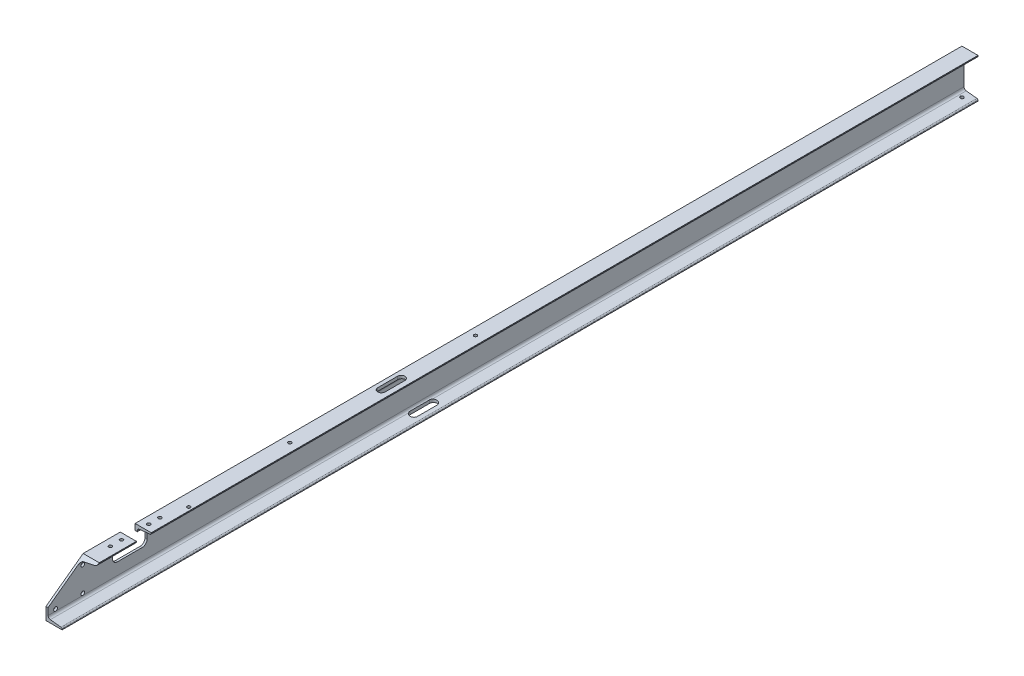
ISO-10303-21;
HEADER;
FILE_DESCRIPTION(('STEP AP214'),'2;1');
FILE_NAME('part.step','',(''),(''),'','','');
FILE_SCHEMA(('AUTOMOTIVE_DESIGN { 1 0 10303 214 1 1 1 1 }'));
ENDSEC;
DATA;
#1=APPLICATION_CONTEXT('core data for automotive mechanical design processes');
#2=APPLICATION_PROTOCOL_DEFINITION('international standard','automotive_design',2000,#1);
#3=PRODUCT_CONTEXT('',#1,'mechanical');
#4=PRODUCT('Part','Part','',(#3));
#5=PRODUCT_RELATED_PRODUCT_CATEGORY('part','',(#4));
#6=PRODUCT_DEFINITION_FORMATION('','',#4);
#7=PRODUCT_DEFINITION_CONTEXT('part definition',#1,'design');
#8=PRODUCT_DEFINITION('design','',#6,#7);
#9=PRODUCT_DEFINITION_SHAPE('','',#8);
#10=(LENGTH_UNIT() NAMED_UNIT(*) SI_UNIT(.MILLI.,.METRE.));
#11=(NAMED_UNIT(*) PLANE_ANGLE_UNIT() SI_UNIT($,.RADIAN.));
#12=(NAMED_UNIT(*) SI_UNIT($,.STERADIAN.) SOLID_ANGLE_UNIT());
#13=UNCERTAINTY_MEASURE_WITH_UNIT(LENGTH_MEASURE(1.E-05),#10,'distance_accuracy_value','');
#14=(GEOMETRIC_REPRESENTATION_CONTEXT(3) GLOBAL_UNCERTAINTY_ASSIGNED_CONTEXT((#13)) GLOBAL_UNIT_ASSIGNED_CONTEXT((#10,
#11,#12)) REPRESENTATION_CONTEXT('',''));
#15=CARTESIAN_POINT('',(0.,0.,0.));
#16=DIRECTION('',(0.,0.,1.));
#17=DIRECTION('',(1.,0.,0.));
#18=AXIS2_PLACEMENT_3D('',#15,#16,#17);
#19=CARTESIAN_POINT('',(65.,80.,1850.));
#20=DIRECTION('',(0.,-1.,0.));
#21=DIRECTION('',(1.,0.,0.));
#22=AXIS2_PLACEMENT_3D('',#19,#20,#21);
#23=PLANE('',#22);
#24=CARTESIAN_POINT('',(29.9999999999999,80.,1575.));
#25=DIRECTION('',(0.,1.,0.));
#26=DIRECTION('',(-1.,0.,0.));
#27=AXIS2_PLACEMENT_3D('',#24,#25,#26);
#28=CIRCLE('',#27,6.49999999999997);
#29=CARTESIAN_POINT('',(23.5,80.,1575.));
#30=VERTEX_POINT('',#29);
#31=EDGE_CURVE('E704',#30,#30,#28,.T.);
#32=ORIENTED_EDGE('',*,*,#31,.F.);
#33=EDGE_LOOP('',(#32));
#34=FACE_BOUND('',#33,.T.);
#35=CARTESIAN_POINT('',(30.,80.,1620.));
#36=DIRECTION('',(0.,1.,0.));
#37=DIRECTION('',(-1.,0.,0.));
#38=AXIS2_PLACEMENT_3D('',#35,#36,#37);
#39=CIRCLE('',#38,6.49999999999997);
#40=CARTESIAN_POINT('',(23.5,80.,1620.));
#41=VERTEX_POINT('',#40);
#42=EDGE_CURVE('E700',#41,#41,#39,.T.);
#43=ORIENTED_EDGE('',*,*,#42,.F.);
#44=EDGE_LOOP('',(#43));
#45=FACE_BOUND('',#44,.T.);
#46=DIRECTION('',(0.,0.,-1.));
#47=VECTOR('',#46,1.);
#48=CARTESIAN_POINT('',(65.,80.,1850.));
#49=LINE('',#48,#47);
#50=CARTESIAN_POINT('',(65.0000000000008,80.,1700.));
#51=VERTEX_POINT('',#50);
#52=CARTESIAN_POINT('',(65.0000000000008,80.,1550.));
#53=VERTEX_POINT('',#52);
#54=EDGE_CURVE('E826',#51,#53,#49,.T.);
#55=ORIENTED_EDGE('',*,*,#54,.T.);
#56=DIRECTION('',(-1.,0.,0.));
#57=VECTOR('',#56,1.);
#58=CARTESIAN_POINT('',(3700.,80.0000000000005,1550.));
#59=LINE('',#58,#57);
#60=CARTESIAN_POINT('',(0.,80.,1550.));
#61=VERTEX_POINT('',#60);
#62=EDGE_CURVE('E923',#53,#61,#59,.T.);
#63=ORIENTED_EDGE('',*,*,#62,.T.);
#64=DIRECTION('',(0.,0.,-1.));
#65=VECTOR('',#64,1.);
#66=CARTESIAN_POINT('',(0.,80.,1850.));
#67=LINE('',#66,#65);
#68=CARTESIAN_POINT('',(0.,80.,1700.));
#69=VERTEX_POINT('',#68);
#70=EDGE_CURVE('E577',#69,#61,#67,.T.);
#71=ORIENTED_EDGE('',*,*,#70,.F.);
#72=DIRECTION('',(-1.,0.,0.));
#73=VECTOR('',#72,1.);
#74=CARTESIAN_POINT('',(3700.,80.0000000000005,1700.));
#75=LINE('',#74,#73);
#76=EDGE_CURVE('E970',#51,#69,#75,.T.);
#77=ORIENTED_EDGE('',*,*,#76,.F.);
#78=EDGE_LOOP('',(#55,#63,#71,#77));
#79=FACE_BOUND('',#78,.T.);
#80=ADVANCED_FACE('F39',(#34,#45,#79),#23,.F.);
#81=CARTESIAN_POINT('',(18.5,58.0057184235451,1850.));
#82=DIRECTION('',(0.,0.,-1.));
#83=DIRECTION('',(-1.,0.,0.));
#84=AXIS2_PLACEMENT_3D('',#81,#82,#83);
#85=CYLINDRICAL_SURFACE('',#84,10.);
#86=DIRECTION('',(0.,0.,-1.));
#87=VECTOR('',#86,1.);
#88=CARTESIAN_POINT('',(8.50000000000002,58.0057184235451,1850.));
#89=LINE('',#88,#87);
#90=CARTESIAN_POINT('',(8.50000000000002,58.0057184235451,1729.99220214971));
#91=VERTEX_POINT('',#90);
#92=CARTESIAN_POINT('',(8.50000000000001,58.0057184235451,1550.));
#93=VERTEX_POINT('',#92);
#94=EDGE_CURVE('E843',#91,#93,#89,.T.);
#95=ORIENTED_EDGE('',*,*,#94,.T.);
#96=CARTESIAN_POINT('',(18.5,58.0057184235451,1550.));
#97=DIRECTION('',(0.,0.,1.));
#98=DIRECTION('',(1.,0.,0.));
#99=AXIS2_PLACEMENT_3D('',#96,#97,#98);
#100=CIRCLE('',#99,10.);
#101=CARTESIAN_POINT('',(17.4439908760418,67.9498043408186,1550.));
#102=VERTEX_POINT('',#101);
#103=EDGE_CURVE('E960',#93,#102,#100,.F.);
#104=ORIENTED_EDGE('',*,*,#103,.T.);
#105=DIRECTION('',(0.,0.,-1.));
#106=VECTOR('',#105,1.);
#107=CARTESIAN_POINT('',(17.4439908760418,67.9498043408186,1850.));
#108=LINE('',#107,#106);
#109=CARTESIAN_POINT('',(17.4439908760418,67.9498043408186,1716.43208498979));
#110=VERTEX_POINT('',#109);
#111=EDGE_CURVE('E839',#110,#102,#108,.T.);
#112=ORIENTED_EDGE('',*,*,#111,.F.);
#113=CARTESIAN_POINT('',(18.5,58.0057184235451,1729.99220214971));
#114=DIRECTION('',(0.,-0.806404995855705,-0.591363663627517));
#115=DIRECTION('',(0.,0.591363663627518,-0.806404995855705));
#116=AXIS2_PLACEMENT_3D('',#113,#114,#115);
#117=ELLIPSE('',#116,16.9100683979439,10.);
#118=EDGE_CURVE('E981',#110,#91,#117,.F.);
#119=ORIENTED_EDGE('',*,*,#118,.T.);
#120=EDGE_LOOP('',(#95,#104,#112,#119));
#121=FACE_BOUND('',#120,.T.);
#122=ADVANCED_FACE('F515',(#121),#85,.F.);
#123=CARTESIAN_POINT('',(17.4439908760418,67.9498043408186,1850.));
#124=DIRECTION('',(-0.105600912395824,0.994408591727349,0.));
#125=DIRECTION('',(-0.994408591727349,-0.105600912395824,0.));
#126=AXIS2_PLACEMENT_3D('',#123,#124,#125);
#127=PLANE('',#126);
#128=CARTESIAN_POINT('',(29.9999999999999,69.283185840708,1575.));
#129=DIRECTION('',(-0.105600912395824,0.994408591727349,0.));
#130=DIRECTION('',(0.994408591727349,0.105600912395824,0.));
#131=AXIS2_PLACEMENT_3D('',#128,#129,#130);
#132=ELLIPSE('',#131,6.53654851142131,6.49999999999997);
#133=CARTESIAN_POINT('',(36.4999999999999,69.9734513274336,1575.));
#134=VERTEX_POINT('',#133);
#135=EDGE_CURVE('E701',#134,#134,#132,.T.);
#136=ORIENTED_EDGE('',*,*,#135,.T.);
#137=EDGE_LOOP('',(#136));
#138=FACE_BOUND('',#137,.T.);
#139=CARTESIAN_POINT('',(30.,69.283185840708,1620.));
#140=DIRECTION('',(-0.105600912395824,0.994408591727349,0.));
#141=DIRECTION('',(0.994408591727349,0.105600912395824,0.));
#142=AXIS2_PLACEMENT_3D('',#139,#140,#141);
#143=ELLIPSE('',#142,6.53654851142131,6.49999999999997);
#144=CARTESIAN_POINT('',(36.4999999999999,69.9734513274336,1620.));
#145=VERTEX_POINT('',#144);
#146=EDGE_CURVE('E696',#145,#145,#143,.T.);
#147=ORIENTED_EDGE('',*,*,#146,.T.);
#148=EDGE_LOOP('',(#147));
#149=FACE_BOUND('',#148,.T.);
#150=ORIENTED_EDGE('',*,*,#111,.T.);
#151=DIRECTION('',(0.994408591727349,0.105600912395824,0.));
#152=VECTOR('',#151,1.);
#153=CARTESIAN_POINT('',(17.4439908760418,67.9498043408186,1550.));
#154=LINE('',#153,#152);
#155=CARTESIAN_POINT('',(60.5280045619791,72.5250978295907,1550.));
#156=VERTEX_POINT('',#155);
#157=EDGE_CURVE('E957',#102,#156,#154,.T.);
#158=ORIENTED_EDGE('',*,*,#157,.T.);
#159=DIRECTION('',(0.,0.,-1.));
#160=VECTOR('',#159,1.);
#161=CARTESIAN_POINT('',(60.5280045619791,72.5250978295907,1850.));
#162=LINE('',#161,#160);
#163=CARTESIAN_POINT('',(60.5280045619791,72.5250978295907,1710.19304841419));
#164=VERTEX_POINT('',#163);
#165=EDGE_CURVE('E835',#164,#156,#162,.T.);
#166=ORIENTED_EDGE('',*,*,#165,.F.);
#167=DIRECTION('',(-0.984256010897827,-0.104522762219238,0.14253103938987));
#168=VECTOR('',#167,1.);
#169=CARTESIAN_POINT('',(-1.29385552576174,65.9599445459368,1719.14553016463));
#170=LINE('',#169,#168);
#171=EDGE_CURVE('E978',#164,#110,#170,.T.);
#172=ORIENTED_EDGE('',*,*,#171,.T.);
#173=EDGE_LOOP('',(#150,#158,#166,#172));
#174=FACE_BOUND('',#173,.T.);
#175=ADVANCED_FACE('F508',(#138,#149,#174),#127,.F.);
#176=CARTESIAN_POINT('',(60.,77.4971407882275,1850.));
#177=DIRECTION('',(0.,0.,-1.));
#178=DIRECTION('',(-1.,0.,0.));
#179=AXIS2_PLACEMENT_3D('',#176,#177,#178);
#180=CYLINDRICAL_SURFACE('',#179,5.);
#181=ORIENTED_EDGE('',*,*,#165,.T.);
#182=CARTESIAN_POINT('',(60.,77.4971407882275,1550.));
#183=DIRECTION('',(0.,0.,1.));
#184=DIRECTION('',(1.,0.,0.));
#185=AXIS2_PLACEMENT_3D('',#182,#183,#184);
#186=CIRCLE('',#185,5.);
#187=CARTESIAN_POINT('',(65.,77.4971407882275,1550.));
#188=VERTEX_POINT('',#187);
#189=EDGE_CURVE('E954',#156,#188,#186,.T.);
#190=ORIENTED_EDGE('',*,*,#189,.T.);
#191=DIRECTION('',(0.,0.,-1.));
#192=VECTOR('',#191,1.);
#193=CARTESIAN_POINT('',(65.,77.4971407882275,1850.));
#194=LINE('',#193,#192);
#195=CARTESIAN_POINT('',(65.,77.4971407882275,1703.41298983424));
#196=VERTEX_POINT('',#195);
#197=EDGE_CURVE('E831',#196,#188,#194,.T.);
#198=ORIENTED_EDGE('',*,*,#197,.F.);
#199=CARTESIAN_POINT('',(60.,77.4971407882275,1703.41298983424));
#200=DIRECTION('',(0.,-0.806404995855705,-0.591363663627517));
#201=DIRECTION('',(0.,0.591363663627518,-0.806404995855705));
#202=AXIS2_PLACEMENT_3D('',#199,#200,#201);
#203=ELLIPSE('',#202,8.45503419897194,5.);
#204=EDGE_CURVE('E975',#196,#164,#203,.T.);
#205=ORIENTED_EDGE('',*,*,#204,.T.);
#206=EDGE_LOOP('',(#181,#190,#198,#205));
#207=FACE_BOUND('',#206,.T.);
#208=ADVANCED_FACE('F505',(#207),#180,.T.);
#209=CARTESIAN_POINT('',(65.,77.4971407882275,1850.));
#210=DIRECTION('',(-1.,0.,0.));
#211=DIRECTION('',(0.,0.,1.));
#212=AXIS2_PLACEMENT_3D('',#209,#210,#211);
#213=PLANE('',#212);
#214=ORIENTED_EDGE('',*,*,#197,.T.);
#215=DIRECTION('',(0.,1.,0.));
#216=VECTOR('',#215,1.);
#217=CARTESIAN_POINT('',(65.,77.4971407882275,1550.));
#218=LINE('',#217,#216);
#219=EDGE_CURVE('E600',#188,#53,#218,.T.);
#220=ORIENTED_EDGE('',*,*,#219,.T.);
#221=ORIENTED_EDGE('',*,*,#54,.F.);
#222=DIRECTION('',(0.,-0.591363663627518,0.806404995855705));
#223=VECTOR('',#222,1.);
#224=CARTESIAN_POINT('',(65.,7.59293073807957,1798.73691262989));
#225=LINE('',#224,#223);
#226=EDGE_CURVE('E972',#51,#196,#225,.T.);
#227=ORIENTED_EDGE('',*,*,#226,.T.);
#228=EDGE_LOOP('',(#214,#220,#221,#227));
#229=FACE_BOUND('',#228,.T.);
#230=ADVANCED_FACE('F501',(#229),#213,.F.);
#231=DIRECTION('',(0.,0.,-1.));
#232=VECTOR('',#231,1.);
#233=CARTESIAN_POINT('',(44.9999999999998,80.,525.));
#234=LINE('',#233,#232);
#235=CARTESIAN_POINT('',(44.9999999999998,80.,525.));
#236=VERTEX_POINT('',#235);
#237=CARTESIAN_POINT('',(44.9999999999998,80.,445.));
#238=VERTEX_POINT('',#237);
#239=EDGE_CURVE('E329',#236,#238,#234,.T.);
#240=ORIENTED_EDGE('',*,*,#239,.F.);
#241=CARTESIAN_POINT('',(29.9999999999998,80.,525.));
#242=DIRECTION('',(0.,1.,0.));
#243=DIRECTION('',(-1.,0.,0.));
#244=AXIS2_PLACEMENT_3D('',#241,#242,#243);
#245=CIRCLE('',#244,15.);
#246=CARTESIAN_POINT('',(14.9999999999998,80.,525.));
#247=VERTEX_POINT('',#246);
#248=EDGE_CURVE('E327',#247,#236,#245,.T.);
#249=ORIENTED_EDGE('',*,*,#248,.F.);
#250=DIRECTION('',(0.,0.,1.));
#251=VECTOR('',#250,1.);
#252=CARTESIAN_POINT('',(14.9999999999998,80.,525.));
#253=LINE('',#252,#251);
#254=CARTESIAN_POINT('',(14.9999999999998,80.,445.));
#255=VERTEX_POINT('',#254);
#256=EDGE_CURVE('E335',#255,#247,#253,.T.);
#257=ORIENTED_EDGE('',*,*,#256,.F.);
#258=CARTESIAN_POINT('',(29.9999999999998,80.,445.));
#259=DIRECTION('',(0.,1.,0.));
#260=DIRECTION('',(-1.,0.,0.));
#261=AXIS2_PLACEMENT_3D('',#258,#259,#260);
#262=CIRCLE('',#261,15.);
#263=EDGE_CURVE('E332',#238,#255,#262,.T.);
#264=ORIENTED_EDGE('',*,*,#263,.F.);
#265=EDGE_LOOP('',(#240,#249,#257,#264));
#266=FACE_BOUND('',#265,.T.);
#267=CARTESIAN_POINT('',(51.0000000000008,80.,1324.));
#268=DIRECTION('',(0.,1.,0.));
#269=DIRECTION('',(-1.,0.,0.));
#270=AXIS2_PLACEMENT_3D('',#267,#268,#269);
#271=CIRCLE('',#270,6.49999999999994);
#272=CARTESIAN_POINT('',(44.5000000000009,80.,1324.));
#273=VERTEX_POINT('',#272);
#274=EDGE_CURVE('E549',#273,#273,#271,.T.);
#275=ORIENTED_EDGE('',*,*,#274,.F.);
#276=EDGE_LOOP('',(#275));
#277=FACE_BOUND('',#276,.T.);
#278=CARTESIAN_POINT('',(29.9999999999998,80.,145.));
#279=DIRECTION('',(0.,1.,0.));
#280=DIRECTION('',(-1.,0.,0.));
#281=AXIS2_PLACEMENT_3D('',#278,#279,#280);
#282=CIRCLE('',#281,6.5);
#283=CARTESIAN_POINT('',(23.4999999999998,80.,145.));
#284=VERTEX_POINT('',#283);
#285=EDGE_CURVE('E553',#284,#284,#282,.T.);
#286=ORIENTED_EDGE('',*,*,#285,.F.);
#287=EDGE_LOOP('',(#286));
#288=FACE_BOUND('',#287,.T.);
#289=CARTESIAN_POINT('',(29.9999999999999,80.,895.));
#290=DIRECTION('',(0.,1.,0.));
#291=DIRECTION('',(-1.,0.,0.));
#292=AXIS2_PLACEMENT_3D('',#289,#290,#291);
#293=CIRCLE('',#292,6.5);
#294=CARTESIAN_POINT('',(23.4999999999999,80.,895.));
#295=VERTEX_POINT('',#294);
#296=EDGE_CURVE('E557',#295,#295,#293,.T.);
#297=ORIENTED_EDGE('',*,*,#296,.F.);
#298=EDGE_LOOP('',(#297));
#299=FACE_BOUND('',#298,.T.);
#300=CARTESIAN_POINT('',(29.9999999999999,80.,1420.));
#301=DIRECTION('',(0.,1.,0.));
#302=DIRECTION('',(-1.,0.,0.));
#303=AXIS2_PLACEMENT_3D('',#300,#301,#302);
#304=CIRCLE('',#303,6.49999999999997);
#305=CARTESIAN_POINT('',(23.5,80.,1420.));
#306=VERTEX_POINT('',#305);
#307=EDGE_CURVE('E561',#306,#306,#304,.T.);
#308=ORIENTED_EDGE('',*,*,#307,.F.);
#309=EDGE_LOOP('',(#308));
#310=FACE_BOUND('',#309,.T.);
#311=CARTESIAN_POINT('',(29.9999999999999,80.,1465.));
#312=DIRECTION('',(0.,1.,0.));
#313=DIRECTION('',(-1.,0.,0.));
#314=AXIS2_PLACEMENT_3D('',#311,#312,#313);
#315=CIRCLE('',#314,6.49999999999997);
#316=CARTESIAN_POINT('',(23.5,80.,1465.));
#317=VERTEX_POINT('',#316);
#318=EDGE_CURVE('E565',#317,#317,#315,.T.);
#319=ORIENTED_EDGE('',*,*,#318,.F.);
#320=EDGE_LOOP('',(#319));
#321=FACE_BOUND('',#320,.T.);
#322=CARTESIAN_POINT('',(0.,80.,1490.));
#323=VERTEX_POINT('',#322);
#324=CARTESIAN_POINT('',(0.,80.,-1850.));
#325=VERTEX_POINT('',#324);
#326=EDGE_CURVE('E569',#323,#325,#67,.T.);
#327=ORIENTED_EDGE('',*,*,#326,.F.);
#328=DIRECTION('',(-1.,0.,0.));
#329=VECTOR('',#328,1.);
#330=CARTESIAN_POINT('',(3700.,80.0000000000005,1490.));
#331=LINE('',#330,#329);
#332=CARTESIAN_POINT('',(65.0000000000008,80.,1490.));
#333=VERTEX_POINT('',#332);
#334=EDGE_CURVE('E570',#333,#323,#331,.T.);
#335=ORIENTED_EDGE('',*,*,#334,.F.);
#336=CARTESIAN_POINT('',(65.,80.,-1850.));
#337=VERTEX_POINT('',#336);
#338=EDGE_CURVE('E830',#333,#337,#49,.T.);
#339=ORIENTED_EDGE('',*,*,#338,.T.);
#340=DIRECTION('',(-1.,0.,0.));
#341=VECTOR('',#340,1.);
#342=CARTESIAN_POINT('',(65.,80.,-1850.));
#343=LINE('',#342,#341);
#344=EDGE_CURVE('E573',#337,#325,#343,.T.);
#345=ORIENTED_EDGE('',*,*,#344,.T.);
#346=EDGE_LOOP('',(#327,#335,#339,#345));
#347=FACE_BOUND('',#346,.T.);
#348=ADVANCED_FACE('F523',(#266,#277,#288,#299,#310,#321,#347),#23,.F.);
#349=CARTESIAN_POINT('',(0.,80.,1850.));
#350=DIRECTION('',(1.,0.,0.));
#351=DIRECTION('',(0.,1.,0.));
#352=AXIS2_PLACEMENT_3D('',#349,#350,#351);
#353=PLANE('',#352);
#354=CARTESIAN_POINT('',(0.,29.,720.));
#355=DIRECTION('',(-1.,0.,0.));
#356=DIRECTION('',(0.,-1.,0.));
#357=AXIS2_PLACEMENT_3D('',#354,#355,#356);
#358=CIRCLE('',#357,6.4999999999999);
#359=CARTESIAN_POINT('',(-4.44089209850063E-13,22.5000000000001,720.));
#360=VERTEX_POINT('',#359);
#361=EDGE_CURVE('E699',#360,#360,#358,.T.);
#362=ORIENTED_EDGE('',*,*,#361,.F.);
#363=EDGE_LOOP('',(#362));
#364=FACE_BOUND('',#363,.T.);
#365=CARTESIAN_POINT('',(0.,29.,920.));
#366=DIRECTION('',(-1.,0.,0.));
#367=DIRECTION('',(0.,-1.,0.));
#368=AXIS2_PLACEMENT_3D('',#365,#366,#367);
#369=CIRCLE('',#368,6.4999999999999);
#370=CARTESIAN_POINT('',(-4.44089209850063E-13,22.5000000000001,920.));
#371=VERTEX_POINT('',#370);
#372=EDGE_CURVE('E647',#371,#371,#369,.T.);
#373=ORIENTED_EDGE('',*,*,#372,.F.);
#374=EDGE_LOOP('',(#373));
#375=FACE_BOUND('',#374,.T.);
#376=CARTESIAN_POINT('',(0.,50.,1710.));
#377=DIRECTION('',(-1.,0.,0.));
#378=DIRECTION('',(0.,-1.,0.));
#379=AXIS2_PLACEMENT_3D('',#376,#377,#378);
#380=CIRCLE('',#379,7.49999999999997);
#381=CARTESIAN_POINT('',(-4.44089209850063E-13,42.5,1710.));
#382=VERTEX_POINT('',#381);
#383=EDGE_CURVE('E643',#382,#382,#380,.T.);
#384=ORIENTED_EDGE('',*,*,#383,.F.);
#385=EDGE_LOOP('',(#384));
#386=FACE_BOUND('',#385,.T.);
#387=CARTESIAN_POINT('',(0.,40.,1617.));
#388=DIRECTION('',(-1.,0.,0.));
#389=DIRECTION('',(0.,-1.,0.));
#390=AXIS2_PLACEMENT_3D('',#387,#388,#389);
#391=CIRCLE('',#390,6.4999999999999);
#392=CARTESIAN_POINT('',(-4.44089209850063E-13,33.5000000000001,1617.));
#393=VERTEX_POINT('',#392);
#394=EDGE_CURVE('E639',#393,#393,#391,.T.);
#395=ORIENTED_EDGE('',*,*,#394,.F.);
#396=EDGE_LOOP('',(#395));
#397=FACE_BOUND('',#396,.T.);
#398=CARTESIAN_POINT('',(0.,40.,1417.));
#399=DIRECTION('',(-1.,0.,0.));
#400=DIRECTION('',(0.,-1.,0.));
#401=AXIS2_PLACEMENT_3D('',#398,#399,#400);
#402=CIRCLE('',#401,6.4999999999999);
#403=CARTESIAN_POINT('',(-4.44089209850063E-13,33.5000000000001,1417.));
#404=VERTEX_POINT('',#403);
#405=EDGE_CURVE('E635',#404,#404,#402,.T.);
#406=ORIENTED_EDGE('',*,*,#405,.F.);
#407=EDGE_LOOP('',(#406));
#408=FACE_BOUND('',#407,.T.);
#409=CARTESIAN_POINT('',(0.,-50.,1710.));
#410=DIRECTION('',(-1.,0.,0.));
#411=DIRECTION('',(0.,-1.,0.));
#412=AXIS2_PLACEMENT_3D('',#409,#410,#411);
#413=CIRCLE('',#412,7.49999999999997);
#414=CARTESIAN_POINT('',(4.44089209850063E-13,-57.5,1710.));
#415=VERTEX_POINT('',#414);
#416=EDGE_CURVE('E597',#415,#415,#413,.T.);
#417=ORIENTED_EDGE('',*,*,#416,.F.);
#418=EDGE_LOOP('',(#417));
#419=FACE_BOUND('',#418,.T.);
#420=CARTESIAN_POINT('',(0.,-50.,1820.));
#421=DIRECTION('',(-1.,0.,0.));
#422=DIRECTION('',(0.,-1.,0.));
#423=AXIS2_PLACEMENT_3D('',#420,#421,#422);
#424=CIRCLE('',#423,7.49999999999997);
#425=CARTESIAN_POINT('',(4.44089209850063E-13,-57.5,1820.));
#426=VERTEX_POINT('',#425);
#427=EDGE_CURVE('E593',#426,#426,#424,.T.);
#428=ORIENTED_EDGE('',*,*,#427,.F.);
#429=EDGE_LOOP('',(#428));
#430=FACE_BOUND('',#429,.T.);
#431=ORIENTED_EDGE('',*,*,#70,.T.);
#432=DIRECTION('',(0.,1.,0.));
#433=VECTOR('',#432,1.);
#434=CARTESIAN_POINT('',(0.,55.,1550.));
#435=LINE('',#434,#433);
#436=CARTESIAN_POINT('',(0.,55.,1550.));
#437=VERTEX_POINT('',#436);
#438=EDGE_CURVE('E921',#437,#61,#435,.T.);
#439=ORIENTED_EDGE('',*,*,#438,.F.);
#440=DIRECTION('',(0.,0.,-1.));
#441=VECTOR('',#440,1.);
#442=CARTESIAN_POINT('',(0.,55.,1570.));
#443=LINE('',#442,#441);
#444=CARTESIAN_POINT('',(0.,55.,1570.));
#445=VERTEX_POINT('',#444);
#446=EDGE_CURVE('E918',#445,#437,#443,.T.);
#447=ORIENTED_EDGE('',*,*,#446,.F.);
#448=CARTESIAN_POINT('',(0.,35.,1570.));
#449=DIRECTION('',(-1.,0.,0.));
#450=DIRECTION('',(0.,-1.,0.));
#451=AXIS2_PLACEMENT_3D('',#448,#449,#450);
#452=CIRCLE('',#451,20.);
#453=CARTESIAN_POINT('',(0.,34.9999999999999,1590.));
#454=VERTEX_POINT('',#453);
#455=EDGE_CURVE('E915',#454,#445,#452,.T.);
#456=ORIENTED_EDGE('',*,*,#455,.F.);
#457=DIRECTION('',(0.,1.,0.));
#458=VECTOR('',#457,1.);
#459=CARTESIAN_POINT('',(0.,10.0000000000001,1590.));
#460=LINE('',#459,#458);
#461=CARTESIAN_POINT('',(0.,10.0000000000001,1590.));
#462=VERTEX_POINT('',#461);
#463=EDGE_CURVE('E912',#462,#454,#460,.T.);
#464=ORIENTED_EDGE('',*,*,#463,.F.);
#465=CARTESIAN_POINT('',(0.,9.99999999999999,1570.));
#466=DIRECTION('',(-1.,0.,0.));
#467=DIRECTION('',(0.,-1.,0.));
#468=AXIS2_PLACEMENT_3D('',#465,#466,#467);
#469=CIRCLE('',#468,20.);
#470=CARTESIAN_POINT('',(0.,-10.,1570.));
#471=VERTEX_POINT('',#470);
#472=EDGE_CURVE('E909',#471,#462,#469,.T.);
#473=ORIENTED_EDGE('',*,*,#472,.F.);
#474=DIRECTION('',(0.,0.,1.));
#475=VECTOR('',#474,1.);
#476=CARTESIAN_POINT('',(0.,-10.,1470.));
#477=LINE('',#476,#475);
#478=CARTESIAN_POINT('',(0.,-10.,1470.));
#479=VERTEX_POINT('',#478);
#480=EDGE_CURVE('E906',#479,#471,#477,.T.);
#481=ORIENTED_EDGE('',*,*,#480,.F.);
#482=CARTESIAN_POINT('',(0.,9.99999999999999,1470.));
#483=DIRECTION('',(-1.,0.,0.));
#484=DIRECTION('',(0.,-1.,0.));
#485=AXIS2_PLACEMENT_3D('',#482,#483,#484);
#486=CIRCLE('',#485,20.);
#487=CARTESIAN_POINT('',(0.,10.0000000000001,1450.));
#488=VERTEX_POINT('',#487);
#489=EDGE_CURVE('E903',#488,#479,#486,.T.);
#490=ORIENTED_EDGE('',*,*,#489,.F.);
#491=DIRECTION('',(0.,-1.,0.));
#492=VECTOR('',#491,1.);
#493=CARTESIAN_POINT('',(0.,34.9999999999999,1450.));
#494=LINE('',#493,#492);
#495=CARTESIAN_POINT('',(0.,34.9999999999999,1450.));
#496=VERTEX_POINT('',#495);
#497=EDGE_CURVE('E900',#496,#488,#494,.T.);
#498=ORIENTED_EDGE('',*,*,#497,.F.);
#499=CARTESIAN_POINT('',(0.,35.,1470.));
#500=DIRECTION('',(-1.,0.,0.));
#501=DIRECTION('',(0.,-1.,0.));
#502=AXIS2_PLACEMENT_3D('',#499,#500,#501);
#503=CIRCLE('',#502,20.);
#504=CARTESIAN_POINT('',(0.,55.,1470.));
#505=VERTEX_POINT('',#504);
#506=EDGE_CURVE('E897',#505,#496,#503,.T.);
#507=ORIENTED_EDGE('',*,*,#506,.F.);
#508=DIRECTION('',(0.,0.,-1.));
#509=VECTOR('',#508,1.);
#510=CARTESIAN_POINT('',(0.,55.,1490.));
#511=LINE('',#510,#509);
#512=CARTESIAN_POINT('',(0.,55.,1490.));
#513=VERTEX_POINT('',#512);
#514=EDGE_CURVE('E894',#513,#505,#511,.T.);
#515=ORIENTED_EDGE('',*,*,#514,.F.);
#516=DIRECTION('',(0.,-1.,0.));
#517=VECTOR('',#516,1.);
#518=CARTESIAN_POINT('',(0.,80.,1490.));
#519=LINE('',#518,#517);
#520=EDGE_CURVE('E634',#323,#513,#519,.T.);
#521=ORIENTED_EDGE('',*,*,#520,.F.);
#522=ORIENTED_EDGE('',*,*,#326,.T.);
#523=DIRECTION('',(0.,-1.,0.));
#524=VECTOR('',#523,1.);
#525=CARTESIAN_POINT('',(0.,80.,-1850.));
#526=LINE('',#525,#524);
#527=CARTESIAN_POINT('',(0.,-80.,-1850.));
#528=VERTEX_POINT('',#527);
#529=EDGE_CURVE('E802',#325,#528,#526,.T.);
#530=ORIENTED_EDGE('',*,*,#529,.T.);
#531=DIRECTION('',(0.,0.,-1.));
#532=VECTOR('',#531,1.);
#533=CARTESIAN_POINT('',(0.,-80.,1850.));
#534=LINE('',#533,#532);
#535=CARTESIAN_POINT('',(0.,-80.,1850.));
#536=VERTEX_POINT('',#535);
#537=EDGE_CURVE('E578',#536,#528,#534,.T.);
#538=ORIENTED_EDGE('',*,*,#537,.F.);
#539=DIRECTION('',(0.,-1.,0.));
#540=VECTOR('',#539,1.);
#541=CARTESIAN_POINT('',(0.,80.,1850.));
#542=LINE('',#541,#540);
#543=CARTESIAN_POINT('',(0.,-30.,1850.));
#544=VERTEX_POINT('',#543);
#545=EDGE_CURVE('E825',#544,#536,#542,.T.);
#546=ORIENTED_EDGE('',*,*,#545,.F.);
#547=DIRECTION('',(0.,-0.591363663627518,0.806404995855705));
#548=VECTOR('',#547,1.);
#549=CARTESIAN_POINT('',(0.,-30.,1850.));
#550=LINE('',#549,#548);
#551=EDGE_CURVE('E592',#69,#544,#550,.T.);
#552=ORIENTED_EDGE('',*,*,#551,.F.);
#553=EDGE_LOOP('',(#431,#439,#447,#456,#464,#473,#481,#490,#498,#507,#515,#521,#522,#530,#538,
#546,#552));
#554=FACE_BOUND('',#553,.T.);
#555=CARTESIAN_POINT('',(0.,29.,520.));
#556=DIRECTION('',(-1.,0.,0.));
#557=DIRECTION('',(0.,-1.,0.));
#558=AXIS2_PLACEMENT_3D('',#555,#556,#557);
#559=CIRCLE('',#558,6.4999999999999);
#560=CARTESIAN_POINT('',(-4.44089209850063E-13,22.5000000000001,520.));
#561=VERTEX_POINT('',#560);
#562=EDGE_CURVE('E630',#561,#561,#559,.T.);
#563=ORIENTED_EDGE('',*,*,#562,.F.);
#564=EDGE_LOOP('',(#563));
#565=FACE_BOUND('',#564,.T.);
#566=CARTESIAN_POINT('',(0.,29.,320.));
#567=DIRECTION('',(-1.,0.,0.));
#568=DIRECTION('',(0.,-1.,0.));
#569=AXIS2_PLACEMENT_3D('',#566,#567,#568);
#570=CIRCLE('',#569,6.4999999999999);
#571=CARTESIAN_POINT('',(-4.44089209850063E-13,22.5000000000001,320.));
#572=VERTEX_POINT('',#571);
#573=EDGE_CURVE('E653',#572,#572,#570,.T.);
#574=ORIENTED_EDGE('',*,*,#573,.F.);
#575=EDGE_LOOP('',(#574));
#576=FACE_BOUND('',#575,.T.);
#577=CARTESIAN_POINT('',(0.,29.,120.));
#578=DIRECTION('',(-1.,0.,0.));
#579=DIRECTION('',(0.,-1.,0.));
#580=AXIS2_PLACEMENT_3D('',#577,#578,#579);
#581=CIRCLE('',#580,6.4999999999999);
#582=CARTESIAN_POINT('',(-4.44089209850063E-13,22.5000000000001,120.));
#583=VERTEX_POINT('',#582);
#584=EDGE_CURVE('E659',#583,#583,#581,.T.);
#585=ORIENTED_EDGE('',*,*,#584,.F.);
#586=EDGE_LOOP('',(#585));
#587=FACE_BOUND('',#586,.T.);
#588=CARTESIAN_POINT('',(0.,29.,-80.0000000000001));
#589=DIRECTION('',(-1.,0.,0.));
#590=DIRECTION('',(0.,-1.,0.));
#591=AXIS2_PLACEMENT_3D('',#588,#589,#590);
#592=CIRCLE('',#591,6.4999999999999);
#593=CARTESIAN_POINT('',(4.44089209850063E-13,22.5000000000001,-80.0000000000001));
#594=VERTEX_POINT('',#593);
#595=EDGE_CURVE('E665',#594,#594,#592,.T.);
#596=ORIENTED_EDGE('',*,*,#595,.F.);
#597=EDGE_LOOP('',(#596));
#598=FACE_BOUND('',#597,.T.);
#599=CARTESIAN_POINT('',(0.,29.,-280.));
#600=DIRECTION('',(-1.,0.,0.));
#601=DIRECTION('',(0.,-1.,0.));
#602=AXIS2_PLACEMENT_3D('',#599,#600,#601);
#603=CIRCLE('',#602,6.4999999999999);
#604=CARTESIAN_POINT('',(4.44089209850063E-13,22.5000000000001,-280.));
#605=VERTEX_POINT('',#604);
#606=EDGE_CURVE('E671',#605,#605,#603,.T.);
#607=ORIENTED_EDGE('',*,*,#606,.F.);
#608=EDGE_LOOP('',(#607));
#609=FACE_BOUND('',#608,.T.);
#610=CARTESIAN_POINT('',(0.,29.,-480.));
#611=DIRECTION('',(-1.,0.,0.));
#612=DIRECTION('',(0.,-1.,0.));
#613=AXIS2_PLACEMENT_3D('',#610,#611,#612);
#614=CIRCLE('',#613,6.4999999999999);
#615=CARTESIAN_POINT('',(4.44089209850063E-13,22.5000000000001,-480.));
#616=VERTEX_POINT('',#615);
#617=EDGE_CURVE('E677',#616,#616,#614,.T.);
#618=ORIENTED_EDGE('',*,*,#617,.F.);
#619=EDGE_LOOP('',(#618));
#620=FACE_BOUND('',#619,.T.);
#621=CARTESIAN_POINT('',(0.,29.,-680.));
#622=DIRECTION('',(-1.,0.,0.));
#623=DIRECTION('',(0.,-1.,0.));
#624=AXIS2_PLACEMENT_3D('',#621,#622,#623);
#625=CIRCLE('',#624,6.4999999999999);
#626=CARTESIAN_POINT('',(4.44089209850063E-13,22.5000000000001,-680.));
#627=VERTEX_POINT('',#626);
#628=EDGE_CURVE('E683',#627,#627,#625,.T.);
#629=ORIENTED_EDGE('',*,*,#628,.F.);
#630=EDGE_LOOP('',(#629));
#631=FACE_BOUND('',#630,.T.);
#632=CARTESIAN_POINT('',(0.,29.,-880.));
#633=DIRECTION('',(-1.,0.,0.));
#634=DIRECTION('',(0.,-1.,0.));
#635=AXIS2_PLACEMENT_3D('',#632,#633,#634);
#636=CIRCLE('',#635,6.4999999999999);
#637=CARTESIAN_POINT('',(4.44089209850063E-13,22.5000000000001,-880.));
#638=VERTEX_POINT('',#637);
#639=EDGE_CURVE('E689',#638,#638,#636,.T.);
#640=ORIENTED_EDGE('',*,*,#639,.F.);
#641=EDGE_LOOP('',(#640));
#642=FACE_BOUND('',#641,.T.);
#643=ADVANCED_FACE('F534',(#364,#375,#386,#397,#408,#419,#430,#554,#565,#576,#587,#598,#609,
#620,#631,#642),#353,.F.);
#644=CARTESIAN_POINT('',(0.,-80.,1850.));
#645=DIRECTION('',(0.,1.,0.));
#646=DIRECTION('',(0.,0.,1.));
#647=AXIS2_PLACEMENT_3D('',#644,#645,#646);
#648=PLANE('',#647);
#649=CARTESIAN_POINT('',(30.,-80.,-1820.));
#650=DIRECTION('',(0.,-1.,0.));
#651=DIRECTION('',(0.,0.,-1.));
#652=AXIS2_PLACEMENT_3D('',#649,#650,#651);
#653=CIRCLE('',#652,6.49999999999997);
#654=CARTESIAN_POINT('',(30.,-80.,-1826.5));
#655=VERTEX_POINT('',#654);
#656=EDGE_CURVE('E314',#655,#655,#653,.T.);
#657=ORIENTED_EDGE('',*,*,#656,.F.);
#658=EDGE_LOOP('',(#657));
#659=FACE_BOUND('',#658,.T.);
#660=DIRECTION('',(0.,0.,1.));
#661=VECTOR('',#660,1.);
#662=CARTESIAN_POINT('',(14.9999999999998,-80.,395.));
#663=LINE('',#662,#661);
#664=CARTESIAN_POINT('',(14.9999999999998,-80.,315.));
#665=VERTEX_POINT('',#664);
#666=CARTESIAN_POINT('',(14.9999999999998,-80.,395.));
#667=VERTEX_POINT('',#666);
#668=EDGE_CURVE('E302',#665,#667,#663,.T.);
#669=ORIENTED_EDGE('',*,*,#668,.T.);
#670=CARTESIAN_POINT('',(29.9999999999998,-80.,395.));
#671=DIRECTION('',(0.,1.,0.));
#672=DIRECTION('',(-1.,0.,0.));
#673=AXIS2_PLACEMENT_3D('',#670,#671,#672);
#674=CIRCLE('',#673,15.);
#675=CARTESIAN_POINT('',(44.9999999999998,-80.,395.));
#676=VERTEX_POINT('',#675);
#677=EDGE_CURVE('E296',#667,#676,#674,.T.);
#678=ORIENTED_EDGE('',*,*,#677,.T.);
#679=DIRECTION('',(0.,0.,-1.));
#680=VECTOR('',#679,1.);
#681=CARTESIAN_POINT('',(44.9999999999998,-80.,395.));
#682=LINE('',#681,#680);
#683=CARTESIAN_POINT('',(44.9999999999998,-80.,315.));
#684=VERTEX_POINT('',#683);
#685=EDGE_CURVE('E305',#676,#684,#682,.T.);
#686=ORIENTED_EDGE('',*,*,#685,.T.);
#687=CARTESIAN_POINT('',(29.9999999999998,-80.,315.));
#688=DIRECTION('',(0.,1.,0.));
#689=DIRECTION('',(-1.,0.,0.));
#690=AXIS2_PLACEMENT_3D('',#687,#688,#689);
#691=CIRCLE('',#690,15.);
#692=EDGE_CURVE('E55',#684,#665,#691,.T.);
#693=ORIENTED_EDGE('',*,*,#692,.T.);
#694=EDGE_LOOP('',(#669,#678,#686,#693));
#695=FACE_BOUND('',#694,.T.);
#696=DIRECTION('',(1.,0.,0.));
#697=VECTOR('',#696,1.);
#698=CARTESIAN_POINT('',(0.,-80.,-1850.));
#699=LINE('',#698,#697);
#700=CARTESIAN_POINT('',(65.,-80.,-1850.));
#701=VERTEX_POINT('',#700);
#702=EDGE_CURVE('E796',#528,#701,#699,.T.);
#703=ORIENTED_EDGE('',*,*,#702,.T.);
#704=DIRECTION('',(0.,0.,-1.));
#705=VECTOR('',#704,1.);
#706=CARTESIAN_POINT('',(65.,-80.,1850.));
#707=LINE('',#706,#705);
#708=CARTESIAN_POINT('',(65.,-80.,1850.));
#709=VERTEX_POINT('',#708);
#710=EDGE_CURVE('E583',#709,#701,#707,.T.);
#711=ORIENTED_EDGE('',*,*,#710,.F.);
#712=DIRECTION('',(1.,0.,0.));
#713=VECTOR('',#712,1.);
#714=CARTESIAN_POINT('',(0.,-80.,1850.));
#715=LINE('',#714,#713);
#716=EDGE_CURVE('E987',#536,#709,#715,.T.);
#717=ORIENTED_EDGE('',*,*,#716,.F.);
#718=ORIENTED_EDGE('',*,*,#537,.T.);
#719=EDGE_LOOP('',(#703,#711,#717,#718));
#720=FACE_BOUND('',#719,.T.);
#721=ADVANCED_FACE('F309',(#659,#695,#720),#648,.F.);
#722=CARTESIAN_POINT('',(65.,-80.,1850.));
#723=DIRECTION('',(-1.,0.,0.));
#724=DIRECTION('',(0.,-1.,0.));
#725=AXIS2_PLACEMENT_3D('',#722,#723,#724);
#726=PLANE('',#725);
#727=DIRECTION('',(0.,1.,0.));
#728=VECTOR('',#727,1.);
#729=CARTESIAN_POINT('',(65.,-80.,-1850.));
#730=LINE('',#729,#728);
#731=CARTESIAN_POINT('',(65.,-77.4971407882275,-1850.));
#732=VERTEX_POINT('',#731);
#733=EDGE_CURVE('E791',#701,#732,#730,.T.);
#734=ORIENTED_EDGE('',*,*,#733,.T.);
#735=DIRECTION('',(0.,0.,-1.));
#736=VECTOR('',#735,1.);
#737=CARTESIAN_POINT('',(65.,-77.4971407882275,1850.));
#738=LINE('',#737,#736);
#739=CARTESIAN_POINT('',(65.,-77.4971407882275,1850.));
#740=VERTEX_POINT('',#739);
#741=EDGE_CURVE('E777',#740,#732,#738,.T.);
#742=ORIENTED_EDGE('',*,*,#741,.F.);
#743=DIRECTION('',(0.,1.,0.));
#744=VECTOR('',#743,1.);
#745=CARTESIAN_POINT('',(65.,-80.,1850.));
#746=LINE('',#745,#744);
#747=EDGE_CURVE('E792',#709,#740,#746,.T.);
#748=ORIENTED_EDGE('',*,*,#747,.F.);
#749=ORIENTED_EDGE('',*,*,#710,.T.);
#750=EDGE_LOOP('',(#734,#742,#748,#749));
#751=FACE_BOUND('',#750,.T.);
#752=ADVANCED_FACE('F789',(#751),#726,.F.);
#753=CARTESIAN_POINT('',(60.,-77.4971407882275,1850.));
#754=DIRECTION('',(0.,0.,-1.));
#755=DIRECTION('',(-1.,0.,0.));
#756=AXIS2_PLACEMENT_3D('',#753,#754,#755);
#757=CYLINDRICAL_SURFACE('',#756,5.00000000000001);
#758=CARTESIAN_POINT('',(60.,-77.4971407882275,-1850.));
#759=DIRECTION('',(0.,0.,1.));
#760=DIRECTION('',(1.,0.,0.));
#761=AXIS2_PLACEMENT_3D('',#758,#759,#760);
#762=CIRCLE('',#761,5.00000000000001);
#763=CARTESIAN_POINT('',(60.5280045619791,-72.5250978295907,-1850.));
#764=VERTEX_POINT('',#763);
#765=EDGE_CURVE('E798',#732,#764,#762,.T.);
#766=ORIENTED_EDGE('',*,*,#765,.T.);
#767=DIRECTION('',(0.,0.,-1.));
#768=VECTOR('',#767,1.);
#769=CARTESIAN_POINT('',(60.5280045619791,-72.5250978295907,1850.));
#770=LINE('',#769,#768);
#771=CARTESIAN_POINT('',(60.5280045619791,-72.5250978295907,1850.));
#772=VERTEX_POINT('',#771);
#773=EDGE_CURVE('E773',#772,#764,#770,.T.);
#774=ORIENTED_EDGE('',*,*,#773,.F.);
#775=CARTESIAN_POINT('',(60.,-77.4971407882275,1850.));
#776=DIRECTION('',(0.,0.,1.));
#777=DIRECTION('',(1.,0.,0.));
#778=AXIS2_PLACEMENT_3D('',#775,#776,#777);
#779=CIRCLE('',#778,5.00000000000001);
#780=EDGE_CURVE('E990',#740,#772,#779,.T.);
#781=ORIENTED_EDGE('',*,*,#780,.F.);
#782=ORIENTED_EDGE('',*,*,#741,.T.);
#783=EDGE_LOOP('',(#766,#774,#781,#782));
#784=FACE_BOUND('',#783,.T.);
#785=ADVANCED_FACE('F1036',(#784),#757,.T.);
#786=CARTESIAN_POINT('',(60.5280045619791,-72.5250978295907,1850.));
#787=DIRECTION('',(-0.105600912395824,-0.994408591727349,0.));
#788=DIRECTION('',(0.994408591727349,-0.105600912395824,0.));
#789=AXIS2_PLACEMENT_3D('',#786,#787,#788);
#790=PLANE('',#789);
#791=CARTESIAN_POINT('',(30.,-69.283185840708,-1820.));
#792=DIRECTION('',(-0.105600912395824,-0.994408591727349,0.));
#793=DIRECTION('',(0.994408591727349,-0.105600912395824,0.));
#794=AXIS2_PLACEMENT_3D('',#791,#792,#793);
#795=ELLIPSE('',#794,6.53654851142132,6.49999999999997);
#796=CARTESIAN_POINT('',(36.5,-69.9734513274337,-1820.));
#797=VERTEX_POINT('',#796);
#798=EDGE_CURVE('E43',#797,#797,#795,.T.);
#799=ORIENTED_EDGE('',*,*,#798,.T.);
#800=EDGE_LOOP('',(#799));
#801=FACE_BOUND('',#800,.T.);
#802=DIRECTION('',(0.,0.,1.));
#803=VECTOR('',#802,1.);
#804=CARTESIAN_POINT('',(44.9999999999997,-70.8761061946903,1850.));
#805=LINE('',#804,#803);
#806=CARTESIAN_POINT('',(44.9999999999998,-70.8761061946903,315.));
#807=VERTEX_POINT('',#806);
#808=CARTESIAN_POINT('',(44.9999999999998,-70.8761061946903,395.));
#809=VERTEX_POINT('',#808);
#810=EDGE_CURVE('E11',#807,#809,#805,.T.);
#811=ORIENTED_EDGE('',*,*,#810,.T.);
#812=CARTESIAN_POINT('',(29.9999999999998,-69.283185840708,395.));
#813=DIRECTION('',(-0.105600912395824,-0.994408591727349,0.));
#814=DIRECTION('',(-0.994408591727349,0.105600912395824,0.));
#815=AXIS2_PLACEMENT_3D('',#812,#813,#814);
#816=ELLIPSE('',#815,15.0843427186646,15.);
#817=CARTESIAN_POINT('',(17.4439908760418,-67.9498043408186,403.20649955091));
#818=VERTEX_POINT('',#817);
#819=EDGE_CURVE('E299',#809,#818,#816,.T.);
#820=ORIENTED_EDGE('',*,*,#819,.T.);
#821=DIRECTION('',(0.,0.,-1.));
#822=VECTOR('',#821,1.);
#823=CARTESIAN_POINT('',(17.4439908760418,-67.9498043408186,1850.));
#824=LINE('',#823,#822);
#825=CARTESIAN_POINT('',(17.4439908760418,-67.9498043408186,1850.));
#826=VERTEX_POINT('',#825);
#827=EDGE_CURVE('E769',#826,#818,#824,.T.);
#828=ORIENTED_EDGE('',*,*,#827,.F.);
#829=DIRECTION('',(-0.994408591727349,0.105600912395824,0.));
#830=VECTOR('',#829,1.);
#831=CARTESIAN_POINT('',(60.5280045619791,-72.5250978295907,1850.));
#832=LINE('',#831,#830);
#833=EDGE_CURVE('E992',#772,#826,#832,.T.);
#834=ORIENTED_EDGE('',*,*,#833,.F.);
#835=ORIENTED_EDGE('',*,*,#773,.T.);
#836=DIRECTION('',(-0.994408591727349,0.105600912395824,0.));
#837=VECTOR('',#836,1.);
#838=CARTESIAN_POINT('',(60.5280045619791,-72.5250978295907,-1850.));
#839=LINE('',#838,#837);
#840=CARTESIAN_POINT('',(17.4439908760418,-67.9498043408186,-1850.));
#841=VERTEX_POINT('',#840);
#842=EDGE_CURVE('E800',#764,#841,#839,.T.);
#843=ORIENTED_EDGE('',*,*,#842,.T.);
#844=CARTESIAN_POINT('',(17.4439908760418,-67.9498043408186,306.79350044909));
#845=VERTEX_POINT('',#844);
#846=EDGE_CURVE('E774',#845,#841,#824,.T.);
#847=ORIENTED_EDGE('',*,*,#846,.F.);
#848=CARTESIAN_POINT('',(29.9999999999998,-69.283185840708,315.));
#849=DIRECTION('',(-0.105600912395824,-0.994408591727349,0.));
#850=DIRECTION('',(-0.994408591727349,0.105600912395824,0.));
#851=AXIS2_PLACEMENT_3D('',#848,#849,#850);
#852=ELLIPSE('',#851,15.0843427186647,15.);
#853=EDGE_CURVE('E61',#845,#807,#852,.T.);
#854=ORIENTED_EDGE('',*,*,#853,.T.);
#855=EDGE_LOOP('',(#811,#820,#828,#834,#835,#843,#847,#854));
#856=FACE_BOUND('',#855,.T.);
#857=ADVANCED_FACE('F767',(#801,#856),#790,.F.);
#858=CARTESIAN_POINT('',(18.5,-58.0057184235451,1850.));
#859=DIRECTION('',(0.,0.,-1.));
#860=DIRECTION('',(-1.,0.,0.));
#861=AXIS2_PLACEMENT_3D('',#858,#859,#860);
#862=CYLINDRICAL_SURFACE('',#861,10.);
#863=ORIENTED_EDGE('',*,*,#827,.T.);
#864=CARTESIAN_POINT('',(17.4439908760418,-67.9498043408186,403.20649955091));
#865=CARTESIAN_POINT('',(17.3265069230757,-67.9373238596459,403.026746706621));
#866=CARTESIAN_POINT('',(17.2129567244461,-67.9231647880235,402.844585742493));
#867=CARTESIAN_POINT('',(16.9938712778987,-67.8922663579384,402.475736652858));
#868=CARTESIAN_POINT('',(16.8883354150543,-67.8755271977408,402.289048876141));
#869=CARTESIAN_POINT('',(16.5839665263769,-67.822605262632,401.72262827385));
#870=CARTESIAN_POINT('',(16.397346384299,-67.7837149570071,401.336498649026));
#871=CARTESIAN_POINT('',(16.0620598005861,-67.7054790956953,400.559542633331));
#872=CARTESIAN_POINT('',(15.9125749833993,-67.6661680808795,400.169063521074));
#873=CARTESIAN_POINT('',(15.6466524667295,-67.5909954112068,399.376744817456));
#874=CARTESIAN_POINT('',(15.5302051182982,-67.5551327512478,398.974908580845));
#875=CARTESIAN_POINT('',(15.3600063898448,-67.5002385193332,398.280079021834));
#876=CARTESIAN_POINT('',(15.297864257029,-67.4793402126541,397.989260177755));
#877=CARTESIAN_POINT('',(15.1909375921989,-67.442524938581,397.404178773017));
#878=CARTESIAN_POINT('',(15.1461496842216,-67.4266070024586,397.109916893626));
#879=CARTESIAN_POINT('',(15.07350388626,-67.4004324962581,396.513754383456));
#880=CARTESIAN_POINT('',(15.0459586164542,-67.3902807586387,396.211810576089));
#881=CARTESIAN_POINT('',(15.0183934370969,-67.3800716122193,395.757935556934));
#882=CARTESIAN_POINT('',(15.0114971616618,-67.3775049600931,395.606447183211));
#883=CARTESIAN_POINT('',(15.0023002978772,-67.3740752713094,395.303309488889));
#884=CARTESIAN_POINT('',(14.9999997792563,-67.3732122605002,395.151660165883));
#885=CARTESIAN_POINT('',(14.9999999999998,-67.3732154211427,395.));
#886=B_SPLINE_CURVE_WITH_KNOTS('',3,(#864,#865,#866,#867,#868,#869,#870,#871,#872,#873,#874,
#875,#876,#877,#878,#879,#880,#881,#882,#883,#884,#885),.UNSPECIFIED.,.F.,.F.,(4,2,2,2,2,2,2,2,
2,2,4),(0.,0.645182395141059,1.29031523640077,2.58043947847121,3.83893200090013,
5.09705658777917,5.99088800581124,6.88454545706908,7.79396886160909,8.24890104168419,
8.70384012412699),.UNSPECIFIED.);
#887=CARTESIAN_POINT('',(14.9999999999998,-67.3732154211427,395.));
#888=VERTEX_POINT('',#887);
#889=EDGE_CURVE('E48',#818,#888,#886,.T.);
#890=ORIENTED_EDGE('',*,*,#889,.T.);
#891=DIRECTION('',(0.,0.,-1.));
#892=VECTOR('',#891,1.);
#893=CARTESIAN_POINT('',(15.,-67.3732154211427,1850.));
#894=LINE('',#893,#892);
#895=CARTESIAN_POINT('',(14.9999999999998,-67.3732154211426,315.));
#896=VERTEX_POINT('',#895);
#897=EDGE_CURVE('E739',#888,#896,#894,.T.);
#898=ORIENTED_EDGE('',*,*,#897,.T.);
#899=CARTESIAN_POINT('',(14.9999999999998,-67.3732154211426,315.));
#900=CARTESIAN_POINT('',(14.9999956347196,-67.3731973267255,314.784530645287));
#901=CARTESIAN_POINT('',(15.0046426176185,-67.3749496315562,314.569065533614));
#902=CARTESIAN_POINT('',(15.0232058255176,-67.3818627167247,314.138598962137));
#903=CARTESIAN_POINT('',(15.0371216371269,-67.3870233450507,313.923597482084));
#904=CARTESIAN_POINT('',(15.0741809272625,-67.4006177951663,313.494588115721));
#905=CARTESIAN_POINT('',(15.0973203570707,-67.409050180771,313.280579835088));
#906=CARTESIAN_POINT('',(15.1527581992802,-67.4289253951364,312.853909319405));
#907=CARTESIAN_POINT('',(15.1850566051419,-67.4403682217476,312.641247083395));
#908=CARTESIAN_POINT('',(15.2938056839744,-67.4781108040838,312.016075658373));
#909=CARTESIAN_POINT('',(15.3830260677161,-67.5081872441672,311.605943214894));
#910=CARTESIAN_POINT('',(15.5953014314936,-67.5752044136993,310.795206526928));
#911=CARTESIAN_POINT('',(15.7183527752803,-67.6121444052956,310.394601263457));
#912=CARTESIAN_POINT('',(15.9565599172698,-67.6773958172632,309.72084482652));
#913=CARTESIAN_POINT('',(16.0634932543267,-67.7050698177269,309.444694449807));
#914=CARTESIAN_POINT('',(16.2935015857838,-67.7599657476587,308.899222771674));
#915=CARTESIAN_POINT('',(16.4165724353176,-67.7871877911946,308.629899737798));
#916=CARTESIAN_POINT('',(16.6808279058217,-67.8397970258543,308.094176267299));
#917=CARTESIAN_POINT('',(16.822291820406,-67.865143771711,307.827909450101));
#918=CARTESIAN_POINT('',(17.1212379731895,-67.9113630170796,307.303991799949));
#919=CARTESIAN_POINT('',(17.2787264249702,-67.9322337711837,307.046344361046));
#920=CARTESIAN_POINT('',(17.4439908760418,-67.9498043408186,306.79350044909));
#921=B_SPLINE_CURVE_WITH_KNOTS('',3,(#899,#900,#901,#902,#903,#904,#905,#906,#907,#908,#909,
#910,#911,#912,#913,#914,#915,#916,#917,#918,#919,#920),.UNSPECIFIED.,.F.,.F.,(4,2,2,2,2,2,2,2,
2,2,4),(0.,0.646343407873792,1.29265799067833,1.93868918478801,2.58471991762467,3.845439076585,
5.10602278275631,5.99780518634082,6.88935898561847,7.79651452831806,8.70402317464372),.UNSPECIFIED.);
#922=EDGE_CURVE('E731',#896,#845,#921,.T.);
#923=ORIENTED_EDGE('',*,*,#922,.T.);
#924=ORIENTED_EDGE('',*,*,#846,.T.);
#925=CARTESIAN_POINT('',(18.5,-58.0057184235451,-1850.));
#926=DIRECTION('',(0.,0.,-1.));
#927=DIRECTION('',(-1.,0.,0.));
#928=AXIS2_PLACEMENT_3D('',#925,#926,#927);
#929=CIRCLE('',#928,10.);
#930=CARTESIAN_POINT('',(8.50000000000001,-58.0057184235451,-1850.));
#931=VERTEX_POINT('',#930);
#932=EDGE_CURVE('E808',#841,#931,#929,.T.);
#933=ORIENTED_EDGE('',*,*,#932,.T.);
#934=DIRECTION('',(0.,0.,-1.));
#935=VECTOR('',#934,1.);
#936=CARTESIAN_POINT('',(8.50000000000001,-58.0057184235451,1850.));
#937=LINE('',#936,#935);
#938=CARTESIAN_POINT('',(8.50000000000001,-58.0057184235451,1850.));
#939=VERTEX_POINT('',#938);
#940=EDGE_CURVE('E779',#939,#931,#937,.T.);
#941=ORIENTED_EDGE('',*,*,#940,.F.);
#942=CARTESIAN_POINT('',(18.5,-58.0057184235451,1850.));
#943=DIRECTION('',(0.,0.,-1.));
#944=DIRECTION('',(-1.,0.,0.));
#945=AXIS2_PLACEMENT_3D('',#942,#943,#944);
#946=CIRCLE('',#945,10.);
#947=EDGE_CURVE('E772',#826,#939,#946,.T.);
#948=ORIENTED_EDGE('',*,*,#947,.F.);
#949=EDGE_LOOP('',(#863,#890,#898,#923,#924,#933,#941,#948));
#950=FACE_BOUND('',#949,.T.);
#951=ADVANCED_FACE('F741',(#950),#862,.F.);
#952=CARTESIAN_POINT('',(8.50000000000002,-58.0057184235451,1850.));
#953=DIRECTION('',(-1.,0.,0.));
#954=DIRECTION('',(0.,-1.,0.));
#955=AXIS2_PLACEMENT_3D('',#952,#953,#954);
#956=PLANE('',#955);
#957=CARTESIAN_POINT('',(8.50000000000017,29.,720.));
#958=DIRECTION('',(-1.,0.,0.));
#959=DIRECTION('',(0.,-1.,0.));
#960=AXIS2_PLACEMENT_3D('',#957,#958,#959);
#961=CIRCLE('',#960,6.4999999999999);
#962=CARTESIAN_POINT('',(8.50000000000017,22.5000000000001,720.));
#963=VERTEX_POINT('',#962);
#964=EDGE_CURVE('E881',#963,#963,#961,.T.);
#965=ORIENTED_EDGE('',*,*,#964,.T.);
#966=EDGE_LOOP('',(#965));
#967=FACE_BOUND('',#966,.T.);
#968=CARTESIAN_POINT('',(8.50000000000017,29.,920.));
#969=DIRECTION('',(-1.,0.,0.));
#970=DIRECTION('',(0.,-1.,0.));
#971=AXIS2_PLACEMENT_3D('',#968,#969,#970);
#972=CIRCLE('',#971,6.4999999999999);
#973=CARTESIAN_POINT('',(8.50000000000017,22.5000000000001,920.));
#974=VERTEX_POINT('',#973);
#975=EDGE_CURVE('E644',#974,#974,#972,.T.);
#976=ORIENTED_EDGE('',*,*,#975,.T.);
#977=EDGE_LOOP('',(#976));
#978=FACE_BOUND('',#977,.T.);
#979=CARTESIAN_POINT('',(8.50000000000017,50.,1710.));
#980=DIRECTION('',(-1.,0.,0.));
#981=DIRECTION('',(0.,-1.,0.));
#982=AXIS2_PLACEMENT_3D('',#979,#980,#981);
#983=CIRCLE('',#982,7.49999999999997);
#984=CARTESIAN_POINT('',(8.50000000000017,42.5,1710.));
#985=VERTEX_POINT('',#984);
#986=EDGE_CURVE('E640',#985,#985,#983,.T.);
#987=ORIENTED_EDGE('',*,*,#986,.T.);
#988=EDGE_LOOP('',(#987));
#989=FACE_BOUND('',#988,.T.);
#990=CARTESIAN_POINT('',(8.50000000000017,40.,1617.));
#991=DIRECTION('',(-1.,0.,0.));
#992=DIRECTION('',(0.,-1.,0.));
#993=AXIS2_PLACEMENT_3D('',#990,#991,#992);
#994=CIRCLE('',#993,6.4999999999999);
#995=CARTESIAN_POINT('',(8.50000000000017,33.5000000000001,1617.));
#996=VERTEX_POINT('',#995);
#997=EDGE_CURVE('E636',#996,#996,#994,.T.);
#998=ORIENTED_EDGE('',*,*,#997,.T.);
#999=EDGE_LOOP('',(#998));
#1000=FACE_BOUND('',#999,.T.);
#1001=CARTESIAN_POINT('',(8.50000000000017,40.,1417.));
#1002=DIRECTION('',(-1.,0.,0.));
#1003=DIRECTION('',(0.,-1.,0.));
#1004=AXIS2_PLACEMENT_3D('',#1001,#1002,#1003);
#1005=CIRCLE('',#1004,6.4999999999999);
#1006=CARTESIAN_POINT('',(8.50000000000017,33.5000000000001,1417.));
#1007=VERTEX_POINT('',#1006);
#1008=EDGE_CURVE('E631',#1007,#1007,#1005,.T.);
#1009=ORIENTED_EDGE('',*,*,#1008,.T.);
#1010=EDGE_LOOP('',(#1009));
#1011=FACE_BOUND('',#1010,.T.);
#1012=CARTESIAN_POINT('',(8.50000000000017,-50.,1710.));
#1013=DIRECTION('',(-1.,0.,0.));
#1014=DIRECTION('',(0.,-1.,0.));
#1015=AXIS2_PLACEMENT_3D('',#1012,#1013,#1014);
#1016=CIRCLE('',#1015,7.49999999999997);
#1017=CARTESIAN_POINT('',(8.50000000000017,-57.5,1710.));
#1018=VERTEX_POINT('',#1017);
#1019=EDGE_CURVE('E594',#1018,#1018,#1016,.T.);
#1020=ORIENTED_EDGE('',*,*,#1019,.T.);
#1021=EDGE_LOOP('',(#1020));
#1022=FACE_BOUND('',#1021,.T.);
#1023=CARTESIAN_POINT('',(8.50000000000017,-50.,1820.));
#1024=DIRECTION('',(-1.,0.,0.));
#1025=DIRECTION('',(0.,-1.,0.));
#1026=AXIS2_PLACEMENT_3D('',#1023,#1024,#1025);
#1027=CIRCLE('',#1026,7.49999999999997);
#1028=CARTESIAN_POINT('',(8.50000000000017,-57.5,1820.));
#1029=VERTEX_POINT('',#1028);
#1030=EDGE_CURVE('E589',#1029,#1029,#1027,.T.);
#1031=ORIENTED_EDGE('',*,*,#1030,.T.);
#1032=EDGE_LOOP('',(#1031));
#1033=FACE_BOUND('',#1032,.T.);
#1034=DIRECTION('',(0.,0.,-1.));
#1035=VECTOR('',#1034,1.);
#1036=CARTESIAN_POINT('',(8.50000000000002,55.0000000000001,1850.));
#1037=LINE('',#1036,#1035);
#1038=CARTESIAN_POINT('',(8.50000000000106,55.,1570.));
#1039=VERTEX_POINT('',#1038);
#1040=CARTESIAN_POINT('',(8.50000000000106,55.,1550.));
#1041=VERTEX_POINT('',#1040);
#1042=EDGE_CURVE('E627',#1039,#1041,#1037,.T.);
#1043=ORIENTED_EDGE('',*,*,#1042,.T.);
#1044=DIRECTION('',(0.,1.,0.));
#1045=VECTOR('',#1044,1.);
#1046=CARTESIAN_POINT('',(8.50000000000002,-58.0057184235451,1550.));
#1047=LINE('',#1046,#1045);
#1048=EDGE_CURVE('E962',#1041,#93,#1047,.T.);
#1049=ORIENTED_EDGE('',*,*,#1048,.T.);
#1050=ORIENTED_EDGE('',*,*,#94,.F.);
#1051=DIRECTION('',(0.,-0.591363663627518,0.806404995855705));
#1052=VECTOR('',#1051,1.);
#1053=CARTESIAN_POINT('',(8.50000000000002,-39.7939073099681,1863.35532814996));
#1054=LINE('',#1053,#1052);
#1055=CARTESIAN_POINT('',(8.50000000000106,-30.,1850.));
#1056=VERTEX_POINT('',#1055);
#1057=EDGE_CURVE('E983',#91,#1056,#1054,.T.);
#1058=ORIENTED_EDGE('',*,*,#1057,.T.);
#1059=DIRECTION('',(0.,1.,0.));
#1060=VECTOR('',#1059,1.);
#1061=CARTESIAN_POINT('',(8.50000000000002,-58.0057184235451,1850.));
#1062=LINE('',#1061,#1060);
#1063=EDGE_CURVE('E995',#939,#1056,#1062,.T.);
#1064=ORIENTED_EDGE('',*,*,#1063,.F.);
#1065=ORIENTED_EDGE('',*,*,#940,.T.);
#1066=DIRECTION('',(0.,1.,0.));
#1067=VECTOR('',#1066,1.);
#1068=CARTESIAN_POINT('',(8.50000000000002,-58.0057184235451,-1850.));
#1069=LINE('',#1068,#1067);
#1070=CARTESIAN_POINT('',(8.50000000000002,58.0057184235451,-1850.));
#1071=VERTEX_POINT('',#1070);
#1072=EDGE_CURVE('E810',#931,#1071,#1069,.T.);
#1073=ORIENTED_EDGE('',*,*,#1072,.T.);
#1074=CARTESIAN_POINT('',(8.50000000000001,58.0057184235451,1490.));
#1075=VERTEX_POINT('',#1074);
#1076=EDGE_CURVE('E841',#1075,#1071,#89,.T.);
#1077=ORIENTED_EDGE('',*,*,#1076,.F.);
#1078=DIRECTION('',(0.,-1.,0.));
#1079=VECTOR('',#1078,1.);
#1080=CARTESIAN_POINT('',(8.50000000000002,-58.0057184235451,1490.));
#1081=LINE('',#1080,#1079);
#1082=CARTESIAN_POINT('',(8.50000000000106,55.,1490.));
#1083=VERTEX_POINT('',#1082);
#1084=EDGE_CURVE('E952',#1075,#1083,#1081,.T.);
#1085=ORIENTED_EDGE('',*,*,#1084,.T.);
#1086=DIRECTION('',(0.,0.,-1.));
#1087=VECTOR('',#1086,1.);
#1088=CARTESIAN_POINT('',(8.50000000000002,55.0000000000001,1850.));
#1089=LINE('',#1088,#1087);
#1090=CARTESIAN_POINT('',(8.50000000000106,55.,1470.));
#1091=VERTEX_POINT('',#1090);
#1092=EDGE_CURVE('E603',#1083,#1091,#1089,.T.);
#1093=ORIENTED_EDGE('',*,*,#1092,.T.);
#1094=CARTESIAN_POINT('',(8.50000000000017,35.,1470.));
#1095=DIRECTION('',(-1.,0.,0.));
#1096=DIRECTION('',(0.,-1.,0.));
#1097=AXIS2_PLACEMENT_3D('',#1094,#1095,#1096);
#1098=CIRCLE('',#1097,20.);
#1099=CARTESIAN_POINT('',(8.50000000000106,34.9999999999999,1450.));
#1100=VERTEX_POINT('',#1099);
#1101=EDGE_CURVE('E606',#1091,#1100,#1098,.T.);
#1102=ORIENTED_EDGE('',*,*,#1101,.T.);
#1103=DIRECTION('',(0.,-1.,0.));
#1104=VECTOR('',#1103,1.);
#1105=CARTESIAN_POINT('',(8.50000000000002,-58.0057184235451,1450.));
#1106=LINE('',#1105,#1104);
#1107=CARTESIAN_POINT('',(8.50000000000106,10.0000000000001,1450.));
#1108=VERTEX_POINT('',#1107);
#1109=EDGE_CURVE('E609',#1100,#1108,#1106,.T.);
#1110=ORIENTED_EDGE('',*,*,#1109,.T.);
#1111=CARTESIAN_POINT('',(8.50000000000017,9.99999999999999,1470.));
#1112=DIRECTION('',(-1.,0.,0.));
#1113=DIRECTION('',(0.,-1.,0.));
#1114=AXIS2_PLACEMENT_3D('',#1111,#1112,#1113);
#1115=CIRCLE('',#1114,20.);
#1116=CARTESIAN_POINT('',(8.50000000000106,-10.,1470.));
#1117=VERTEX_POINT('',#1116);
#1118=EDGE_CURVE('E612',#1108,#1117,#1115,.T.);
#1119=ORIENTED_EDGE('',*,*,#1118,.T.);
#1120=DIRECTION('',(0.,0.,1.));
#1121=VECTOR('',#1120,1.);
#1122=CARTESIAN_POINT('',(8.50000000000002,-10.,1850.));
#1123=LINE('',#1122,#1121);
#1124=CARTESIAN_POINT('',(8.50000000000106,-10.,1570.));
#1125=VERTEX_POINT('',#1124);
#1126=EDGE_CURVE('E615',#1117,#1125,#1123,.T.);
#1127=ORIENTED_EDGE('',*,*,#1126,.T.);
#1128=CARTESIAN_POINT('',(8.50000000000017,9.99999999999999,1570.));
#1129=DIRECTION('',(-1.,0.,0.));
#1130=DIRECTION('',(0.,-1.,0.));
#1131=AXIS2_PLACEMENT_3D('',#1128,#1129,#1130);
#1132=CIRCLE('',#1131,20.);
#1133=CARTESIAN_POINT('',(8.50000000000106,10.0000000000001,1590.));
#1134=VERTEX_POINT('',#1133);
#1135=EDGE_CURVE('E618',#1125,#1134,#1132,.T.);
#1136=ORIENTED_EDGE('',*,*,#1135,.T.);
#1137=DIRECTION('',(0.,1.,0.));
#1138=VECTOR('',#1137,1.);
#1139=CARTESIAN_POINT('',(8.50000000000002,-58.0057184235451,1590.));
#1140=LINE('',#1139,#1138);
#1141=CARTESIAN_POINT('',(8.50000000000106,34.9999999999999,1590.));
#1142=VERTEX_POINT('',#1141);
#1143=EDGE_CURVE('E621',#1134,#1142,#1140,.T.);
#1144=ORIENTED_EDGE('',*,*,#1143,.T.);
#1145=CARTESIAN_POINT('',(8.50000000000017,35.,1570.));
#1146=DIRECTION('',(-1.,0.,0.));
#1147=DIRECTION('',(0.,-1.,0.));
#1148=AXIS2_PLACEMENT_3D('',#1145,#1146,#1147);
#1149=CIRCLE('',#1148,20.);
#1150=EDGE_CURVE('E624',#1142,#1039,#1149,.T.);
#1151=ORIENTED_EDGE('',*,*,#1150,.T.);
#1152=EDGE_LOOP('',(#1043,#1049,#1050,#1058,#1064,#1065,#1073,#1077,#1085,#1093,#1102,#1110,
#1119,#1127,#1136,#1144,#1151));
#1153=FACE_BOUND('',#1152,.T.);
#1154=CARTESIAN_POINT('',(8.50000000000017,29.,520.));
#1155=DIRECTION('',(-1.,0.,0.));
#1156=DIRECTION('',(0.,-1.,0.));
#1157=AXIS2_PLACEMENT_3D('',#1154,#1155,#1156);
#1158=CIRCLE('',#1157,6.4999999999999);
#1159=CARTESIAN_POINT('',(8.50000000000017,22.5000000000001,520.));
#1160=VERTEX_POINT('',#1159);
#1161=EDGE_CURVE('E650',#1160,#1160,#1158,.T.);
#1162=ORIENTED_EDGE('',*,*,#1161,.T.);
#1163=EDGE_LOOP('',(#1162));
#1164=FACE_BOUND('',#1163,.T.);
#1165=CARTESIAN_POINT('',(8.50000000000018,29.,320.));
#1166=DIRECTION('',(-1.,0.,0.));
#1167=DIRECTION('',(0.,-1.,0.));
#1168=AXIS2_PLACEMENT_3D('',#1165,#1166,#1167);
#1169=CIRCLE('',#1168,6.4999999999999);
#1170=CARTESIAN_POINT('',(8.50000000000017,22.5000000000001,320.));
#1171=VERTEX_POINT('',#1170);
#1172=EDGE_CURVE('E656',#1171,#1171,#1169,.T.);
#1173=ORIENTED_EDGE('',*,*,#1172,.T.);
#1174=EDGE_LOOP('',(#1173));
#1175=FACE_BOUND('',#1174,.T.);
#1176=CARTESIAN_POINT('',(8.50000000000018,29.,120.));
#1177=DIRECTION('',(-1.,0.,0.));
#1178=DIRECTION('',(0.,-1.,0.));
#1179=AXIS2_PLACEMENT_3D('',#1176,#1177,#1178);
#1180=CIRCLE('',#1179,6.4999999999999);
#1181=CARTESIAN_POINT('',(8.50000000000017,22.5000000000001,120.));
#1182=VERTEX_POINT('',#1181);
#1183=EDGE_CURVE('E662',#1182,#1182,#1180,.T.);
#1184=ORIENTED_EDGE('',*,*,#1183,.T.);
#1185=EDGE_LOOP('',(#1184));
#1186=FACE_BOUND('',#1185,.T.);
#1187=CARTESIAN_POINT('',(8.50000000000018,29.,-80.0000000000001));
#1188=DIRECTION('',(-1.,0.,0.));
#1189=DIRECTION('',(0.,-1.,0.));
#1190=AXIS2_PLACEMENT_3D('',#1187,#1188,#1189);
#1191=CIRCLE('',#1190,6.4999999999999);
#1192=CARTESIAN_POINT('',(8.50000000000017,22.5000000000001,-80.0000000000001));
#1193=VERTEX_POINT('',#1192);
#1194=EDGE_CURVE('E668',#1193,#1193,#1191,.T.);
#1195=ORIENTED_EDGE('',*,*,#1194,.T.);
#1196=EDGE_LOOP('',(#1195));
#1197=FACE_BOUND('',#1196,.T.);
#1198=CARTESIAN_POINT('',(8.50000000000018,29.,-280.));
#1199=DIRECTION('',(-1.,0.,0.));
#1200=DIRECTION('',(0.,-1.,0.));
#1201=AXIS2_PLACEMENT_3D('',#1198,#1199,#1200);
#1202=CIRCLE('',#1201,6.4999999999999);
#1203=CARTESIAN_POINT('',(8.50000000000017,22.5000000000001,-280.));
#1204=VERTEX_POINT('',#1203);
#1205=EDGE_CURVE('E674',#1204,#1204,#1202,.T.);
#1206=ORIENTED_EDGE('',*,*,#1205,.T.);
#1207=EDGE_LOOP('',(#1206));
#1208=FACE_BOUND('',#1207,.T.);
#1209=CARTESIAN_POINT('',(8.50000000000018,29.,-480.));
#1210=DIRECTION('',(-1.,0.,0.));
#1211=DIRECTION('',(0.,-1.,0.));
#1212=AXIS2_PLACEMENT_3D('',#1209,#1210,#1211);
#1213=CIRCLE('',#1212,6.4999999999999);
#1214=CARTESIAN_POINT('',(8.50000000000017,22.5000000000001,-480.));
#1215=VERTEX_POINT('',#1214);
#1216=EDGE_CURVE('E680',#1215,#1215,#1213,.T.);
#1217=ORIENTED_EDGE('',*,*,#1216,.T.);
#1218=EDGE_LOOP('',(#1217));
#1219=FACE_BOUND('',#1218,.T.);
#1220=CARTESIAN_POINT('',(8.50000000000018,29.,-680.));
#1221=DIRECTION('',(-1.,0.,0.));
#1222=DIRECTION('',(0.,-1.,0.));
#1223=AXIS2_PLACEMENT_3D('',#1220,#1221,#1222);
#1224=CIRCLE('',#1223,6.4999999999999);
#1225=CARTESIAN_POINT('',(8.50000000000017,22.5000000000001,-680.));
#1226=VERTEX_POINT('',#1225);
#1227=EDGE_CURVE('E686',#1226,#1226,#1224,.T.);
#1228=ORIENTED_EDGE('',*,*,#1227,.T.);
#1229=EDGE_LOOP('',(#1228));
#1230=FACE_BOUND('',#1229,.T.);
#1231=CARTESIAN_POINT('',(8.50000000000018,29.,-880.));
#1232=DIRECTION('',(-1.,0.,0.));
#1233=DIRECTION('',(0.,-1.,0.));
#1234=AXIS2_PLACEMENT_3D('',#1231,#1232,#1233);
#1235=CIRCLE('',#1234,6.4999999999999);
#1236=CARTESIAN_POINT('',(8.50000000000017,22.5000000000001,-880.));
#1237=VERTEX_POINT('',#1236);
#1238=EDGE_CURVE('E692',#1237,#1237,#1235,.T.);
#1239=ORIENTED_EDGE('',*,*,#1238,.T.);
#1240=EDGE_LOOP('',(#1239));
#1241=FACE_BOUND('',#1240,.T.);
#1242=ADVANCED_FACE('F513',(#967,#978,#989,#1000,#1011,#1022,#1033,#1153,#1164,#1175,#1186,
#1197,#1208,#1219,#1230,#1241),#956,.F.);
#1243=DIRECTION('',(0.,0.,-1.));
#1244=VECTOR('',#1243,1.);
#1245=CARTESIAN_POINT('',(14.9999999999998,67.3732154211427,1850.));
#1246=LINE('',#1245,#1244);
#1247=CARTESIAN_POINT('',(14.9999999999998,67.3732154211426,445.));
#1248=VERTEX_POINT('',#1247);
#1249=CARTESIAN_POINT('',(14.9999999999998,67.3732154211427,525.));
#1250=VERTEX_POINT('',#1249);
#1251=EDGE_CURVE('E728',#1248,#1250,#1246,.F.);
#1252=ORIENTED_EDGE('',*,*,#1251,.T.);
#1253=CARTESIAN_POINT('',(14.9999999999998,67.3732154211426,525.));
#1254=CARTESIAN_POINT('',(14.9999956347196,67.3731973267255,525.215469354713));
#1255=CARTESIAN_POINT('',(15.0046426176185,67.3749496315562,525.430934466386));
#1256=CARTESIAN_POINT('',(15.0232058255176,67.3818627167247,525.861401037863));
#1257=CARTESIAN_POINT('',(15.0371216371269,67.3870233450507,526.076402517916));
#1258=CARTESIAN_POINT('',(15.0741809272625,67.4006177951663,526.505411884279));
#1259=CARTESIAN_POINT('',(15.0973203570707,67.409050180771,526.719420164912));
#1260=CARTESIAN_POINT('',(15.1527581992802,67.4289253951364,527.146090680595));
#1261=CARTESIAN_POINT('',(15.1850566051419,67.4403682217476,527.358752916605));
#1262=CARTESIAN_POINT('',(15.2938056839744,67.4781108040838,527.983924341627));
#1263=CARTESIAN_POINT('',(15.3830260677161,67.5081872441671,528.394056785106));
#1264=CARTESIAN_POINT('',(15.5953014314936,67.5752044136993,529.204793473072));
#1265=CARTESIAN_POINT('',(15.7183527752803,67.6121444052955,529.605398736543));
#1266=CARTESIAN_POINT('',(15.9565599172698,67.6773958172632,530.27915517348));
#1267=CARTESIAN_POINT('',(16.0634932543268,67.7050698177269,530.555305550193));
#1268=CARTESIAN_POINT('',(16.2935015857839,67.7599657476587,531.100777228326));
#1269=CARTESIAN_POINT('',(16.4165724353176,67.7871877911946,531.370100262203));
#1270=CARTESIAN_POINT('',(16.6808279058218,67.8397970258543,531.905823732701));
#1271=CARTESIAN_POINT('',(16.822291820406,67.865143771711,532.172090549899));
#1272=CARTESIAN_POINT('',(17.1212379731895,67.9113630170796,532.696008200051));
#1273=CARTESIAN_POINT('',(17.2787264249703,67.9322337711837,532.953655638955));
#1274=CARTESIAN_POINT('',(17.4439908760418,67.9498043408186,533.20649955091));
#1275=B_SPLINE_CURVE_WITH_KNOTS('',3,(#1253,#1254,#1255,#1256,#1257,#1258,#1259,#1260,#1261,
#1262,#1263,#1264,#1265,#1266,#1267,#1268,#1269,#1270,#1271,#1272,#1273,#1274),.UNSPECIFIED.,
.F.,.F.,(4,2,2,2,2,2,2,2,2,2,4),(0.,0.646343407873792,1.29265799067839,1.93868918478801,
2.58471991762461,3.84543907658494,5.10602278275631,5.99780518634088,6.88935898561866,
7.79651452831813,8.70402317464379),.UNSPECIFIED.);
#1276=CARTESIAN_POINT('',(17.4439908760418,67.9498043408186,533.20649955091));
#1277=VERTEX_POINT('',#1276);
#1278=EDGE_CURVE('E356',#1250,#1277,#1275,.T.);
#1279=ORIENTED_EDGE('',*,*,#1278,.T.);
#1280=CARTESIAN_POINT('',(17.4439908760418,67.9498043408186,1490.));
#1281=VERTEX_POINT('',#1280);
#1282=EDGE_CURVE('E842',#1281,#1277,#108,.T.);
#1283=ORIENTED_EDGE('',*,*,#1282,.F.);
#1284=CARTESIAN_POINT('',(18.5,58.0057184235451,1490.));
#1285=DIRECTION('',(0.,0.,-1.));
#1286=DIRECTION('',(-1.,0.,0.));
#1287=AXIS2_PLACEMENT_3D('',#1284,#1285,#1286);
#1288=CIRCLE('',#1287,10.);
#1289=EDGE_CURVE('E855',#1281,#1075,#1288,.F.);
#1290=ORIENTED_EDGE('',*,*,#1289,.T.);
#1291=ORIENTED_EDGE('',*,*,#1076,.T.);
#1292=CARTESIAN_POINT('',(18.5,58.0057184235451,-1850.));
#1293=DIRECTION('',(0.,0.,-1.));
#1294=DIRECTION('',(-1.,0.,0.));
#1295=AXIS2_PLACEMENT_3D('',#1292,#1293,#1294);
#1296=CIRCLE('',#1295,10.);
#1297=CARTESIAN_POINT('',(17.4439908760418,67.9498043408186,-1850.));
#1298=VERTEX_POINT('',#1297);
#1299=EDGE_CURVE('E813',#1071,#1298,#1296,.T.);
#1300=ORIENTED_EDGE('',*,*,#1299,.T.);
#1301=CARTESIAN_POINT('',(17.4439908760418,67.9498043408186,436.793500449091));
#1302=VERTEX_POINT('',#1301);
#1303=EDGE_CURVE('E838',#1302,#1298,#108,.T.);
#1304=ORIENTED_EDGE('',*,*,#1303,.F.);
#1305=CARTESIAN_POINT('',(17.4439908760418,67.9498043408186,436.793500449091));
#1306=CARTESIAN_POINT('',(17.3265069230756,67.9373238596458,436.973253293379));
#1307=CARTESIAN_POINT('',(17.212956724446,67.9231647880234,437.155414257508));
#1308=CARTESIAN_POINT('',(16.9938712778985,67.8922663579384,437.524263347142));
#1309=CARTESIAN_POINT('',(16.8883354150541,67.8755271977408,437.71095112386));
#1310=CARTESIAN_POINT('',(16.5839665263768,67.8226052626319,438.277371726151));
#1311=CARTESIAN_POINT('',(16.3973463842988,67.783714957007,438.663501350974));
#1312=CARTESIAN_POINT('',(16.0620598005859,67.7054790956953,439.440457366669));
#1313=CARTESIAN_POINT('',(15.9125749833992,67.6661680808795,439.830936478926));
#1314=CARTESIAN_POINT('',(15.6466524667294,67.5909954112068,440.623255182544));
#1315=CARTESIAN_POINT('',(15.5302051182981,67.5551327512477,441.025091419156));
#1316=CARTESIAN_POINT('',(15.3600063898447,67.5002385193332,441.719920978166));
#1317=CARTESIAN_POINT('',(15.2978642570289,67.479340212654,442.010739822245));
#1318=CARTESIAN_POINT('',(15.1909375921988,67.442524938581,442.595821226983));
#1319=CARTESIAN_POINT('',(15.1461496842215,67.4266070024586,442.890083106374));
#1320=CARTESIAN_POINT('',(15.07350388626,67.4004324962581,443.486245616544));
#1321=CARTESIAN_POINT('',(15.0459586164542,67.3902807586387,443.788189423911));
#1322=CARTESIAN_POINT('',(15.0183934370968,67.3800716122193,444.242064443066));
#1323=CARTESIAN_POINT('',(15.0114971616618,67.3775049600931,444.393552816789));
#1324=CARTESIAN_POINT('',(15.0023002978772,67.3740752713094,444.696690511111));
#1325=CARTESIAN_POINT('',(14.9999997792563,67.3732122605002,444.848339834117));
#1326=CARTESIAN_POINT('',(14.9999999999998,67.3732154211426,445.));
#1327=B_SPLINE_CURVE_WITH_KNOTS('',3,(#1305,#1306,#1307,#1308,#1309,#1310,#1311,#1312,#1313,
#1314,#1315,#1316,#1317,#1318,#1319,#1320,#1321,#1322,#1323,#1324,#1325,#1326),.UNSPECIFIED.,
.F.,.F.,(4,2,2,2,2,2,2,2,2,2,4),(0.,0.645182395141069,1.29031523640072,2.58043947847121,
3.83893200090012,5.09705658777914,5.99088800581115,6.88454545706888,7.79396886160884,
8.24890104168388,8.70384012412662),.UNSPECIFIED.);
#1328=EDGE_CURVE('E341',#1302,#1248,#1327,.T.);
#1329=ORIENTED_EDGE('',*,*,#1328,.T.);
#1330=EDGE_LOOP('',(#1252,#1279,#1283,#1290,#1291,#1300,#1304,#1329));
#1331=FACE_BOUND('',#1330,.T.);
#1332=ADVANCED_FACE('F363',(#1331),#85,.F.);
#1333=ORIENTED_EDGE('',*,*,#1282,.T.);
#1334=CARTESIAN_POINT('',(29.9999999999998,69.283185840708,525.));
#1335=DIRECTION('',(-0.105600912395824,0.994408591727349,0.));
#1336=DIRECTION('',(0.994408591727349,0.105600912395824,0.));
#1337=AXIS2_PLACEMENT_3D('',#1334,#1335,#1336);
#1338=ELLIPSE('',#1337,15.0843427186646,15.);
#1339=CARTESIAN_POINT('',(44.9999999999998,70.8761061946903,525.));
#1340=VERTEX_POINT('',#1339);
#1341=EDGE_CURVE('E725',#1277,#1340,#1338,.T.);
#1342=ORIENTED_EDGE('',*,*,#1341,.T.);
#1343=DIRECTION('',(0.,0.,-1.));
#1344=VECTOR('',#1343,1.);
#1345=CARTESIAN_POINT('',(44.9999999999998,70.8761061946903,1850.));
#1346=LINE('',#1345,#1344);
#1347=CARTESIAN_POINT('',(44.9999999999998,70.8761061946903,445.));
#1348=VERTEX_POINT('',#1347);
#1349=EDGE_CURVE('E695',#1340,#1348,#1346,.T.);
#1350=ORIENTED_EDGE('',*,*,#1349,.T.);
#1351=CARTESIAN_POINT('',(29.9999999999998,69.283185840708,445.));
#1352=DIRECTION('',(-0.105600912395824,0.994408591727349,0.));
#1353=DIRECTION('',(0.994408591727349,0.105600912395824,0.));
#1354=AXIS2_PLACEMENT_3D('',#1351,#1352,#1353);
#1355=ELLIPSE('',#1354,15.0843427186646,15.);
#1356=EDGE_CURVE('E722',#1348,#1302,#1355,.T.);
#1357=ORIENTED_EDGE('',*,*,#1356,.T.);
#1358=ORIENTED_EDGE('',*,*,#1303,.T.);
#1359=DIRECTION('',(0.994408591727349,0.105600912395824,0.));
#1360=VECTOR('',#1359,1.);
#1361=CARTESIAN_POINT('',(17.4439908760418,67.9498043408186,-1850.));
#1362=LINE('',#1361,#1360);
#1363=CARTESIAN_POINT('',(60.5280045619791,72.5250978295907,-1850.));
#1364=VERTEX_POINT('',#1363);
#1365=EDGE_CURVE('E816',#1298,#1364,#1362,.T.);
#1366=ORIENTED_EDGE('',*,*,#1365,.T.);
#1367=CARTESIAN_POINT('',(60.5280045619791,72.5250978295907,1490.));
#1368=VERTEX_POINT('',#1367);
#1369=EDGE_CURVE('E834',#1368,#1364,#162,.T.);
#1370=ORIENTED_EDGE('',*,*,#1369,.F.);
#1371=DIRECTION('',(-0.994408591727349,-0.105600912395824,0.));
#1372=VECTOR('',#1371,1.);
#1373=CARTESIAN_POINT('',(17.4439908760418,67.9498043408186,1490.));
#1374=LINE('',#1373,#1372);
#1375=EDGE_CURVE('E867',#1368,#1281,#1374,.T.);
#1376=ORIENTED_EDGE('',*,*,#1375,.T.);
#1377=EDGE_LOOP('',(#1333,#1342,#1350,#1357,#1358,#1366,#1370,#1376));
#1378=FACE_BOUND('',#1377,.T.);
#1379=CARTESIAN_POINT('',(51.0000000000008,71.5132743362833,1324.));
#1380=DIRECTION('',(-0.105600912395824,0.994408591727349,0.));
#1381=DIRECTION('',(0.994408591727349,0.105600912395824,0.));
#1382=AXIS2_PLACEMENT_3D('',#1379,#1380,#1381);
#1383=ELLIPSE('',#1382,6.53654851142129,6.49999999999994);
#1384=CARTESIAN_POINT('',(57.5000000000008,72.203539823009,1324.));
#1385=VERTEX_POINT('',#1384);
#1386=EDGE_CURVE('E717',#1385,#1385,#1383,.T.);
#1387=ORIENTED_EDGE('',*,*,#1386,.T.);
#1388=EDGE_LOOP('',(#1387));
#1389=FACE_BOUND('',#1388,.T.);
#1390=CARTESIAN_POINT('',(29.9999999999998,69.283185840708,145.));
#1391=DIRECTION('',(-0.105600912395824,0.994408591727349,0.));
#1392=DIRECTION('',(0.994408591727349,0.105600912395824,0.));
#1393=AXIS2_PLACEMENT_3D('',#1390,#1391,#1392);
#1394=ELLIPSE('',#1393,6.53654851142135,6.5);
#1395=CARTESIAN_POINT('',(36.4999999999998,69.9734513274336,145.));
#1396=VERTEX_POINT('',#1395);
#1397=EDGE_CURVE('E714',#1396,#1396,#1394,.T.);
#1398=ORIENTED_EDGE('',*,*,#1397,.T.);
#1399=EDGE_LOOP('',(#1398));
#1400=FACE_BOUND('',#1399,.T.);
#1401=CARTESIAN_POINT('',(29.9999999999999,69.283185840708,895.));
#1402=DIRECTION('',(-0.105600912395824,0.994408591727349,0.));
#1403=DIRECTION('',(0.994408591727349,0.105600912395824,0.));
#1404=AXIS2_PLACEMENT_3D('',#1401,#1402,#1403);
#1405=ELLIPSE('',#1404,6.53654851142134,6.5);
#1406=CARTESIAN_POINT('',(36.4999999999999,69.9734513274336,895.));
#1407=VERTEX_POINT('',#1406);
#1408=EDGE_CURVE('E711',#1407,#1407,#1405,.T.);
#1409=ORIENTED_EDGE('',*,*,#1408,.T.);
#1410=EDGE_LOOP('',(#1409));
#1411=FACE_BOUND('',#1410,.T.);
#1412=CARTESIAN_POINT('',(29.9999999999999,69.283185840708,1420.));
#1413=DIRECTION('',(-0.105600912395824,0.994408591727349,0.));
#1414=DIRECTION('',(0.994408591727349,0.105600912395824,0.));
#1415=AXIS2_PLACEMENT_3D('',#1412,#1413,#1414);
#1416=ELLIPSE('',#1415,6.53654851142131,6.49999999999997);
#1417=CARTESIAN_POINT('',(36.4999999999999,69.9734513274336,1420.));
#1418=VERTEX_POINT('',#1417);
#1419=EDGE_CURVE('E708',#1418,#1418,#1416,.T.);
#1420=ORIENTED_EDGE('',*,*,#1419,.T.);
#1421=EDGE_LOOP('',(#1420));
#1422=FACE_BOUND('',#1421,.T.);
#1423=CARTESIAN_POINT('',(29.9999999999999,69.283185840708,1465.));
#1424=DIRECTION('',(-0.105600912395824,0.994408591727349,0.));
#1425=DIRECTION('',(0.994408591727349,0.105600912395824,0.));
#1426=AXIS2_PLACEMENT_3D('',#1423,#1424,#1425);
#1427=ELLIPSE('',#1426,6.53654851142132,6.49999999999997);
#1428=CARTESIAN_POINT('',(36.4999999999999,69.9734513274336,1465.));
#1429=VERTEX_POINT('',#1428);
#1430=EDGE_CURVE('E705',#1429,#1429,#1427,.T.);
#1431=ORIENTED_EDGE('',*,*,#1430,.T.);
#1432=EDGE_LOOP('',(#1431));
#1433=FACE_BOUND('',#1432,.T.);
#1434=ADVANCED_FACE('F503',(#1378,#1389,#1400,#1411,#1422,#1433),#127,.F.);
#1435=CARTESIAN_POINT('',(65.,77.4971407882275,1490.));
#1436=VERTEX_POINT('',#1435);
#1437=CARTESIAN_POINT('',(65.,77.4971407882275,-1850.));
#1438=VERTEX_POINT('',#1437);
#1439=EDGE_CURVE('E829',#1436,#1438,#194,.T.);
#1440=ORIENTED_EDGE('',*,*,#1439,.F.);
#1441=CARTESIAN_POINT('',(60.,77.4971407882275,1490.));
#1442=DIRECTION('',(0.,0.,-1.));
#1443=DIRECTION('',(-1.,0.,0.));
#1444=AXIS2_PLACEMENT_3D('',#1441,#1442,#1443);
#1445=CIRCLE('',#1444,5.);
#1446=EDGE_CURVE('E926',#1436,#1368,#1445,.T.);
#1447=ORIENTED_EDGE('',*,*,#1446,.T.);
#1448=ORIENTED_EDGE('',*,*,#1369,.T.);
#1449=CARTESIAN_POINT('',(60.,77.4971407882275,-1850.));
#1450=DIRECTION('',(0.,0.,1.));
#1451=DIRECTION('',(1.,0.,0.));
#1452=AXIS2_PLACEMENT_3D('',#1449,#1450,#1451);
#1453=CIRCLE('',#1452,5.);
#1454=EDGE_CURVE('E819',#1364,#1438,#1453,.T.);
#1455=ORIENTED_EDGE('',*,*,#1454,.T.);
#1456=EDGE_LOOP('',(#1440,#1447,#1448,#1455));
#1457=FACE_BOUND('',#1456,.T.);
#1458=ADVANCED_FACE('F499',(#1457),#180,.T.);
#1459=ORIENTED_EDGE('',*,*,#338,.F.);
#1460=DIRECTION('',(0.,-1.,0.));
#1461=VECTOR('',#1460,1.);
#1462=CARTESIAN_POINT('',(65.,77.4971407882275,1490.));
#1463=LINE('',#1462,#1461);
#1464=EDGE_CURVE('E588',#333,#1436,#1463,.T.);
#1465=ORIENTED_EDGE('',*,*,#1464,.T.);
#1466=ORIENTED_EDGE('',*,*,#1439,.T.);
#1467=DIRECTION('',(0.,1.,0.));
#1468=VECTOR('',#1467,1.);
#1469=CARTESIAN_POINT('',(65.,77.4971407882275,-1850.));
#1470=LINE('',#1469,#1468);
#1471=EDGE_CURVE('E822',#1438,#337,#1470,.T.);
#1472=ORIENTED_EDGE('',*,*,#1471,.T.);
#1473=EDGE_LOOP('',(#1459,#1465,#1466,#1472));
#1474=FACE_BOUND('',#1473,.T.);
#1475=ADVANCED_FACE('F492',(#1474),#213,.F.);
#1476=CARTESIAN_POINT('',(60.,-77.4971407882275,1850.));
#1477=DIRECTION('',(0.,0.,1.));
#1478=DIRECTION('',(1.,0.,0.));
#1479=AXIS2_PLACEMENT_3D('',#1476,#1477,#1478);
#1480=PLANE('',#1479);
#1481=DIRECTION('',(1.,0.,0.));
#1482=VECTOR('',#1481,1.);
#1483=CARTESIAN_POINT('',(60.,-30.,1850.));
#1484=LINE('',#1483,#1482);
#1485=EDGE_CURVE('E581',#544,#1056,#1484,.T.);
#1486=ORIENTED_EDGE('',*,*,#1485,.F.);
#1487=ORIENTED_EDGE('',*,*,#545,.T.);
#1488=ORIENTED_EDGE('',*,*,#716,.T.);
#1489=ORIENTED_EDGE('',*,*,#747,.T.);
#1490=ORIENTED_EDGE('',*,*,#780,.T.);
#1491=ORIENTED_EDGE('',*,*,#833,.T.);
#1492=ORIENTED_EDGE('',*,*,#947,.T.);
#1493=ORIENTED_EDGE('',*,*,#1063,.T.);
#1494=EDGE_LOOP('',(#1486,#1487,#1488,#1489,#1490,#1491,#1492,#1493));
#1495=FACE_BOUND('',#1494,.T.);
#1496=ADVANCED_FACE('F489',(#1495),#1480,.T.);
#1497=CARTESIAN_POINT('',(60.,-77.4971407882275,-1850.));
#1498=DIRECTION('',(0.,0.,1.));
#1499=DIRECTION('',(1.,0.,0.));
#1500=AXIS2_PLACEMENT_3D('',#1497,#1498,#1499);
#1501=PLANE('',#1500);
#1502=ORIENTED_EDGE('',*,*,#344,.F.);
#1503=ORIENTED_EDGE('',*,*,#1471,.F.);
#1504=ORIENTED_EDGE('',*,*,#1454,.F.);
#1505=ORIENTED_EDGE('',*,*,#1365,.F.);
#1506=ORIENTED_EDGE('',*,*,#1299,.F.);
#1507=ORIENTED_EDGE('',*,*,#1072,.F.);
#1508=ORIENTED_EDGE('',*,*,#932,.F.);
#1509=ORIENTED_EDGE('',*,*,#842,.F.);
#1510=ORIENTED_EDGE('',*,*,#765,.F.);
#1511=ORIENTED_EDGE('',*,*,#733,.F.);
#1512=ORIENTED_EDGE('',*,*,#702,.F.);
#1513=ORIENTED_EDGE('',*,*,#529,.F.);
#1514=EDGE_LOOP('',(#1502,#1503,#1504,#1505,#1506,#1507,#1508,#1509,#1510,#1511,#1512,#1513));
#1515=FACE_BOUND('',#1514,.T.);
#1516=ADVANCED_FACE('F487',(#1515),#1501,.F.);
#1517=CARTESIAN_POINT('',(3700.,-29.9999999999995,1850.));
#1518=DIRECTION('',(0.,-0.806404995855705,-0.591363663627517));
#1519=DIRECTION('',(0.,0.591363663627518,-0.806404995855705));
#1520=AXIS2_PLACEMENT_3D('',#1517,#1518,#1519);
#1521=PLANE('',#1520);
#1522=ORIENTED_EDGE('',*,*,#118,.F.);
#1523=ORIENTED_EDGE('',*,*,#171,.F.);
#1524=ORIENTED_EDGE('',*,*,#204,.F.);
#1525=ORIENTED_EDGE('',*,*,#226,.F.);
#1526=ORIENTED_EDGE('',*,*,#76,.T.);
#1527=ORIENTED_EDGE('',*,*,#551,.T.);
#1528=ORIENTED_EDGE('',*,*,#1485,.T.);
#1529=ORIENTED_EDGE('',*,*,#1057,.F.);
#1530=EDGE_LOOP('',(#1522,#1523,#1524,#1525,#1526,#1527,#1528,#1529));
#1531=FACE_BOUND('',#1530,.T.);
#1532=ADVANCED_FACE('F483',(#1531),#1521,.F.);
#1533=CARTESIAN_POINT('',(3700.,-49.9999999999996,1820.));
#1534=DIRECTION('',(-1.,0.,0.));
#1535=DIRECTION('',(0.,-1.,0.));
#1536=AXIS2_PLACEMENT_3D('',#1533,#1534,#1535);
#1537=CYLINDRICAL_SURFACE('',#1536,7.49999999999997);
#1538=CARTESIAN_POINT('',(4.44089209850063E-13,-57.5,1820.));
#1539=CARTESIAN_POINT('',(0.0885416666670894,-57.5,1820.));
#1540=CARTESIAN_POINT('',(0.177083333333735,-57.5,1820.));
#1541=CARTESIAN_POINT('',(0.354166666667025,-57.5,1820.));
#1542=CARTESIAN_POINT('',(0.442708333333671,-57.5,1820.));
#1543=CARTESIAN_POINT('',(0.619791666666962,-57.5,1820.));
#1544=CARTESIAN_POINT('',(0.708333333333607,-57.5,1820.));
#1545=CARTESIAN_POINT('',(0.885416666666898,-57.5,1820.));
#1546=CARTESIAN_POINT('',(0.973958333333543,-57.5,1820.));
#1547=CARTESIAN_POINT('',(1.15104166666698,-57.5,1820.));
#1548=CARTESIAN_POINT('',(1.23958333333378,-57.5,1820.));
#1549=CARTESIAN_POINT('',(1.41666666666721,-57.5,1820.));
#1550=CARTESIAN_POINT('',(1.50520833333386,-57.5,1820.));
#1551=CARTESIAN_POINT('',(1.68229166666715,-57.5,1820.));
#1552=CARTESIAN_POINT('',(1.7708333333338,-57.5,1820.));
#1553=CARTESIAN_POINT('',(1.94791666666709,-57.5,1820.));
#1554=CARTESIAN_POINT('',(2.03645833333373,-57.5,1820.));
#1555=CARTESIAN_POINT('',(2.21354166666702,-57.5,1820.));
#1556=CARTESIAN_POINT('',(2.30208333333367,-57.5,1820.));
#1557=CARTESIAN_POINT('',(2.47916666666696,-57.5,1820.));
#1558=CARTESIAN_POINT('',(2.5677083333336,-57.5,1820.));
#1559=CARTESIAN_POINT('',(2.74479166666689,-57.5,1820.));
#1560=CARTESIAN_POINT('',(2.83333333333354,-57.5,1820.));
#1561=CARTESIAN_POINT('',(3.01041666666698,-57.5,1820.));
#1562=CARTESIAN_POINT('',(3.09895833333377,-57.5,1820.));
#1563=CARTESIAN_POINT('',(3.27604166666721,-57.5,1820.));
#1564=CARTESIAN_POINT('',(3.36458333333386,-57.5,1820.));
#1565=CARTESIAN_POINT('',(3.54166666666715,-57.5,1820.));
#1566=CARTESIAN_POINT('',(3.63020833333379,-57.5,1820.));
#1567=CARTESIAN_POINT('',(3.80729166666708,-57.5,1820.));
#1568=CARTESIAN_POINT('',(3.89583333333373,-57.5,1820.));
#1569=CARTESIAN_POINT('',(4.07291666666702,-57.5,1820.));
#1570=CARTESIAN_POINT('',(4.16145833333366,-57.5,1820.));
#1571=CARTESIAN_POINT('',(4.33854166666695,-57.5,1820.));
#1572=CARTESIAN_POINT('',(4.4270833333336,-57.5,1820.));
#1573=CARTESIAN_POINT('',(4.60416666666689,-57.5,1820.));
#1574=CARTESIAN_POINT('',(4.69270833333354,-57.5,1820.));
#1575=CARTESIAN_POINT('',(4.86979166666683,-57.5,1820.));
#1576=CARTESIAN_POINT('',(4.95833333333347,-57.5,1820.));
#1577=CARTESIAN_POINT('',(5.13541666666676,-57.5,1820.));
#1578=CARTESIAN_POINT('',(5.22395833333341,-57.5,1820.));
#1579=CARTESIAN_POINT('',(5.40104166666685,-57.5,1820.));
#1580=CARTESIAN_POINT('',(5.48958333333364,-57.5,1820.));
#1581=CARTESIAN_POINT('',(5.66666666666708,-57.5,1820.));
#1582=CARTESIAN_POINT('',(5.75520833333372,-57.5,1820.));
#1583=CARTESIAN_POINT('',(5.93229166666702,-57.5,1820.));
#1584=CARTESIAN_POINT('',(6.02083333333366,-57.5,1820.));
#1585=CARTESIAN_POINT('',(6.19791666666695,-57.5,1820.));
#1586=CARTESIAN_POINT('',(6.2864583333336,-57.5,1820.));
#1587=CARTESIAN_POINT('',(6.46354166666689,-57.5,1820.));
#1588=CARTESIAN_POINT('',(6.55208333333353,-57.5,1820.));
#1589=CARTESIAN_POINT('',(6.72916666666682,-57.5,1820.));
#1590=CARTESIAN_POINT('',(6.81770833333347,-57.5,1820.));
#1591=CARTESIAN_POINT('',(6.99479166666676,-57.5,1820.));
#1592=CARTESIAN_POINT('',(7.0833333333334,-57.5,1820.));
#1593=CARTESIAN_POINT('',(7.26041666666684,-57.5,1820.));
#1594=CARTESIAN_POINT('',(7.34895833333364,-57.5,1820.));
#1595=CARTESIAN_POINT('',(7.52604166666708,-57.5,1820.));
#1596=CARTESIAN_POINT('',(7.61458333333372,-57.5,1820.));
#1597=CARTESIAN_POINT('',(7.79166666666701,-57.5,1820.));
#1598=CARTESIAN_POINT('',(7.88020833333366,-57.5,1820.));
#1599=CARTESIAN_POINT('',(8.05729166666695,-57.5,1820.));
#1600=CARTESIAN_POINT('',(8.14583333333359,-57.5,1820.));
#1601=CARTESIAN_POINT('',(8.32291666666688,-57.5,1820.));
#1602=CARTESIAN_POINT('',(8.41145833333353,-57.5,1820.));
#1603=CARTESIAN_POINT('',(8.50000000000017,-57.5,1820.));
#1604=B_SPLINE_CURVE_WITH_KNOTS('',3,(#1538,#1539,#1540,#1541,#1542,#1543,#1544,#1545,#1546,
#1547,#1548,#1549,#1550,#1551,#1552,#1553,#1554,#1555,#1556,#1557,#1558,#1559,#1560,#1561,#1562,
#1563,#1564,#1565,#1566,#1567,#1568,#1569,#1570,#1571,#1572,#1573,#1574,#1575,#1576,#1577,#1578,
#1579,#1580,#1581,#1582,#1583,#1584,#1585,#1586,#1587,#1588,#1589,#1590,#1591,#1592,#1593,#1594,
#1595,#1596,#1597,#1598,#1599,#1600,#1601,#1602,#1603),.UNSPECIFIED.,.F.,.F.,(4,2,2,2,2,2,2,2,2,
2,2,2,2,2,2,2,2,2,2,2,2,2,2,2,2,2,2,2,2,2,2,2,4),(0.,0.265624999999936,0.531249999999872,
0.796874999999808,1.06249999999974,1.32812500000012,1.59375000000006,1.859375,2.12499999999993,
2.39062499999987,2.6562499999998,2.92187499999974,3.18750000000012,3.45312500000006,
3.71874999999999,3.98437499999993,4.24999999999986,4.5156249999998,4.78124999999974,
5.04687499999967,5.31249999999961,5.57812499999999,5.84374999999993,6.10937499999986,
6.3749999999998,6.64062499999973,6.90624999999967,7.17187499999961,7.43749999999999,
7.70312499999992,7.96874999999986,8.23437499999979,8.49999999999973),.UNSPECIFIED.);
#1605=EDGE_CURVE('BSEAM479',#426,#1029,#1604,.T.);
#1606=ORIENTED_EDGE('',*,*,#427,.T.);
#1607=ORIENTED_EDGE('',*,*,#1030,.F.);
#1608=ORIENTED_EDGE('',*,*,#1605,.T.);
#1609=ORIENTED_EDGE('',*,*,#1605,.F.);
#1610=EDGE_LOOP('',(#1606,#1608,#1607,#1609));
#1611=FACE_BOUND('',#1610,.T.);
#1612=ADVANCED_FACE('F479',(#1611),#1537,.F.);
#1613=CARTESIAN_POINT('',(3700.,-49.9999999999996,1710.));
#1614=DIRECTION('',(-1.,0.,0.));
#1615=DIRECTION('',(0.,-1.,0.));
#1616=AXIS2_PLACEMENT_3D('',#1613,#1614,#1615);
#1617=CYLINDRICAL_SURFACE('',#1616,7.49999999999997);
#1618=CARTESIAN_POINT('',(4.44089209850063E-13,-57.5,1710.));
#1619=CARTESIAN_POINT('',(0.0885416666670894,-57.5,1710.));
#1620=CARTESIAN_POINT('',(0.177083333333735,-57.5,1710.));
#1621=CARTESIAN_POINT('',(0.354166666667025,-57.5,1710.));
#1622=CARTESIAN_POINT('',(0.442708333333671,-57.5,1710.));
#1623=CARTESIAN_POINT('',(0.619791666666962,-57.5,1710.));
#1624=CARTESIAN_POINT('',(0.708333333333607,-57.5,1710.));
#1625=CARTESIAN_POINT('',(0.885416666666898,-57.5,1710.));
#1626=CARTESIAN_POINT('',(0.973958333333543,-57.5,1710.));
#1627=CARTESIAN_POINT('',(1.15104166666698,-57.5,1710.));
#1628=CARTESIAN_POINT('',(1.23958333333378,-57.5,1710.));
#1629=CARTESIAN_POINT('',(1.41666666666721,-57.5,1710.));
#1630=CARTESIAN_POINT('',(1.50520833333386,-57.5,1710.));
#1631=CARTESIAN_POINT('',(1.68229166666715,-57.5,1710.));
#1632=CARTESIAN_POINT('',(1.7708333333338,-57.5,1710.));
#1633=CARTESIAN_POINT('',(1.94791666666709,-57.5,1710.));
#1634=CARTESIAN_POINT('',(2.03645833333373,-57.5,1710.));
#1635=CARTESIAN_POINT('',(2.21354166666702,-57.5,1710.));
#1636=CARTESIAN_POINT('',(2.30208333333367,-57.5,1710.));
#1637=CARTESIAN_POINT('',(2.47916666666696,-57.5,1710.));
#1638=CARTESIAN_POINT('',(2.5677083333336,-57.5,1710.));
#1639=CARTESIAN_POINT('',(2.74479166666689,-57.5,1710.));
#1640=CARTESIAN_POINT('',(2.83333333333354,-57.5,1710.));
#1641=CARTESIAN_POINT('',(3.01041666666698,-57.5,1710.));
#1642=CARTESIAN_POINT('',(3.09895833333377,-57.5,1710.));
#1643=CARTESIAN_POINT('',(3.27604166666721,-57.5,1710.));
#1644=CARTESIAN_POINT('',(3.36458333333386,-57.5,1710.));
#1645=CARTESIAN_POINT('',(3.54166666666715,-57.5,1710.));
#1646=CARTESIAN_POINT('',(3.63020833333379,-57.5,1710.));
#1647=CARTESIAN_POINT('',(3.80729166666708,-57.5,1710.));
#1648=CARTESIAN_POINT('',(3.89583333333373,-57.5,1710.));
#1649=CARTESIAN_POINT('',(4.07291666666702,-57.5,1710.));
#1650=CARTESIAN_POINT('',(4.16145833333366,-57.5,1710.));
#1651=CARTESIAN_POINT('',(4.33854166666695,-57.5,1710.));
#1652=CARTESIAN_POINT('',(4.4270833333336,-57.5,1710.));
#1653=CARTESIAN_POINT('',(4.60416666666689,-57.5,1710.));
#1654=CARTESIAN_POINT('',(4.69270833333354,-57.5,1710.));
#1655=CARTESIAN_POINT('',(4.86979166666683,-57.5,1710.));
#1656=CARTESIAN_POINT('',(4.95833333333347,-57.5,1710.));
#1657=CARTESIAN_POINT('',(5.13541666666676,-57.5,1710.));
#1658=CARTESIAN_POINT('',(5.22395833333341,-57.5,1710.));
#1659=CARTESIAN_POINT('',(5.40104166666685,-57.5,1710.));
#1660=CARTESIAN_POINT('',(5.48958333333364,-57.5,1710.));
#1661=CARTESIAN_POINT('',(5.66666666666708,-57.5,1710.));
#1662=CARTESIAN_POINT('',(5.75520833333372,-57.5,1710.));
#1663=CARTESIAN_POINT('',(5.93229166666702,-57.5,1710.));
#1664=CARTESIAN_POINT('',(6.02083333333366,-57.5,1710.));
#1665=CARTESIAN_POINT('',(6.19791666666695,-57.5,1710.));
#1666=CARTESIAN_POINT('',(6.2864583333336,-57.5,1710.));
#1667=CARTESIAN_POINT('',(6.46354166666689,-57.5,1710.));
#1668=CARTESIAN_POINT('',(6.55208333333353,-57.5,1710.));
#1669=CARTESIAN_POINT('',(6.72916666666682,-57.5,1710.));
#1670=CARTESIAN_POINT('',(6.81770833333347,-57.5,1710.));
#1671=CARTESIAN_POINT('',(6.99479166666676,-57.5,1710.));
#1672=CARTESIAN_POINT('',(7.0833333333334,-57.5,1710.));
#1673=CARTESIAN_POINT('',(7.26041666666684,-57.5,1710.));
#1674=CARTESIAN_POINT('',(7.34895833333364,-57.5,1710.));
#1675=CARTESIAN_POINT('',(7.52604166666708,-57.5,1710.));
#1676=CARTESIAN_POINT('',(7.61458333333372,-57.5,1710.));
#1677=CARTESIAN_POINT('',(7.79166666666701,-57.5,1710.));
#1678=CARTESIAN_POINT('',(7.88020833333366,-57.5,1710.));
#1679=CARTESIAN_POINT('',(8.05729166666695,-57.5,1710.));
#1680=CARTESIAN_POINT('',(8.14583333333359,-57.5,1710.));
#1681=CARTESIAN_POINT('',(8.32291666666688,-57.5,1710.));
#1682=CARTESIAN_POINT('',(8.41145833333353,-57.5,1710.));
#1683=CARTESIAN_POINT('',(8.50000000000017,-57.5,1710.));
#1684=B_SPLINE_CURVE_WITH_KNOTS('',3,(#1618,#1619,#1620,#1621,#1622,#1623,#1624,#1625,#1626,
#1627,#1628,#1629,#1630,#1631,#1632,#1633,#1634,#1635,#1636,#1637,#1638,#1639,#1640,#1641,#1642,
#1643,#1644,#1645,#1646,#1647,#1648,#1649,#1650,#1651,#1652,#1653,#1654,#1655,#1656,#1657,#1658,
#1659,#1660,#1661,#1662,#1663,#1664,#1665,#1666,#1667,#1668,#1669,#1670,#1671,#1672,#1673,#1674,
#1675,#1676,#1677,#1678,#1679,#1680,#1681,#1682,#1683),.UNSPECIFIED.,.F.,.F.,(4,2,2,2,2,2,2,2,2,
2,2,2,2,2,2,2,2,2,2,2,2,2,2,2,2,2,2,2,2,2,2,2,4),(0.,0.265624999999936,0.531249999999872,
0.796874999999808,1.06249999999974,1.32812500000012,1.59375000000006,1.859375,2.12499999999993,
2.39062499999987,2.6562499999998,2.92187499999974,3.18750000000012,3.45312500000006,
3.71874999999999,3.98437499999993,4.24999999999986,4.5156249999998,4.78124999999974,
5.04687499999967,5.31249999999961,5.57812499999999,5.84374999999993,6.10937499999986,
6.3749999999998,6.64062499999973,6.90624999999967,7.17187499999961,7.43749999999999,
7.70312499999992,7.96874999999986,8.23437499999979,8.49999999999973),.UNSPECIFIED.);
#1685=EDGE_CURVE('BSEAM442',#415,#1018,#1684,.T.);
#1686=ORIENTED_EDGE('',*,*,#416,.T.);
#1687=ORIENTED_EDGE('',*,*,#1019,.F.);
#1688=ORIENTED_EDGE('',*,*,#1685,.T.);
#1689=ORIENTED_EDGE('',*,*,#1685,.F.);
#1690=EDGE_LOOP('',(#1686,#1688,#1687,#1689));
#1691=FACE_BOUND('',#1690,.T.);
#1692=ADVANCED_FACE('F442',(#1691),#1617,.F.);
#1693=CARTESIAN_POINT('',(3700.,55.0000000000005,1570.));
#1694=DIRECTION('',(0.,1.,0.));
#1695=DIRECTION('',(0.,0.,1.));
#1696=AXIS2_PLACEMENT_3D('',#1693,#1694,#1695);
#1697=PLANE('',#1696);
#1698=DIRECTION('',(-1.,0.,0.));
#1699=VECTOR('',#1698,1.);
#1700=CARTESIAN_POINT('',(3700.,55.0000000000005,1570.));
#1701=LINE('',#1700,#1699);
#1702=EDGE_CURVE('E929',#1039,#445,#1701,.T.);
#1703=ORIENTED_EDGE('',*,*,#1702,.T.);
#1704=ORIENTED_EDGE('',*,*,#446,.T.);
#1705=DIRECTION('',(-1.,0.,0.));
#1706=VECTOR('',#1705,1.);
#1707=CARTESIAN_POINT('',(3700.,55.0000000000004,1550.));
#1708=LINE('',#1707,#1706);
#1709=EDGE_CURVE('E927',#1041,#437,#1708,.T.);
#1710=ORIENTED_EDGE('',*,*,#1709,.F.);
#1711=ORIENTED_EDGE('',*,*,#1042,.F.);
#1712=EDGE_LOOP('',(#1703,#1704,#1710,#1711));
#1713=FACE_BOUND('',#1712,.T.);
#1714=ADVANCED_FACE('F438',(#1713),#1697,.F.);
#1715=CARTESIAN_POINT('',(3700.,35.0000000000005,1570.));
#1716=DIRECTION('',(-1.,0.,0.));
#1717=DIRECTION('',(0.,-1.,0.));
#1718=AXIS2_PLACEMENT_3D('',#1715,#1716,#1717);
#1719=CYLINDRICAL_SURFACE('',#1718,20.);
#1720=DIRECTION('',(-1.,0.,0.));
#1721=VECTOR('',#1720,1.);
#1722=CARTESIAN_POINT('',(3700.,35.0000000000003,1590.));
#1723=LINE('',#1722,#1721);
#1724=EDGE_CURVE('E931',#1142,#454,#1723,.T.);
#1725=ORIENTED_EDGE('',*,*,#1724,.T.);
#1726=ORIENTED_EDGE('',*,*,#455,.T.);
#1727=ORIENTED_EDGE('',*,*,#1702,.F.);
#1728=ORIENTED_EDGE('',*,*,#1150,.F.);
#1729=EDGE_LOOP('',(#1725,#1726,#1727,#1728));
#1730=FACE_BOUND('',#1729,.T.);
#1731=ADVANCED_FACE('F441',(#1730),#1719,.F.);
#1732=CARTESIAN_POINT('',(3700.,10.0000000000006,1590.));
#1733=DIRECTION('',(0.,0.,1.));
#1734=DIRECTION('',(1.,0.,0.));
#1735=AXIS2_PLACEMENT_3D('',#1732,#1733,#1734);
#1736=PLANE('',#1735);
#1737=DIRECTION('',(-1.,0.,0.));
#1738=VECTOR('',#1737,1.);
#1739=CARTESIAN_POINT('',(3700.,10.0000000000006,1590.));
#1740=LINE('',#1739,#1738);
#1741=EDGE_CURVE('E933',#1134,#462,#1740,.T.);
#1742=ORIENTED_EDGE('',*,*,#1741,.T.);
#1743=ORIENTED_EDGE('',*,*,#463,.T.);
#1744=ORIENTED_EDGE('',*,*,#1724,.F.);
#1745=ORIENTED_EDGE('',*,*,#1143,.F.);
#1746=EDGE_LOOP('',(#1742,#1743,#1744,#1745));
#1747=FACE_BOUND('',#1746,.T.);
#1748=ADVANCED_FACE('F446',(#1747),#1736,.F.);
#1749=CARTESIAN_POINT('',(3700.,10.0000000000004,1570.));
#1750=DIRECTION('',(-1.,0.,0.));
#1751=DIRECTION('',(0.,-1.,0.));
#1752=AXIS2_PLACEMENT_3D('',#1749,#1750,#1751);
#1753=CYLINDRICAL_SURFACE('',#1752,20.);
#1754=DIRECTION('',(-1.,0.,0.));
#1755=VECTOR('',#1754,1.);
#1756=CARTESIAN_POINT('',(3700.,-9.99999999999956,1570.));
#1757=LINE('',#1756,#1755);
#1758=EDGE_CURVE('E935',#1125,#471,#1757,.T.);
#1759=ORIENTED_EDGE('',*,*,#1758,.T.);
#1760=ORIENTED_EDGE('',*,*,#472,.T.);
#1761=ORIENTED_EDGE('',*,*,#1741,.F.);
#1762=ORIENTED_EDGE('',*,*,#1135,.F.);
#1763=EDGE_LOOP('',(#1759,#1760,#1761,#1762));
#1764=FACE_BOUND('',#1763,.T.);
#1765=ADVANCED_FACE('F450',(#1764),#1753,.F.);
#1766=CARTESIAN_POINT('',(3700.,-9.99999999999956,1470.));
#1767=DIRECTION('',(0.,-1.,0.));
#1768=DIRECTION('',(1.,0.,0.));
#1769=AXIS2_PLACEMENT_3D('',#1766,#1767,#1768);
#1770=PLANE('',#1769);
#1771=DIRECTION('',(-1.,0.,0.));
#1772=VECTOR('',#1771,1.);
#1773=CARTESIAN_POINT('',(3700.,-9.99999999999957,1470.));
#1774=LINE('',#1773,#1772);
#1775=EDGE_CURVE('E937',#1117,#479,#1774,.T.);
#1776=ORIENTED_EDGE('',*,*,#1775,.T.);
#1777=ORIENTED_EDGE('',*,*,#480,.T.);
#1778=ORIENTED_EDGE('',*,*,#1758,.F.);
#1779=ORIENTED_EDGE('',*,*,#1126,.F.);
#1780=EDGE_LOOP('',(#1776,#1777,#1778,#1779));
#1781=FACE_BOUND('',#1780,.T.);
#1782=ADVANCED_FACE('F454',(#1781),#1770,.F.);
#1783=CARTESIAN_POINT('',(3700.,10.0000000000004,1470.));
#1784=DIRECTION('',(-1.,0.,0.));
#1785=DIRECTION('',(0.,-1.,0.));
#1786=AXIS2_PLACEMENT_3D('',#1783,#1784,#1785);
#1787=CYLINDRICAL_SURFACE('',#1786,20.);
#1788=DIRECTION('',(-1.,0.,0.));
#1789=VECTOR('',#1788,1.);
#1790=CARTESIAN_POINT('',(3700.,10.0000000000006,1450.));
#1791=LINE('',#1790,#1789);
#1792=EDGE_CURVE('E939',#1108,#488,#1791,.T.);
#1793=ORIENTED_EDGE('',*,*,#1792,.T.);
#1794=ORIENTED_EDGE('',*,*,#489,.T.);
#1795=ORIENTED_EDGE('',*,*,#1775,.F.);
#1796=ORIENTED_EDGE('',*,*,#1118,.F.);
#1797=EDGE_LOOP('',(#1793,#1794,#1795,#1796));
#1798=FACE_BOUND('',#1797,.T.);
#1799=ADVANCED_FACE('F458',(#1798),#1787,.F.);
#1800=CARTESIAN_POINT('',(3700.,35.0000000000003,1450.));
#1801=DIRECTION('',(0.,0.,-1.));
#1802=DIRECTION('',(-1.,0.,0.));
#1803=AXIS2_PLACEMENT_3D('',#1800,#1801,#1802);
#1804=PLANE('',#1803);
#1805=DIRECTION('',(-1.,0.,0.));
#1806=VECTOR('',#1805,1.);
#1807=CARTESIAN_POINT('',(3700.,35.0000000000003,1450.));
#1808=LINE('',#1807,#1806);
#1809=EDGE_CURVE('E941',#1100,#496,#1808,.T.);
#1810=ORIENTED_EDGE('',*,*,#1809,.T.);
#1811=ORIENTED_EDGE('',*,*,#497,.T.);
#1812=ORIENTED_EDGE('',*,*,#1792,.F.);
#1813=ORIENTED_EDGE('',*,*,#1109,.F.);
#1814=EDGE_LOOP('',(#1810,#1811,#1812,#1813));
#1815=FACE_BOUND('',#1814,.T.);
#1816=ADVANCED_FACE('F462',(#1815),#1804,.F.);
#1817=CARTESIAN_POINT('',(3700.,35.0000000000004,1470.));
#1818=DIRECTION('',(-1.,0.,0.));
#1819=DIRECTION('',(0.,-1.,0.));
#1820=AXIS2_PLACEMENT_3D('',#1817,#1818,#1819);
#1821=CYLINDRICAL_SURFACE('',#1820,20.);
#1822=DIRECTION('',(-1.,0.,0.));
#1823=VECTOR('',#1822,1.);
#1824=CARTESIAN_POINT('',(3700.,55.0000000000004,1470.));
#1825=LINE('',#1824,#1823);
#1826=EDGE_CURVE('E943',#1091,#505,#1825,.T.);
#1827=ORIENTED_EDGE('',*,*,#1826,.T.);
#1828=ORIENTED_EDGE('',*,*,#506,.T.);
#1829=ORIENTED_EDGE('',*,*,#1809,.F.);
#1830=ORIENTED_EDGE('',*,*,#1101,.F.);
#1831=EDGE_LOOP('',(#1827,#1828,#1829,#1830));
#1832=FACE_BOUND('',#1831,.T.);
#1833=ADVANCED_FACE('F466',(#1832),#1821,.F.);
#1834=CARTESIAN_POINT('',(3700.,55.0000000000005,1490.));
#1835=DIRECTION('',(0.,1.,0.));
#1836=DIRECTION('',(0.,0.,1.));
#1837=AXIS2_PLACEMENT_3D('',#1834,#1835,#1836);
#1838=PLANE('',#1837);
#1839=DIRECTION('',(-1.,0.,0.));
#1840=VECTOR('',#1839,1.);
#1841=CARTESIAN_POINT('',(3700.,55.0000000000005,1490.));
#1842=LINE('',#1841,#1840);
#1843=EDGE_CURVE('E945',#1083,#513,#1842,.T.);
#1844=ORIENTED_EDGE('',*,*,#1843,.T.);
#1845=ORIENTED_EDGE('',*,*,#514,.T.);
#1846=ORIENTED_EDGE('',*,*,#1826,.F.);
#1847=ORIENTED_EDGE('',*,*,#1092,.F.);
#1848=EDGE_LOOP('',(#1844,#1845,#1846,#1847));
#1849=FACE_BOUND('',#1848,.T.);
#1850=ADVANCED_FACE('F436',(#1849),#1838,.F.);
#1851=CARTESIAN_POINT('',(3700.,55.0000000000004,1550.));
#1852=DIRECTION('',(0.,0.,1.));
#1853=DIRECTION('',(1.,0.,0.));
#1854=AXIS2_PLACEMENT_3D('',#1851,#1852,#1853);
#1855=PLANE('',#1854);
#1856=ORIENTED_EDGE('',*,*,#1709,.T.);
#1857=ORIENTED_EDGE('',*,*,#438,.T.);
#1858=ORIENTED_EDGE('',*,*,#62,.F.);
#1859=ORIENTED_EDGE('',*,*,#219,.F.);
#1860=ORIENTED_EDGE('',*,*,#189,.F.);
#1861=ORIENTED_EDGE('',*,*,#157,.F.);
#1862=ORIENTED_EDGE('',*,*,#103,.F.);
#1863=ORIENTED_EDGE('',*,*,#1048,.F.);
#1864=EDGE_LOOP('',(#1856,#1857,#1858,#1859,#1860,#1861,#1862,#1863));
#1865=FACE_BOUND('',#1864,.T.);
#1866=ADVANCED_FACE('F433',(#1865),#1855,.F.);
#1867=CARTESIAN_POINT('',(3700.,80.0000000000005,1490.));
#1868=DIRECTION('',(0.,0.,-1.));
#1869=DIRECTION('',(-1.,0.,0.));
#1870=AXIS2_PLACEMENT_3D('',#1867,#1868,#1869);
#1871=PLANE('',#1870);
#1872=ORIENTED_EDGE('',*,*,#1289,.F.);
#1873=ORIENTED_EDGE('',*,*,#1375,.F.);
#1874=ORIENTED_EDGE('',*,*,#1446,.F.);
#1875=ORIENTED_EDGE('',*,*,#1464,.F.);
#1876=ORIENTED_EDGE('',*,*,#334,.T.);
#1877=ORIENTED_EDGE('',*,*,#520,.T.);
#1878=ORIENTED_EDGE('',*,*,#1843,.F.);
#1879=ORIENTED_EDGE('',*,*,#1084,.F.);
#1880=EDGE_LOOP('',(#1872,#1873,#1874,#1875,#1876,#1877,#1878,#1879));
#1881=FACE_BOUND('',#1880,.T.);
#1882=ADVANCED_FACE('F431',(#1881),#1871,.F.);
#1883=CARTESIAN_POINT('',(3700.,40.0000000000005,1417.));
#1884=DIRECTION('',(-1.,0.,0.));
#1885=DIRECTION('',(0.,-1.,0.));
#1886=AXIS2_PLACEMENT_3D('',#1883,#1884,#1885);
#1887=CYLINDRICAL_SURFACE('',#1886,6.4999999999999);
#1888=CARTESIAN_POINT('',(-4.44089209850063E-13,33.5000000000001,1417.));
#1889=CARTESIAN_POINT('',(0.0885416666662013,33.5000000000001,1417.));
#1890=CARTESIAN_POINT('',(0.177083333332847,33.5000000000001,1417.));
#1891=CARTESIAN_POINT('',(0.354166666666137,33.5000000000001,1417.));
#1892=CARTESIAN_POINT('',(0.442708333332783,33.5000000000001,1417.));
#1893=CARTESIAN_POINT('',(0.619791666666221,33.5000000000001,1417.));
#1894=CARTESIAN_POINT('',(0.708333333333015,33.5000000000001,1417.));
#1895=CARTESIAN_POINT('',(0.885416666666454,33.5000000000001,1417.));
#1896=CARTESIAN_POINT('',(0.973958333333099,33.5000000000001,1417.));
#1897=CARTESIAN_POINT('',(1.15104166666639,33.5000000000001,1417.));
#1898=CARTESIAN_POINT('',(1.23958333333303,33.5000000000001,1417.));
#1899=CARTESIAN_POINT('',(1.41666666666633,33.5000000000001,1417.));
#1900=CARTESIAN_POINT('',(1.50520833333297,33.5000000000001,1417.));
#1901=CARTESIAN_POINT('',(1.68229166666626,33.5000000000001,1417.));
#1902=CARTESIAN_POINT('',(1.77083333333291,33.5000000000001,1417.));
#1903=CARTESIAN_POINT('',(1.94791666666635,33.5000000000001,1417.));
#1904=CARTESIAN_POINT('',(2.03645833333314,33.5000000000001,1417.));
#1905=CARTESIAN_POINT('',(2.21354166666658,33.5000000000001,1417.));
#1906=CARTESIAN_POINT('',(2.30208333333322,33.5000000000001,1417.));
#1907=CARTESIAN_POINT('',(2.47916666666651,33.5000000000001,1417.));
#1908=CARTESIAN_POINT('',(2.56770833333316,33.5000000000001,1417.));
#1909=CARTESIAN_POINT('',(2.74479166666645,33.5000000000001,1417.));
#1910=CARTESIAN_POINT('',(2.8333333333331,33.5000000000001,1417.));
#1911=CARTESIAN_POINT('',(3.01041666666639,33.5000000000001,1417.));
#1912=CARTESIAN_POINT('',(3.09895833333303,33.5000000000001,1417.));
#1913=CARTESIAN_POINT('',(3.27604166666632,33.5000000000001,1417.));
#1914=CARTESIAN_POINT('',(3.36458333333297,33.5000000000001,1417.));
#1915=CARTESIAN_POINT('',(3.54166666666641,33.5000000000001,1417.));
#1916=CARTESIAN_POINT('',(3.6302083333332,33.5000000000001,1417.));
#1917=CARTESIAN_POINT('',(3.80729166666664,33.5000000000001,1417.));
#1918=CARTESIAN_POINT('',(3.89583333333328,33.5000000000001,1417.));
#1919=CARTESIAN_POINT('',(4.07291666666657,33.5000000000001,1417.));
#1920=CARTESIAN_POINT('',(4.16145833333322,33.5000000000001,1417.));
#1921=CARTESIAN_POINT('',(4.33854166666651,33.5000000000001,1417.));
#1922=CARTESIAN_POINT('',(4.42708333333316,33.5000000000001,1417.));
#1923=CARTESIAN_POINT('',(4.60416666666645,33.5000000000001,1417.));
#1924=CARTESIAN_POINT('',(4.69270833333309,33.5000000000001,1417.));
#1925=CARTESIAN_POINT('',(4.86979166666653,33.5000000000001,1417.));
#1926=CARTESIAN_POINT('',(4.95833333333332,33.5000000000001,1417.));
#1927=CARTESIAN_POINT('',(5.13541666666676,33.5000000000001,1417.));
#1928=CARTESIAN_POINT('',(5.22395833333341,33.5000000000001,1417.));
#1929=CARTESIAN_POINT('',(5.4010416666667,33.5000000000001,1417.));
#1930=CARTESIAN_POINT('',(5.48958333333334,33.5000000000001,1417.));
#1931=CARTESIAN_POINT('',(5.66666666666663,33.5000000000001,1417.));
#1932=CARTESIAN_POINT('',(5.75520833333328,33.5000000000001,1417.));
#1933=CARTESIAN_POINT('',(5.93229166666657,33.5000000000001,1417.));
#1934=CARTESIAN_POINT('',(6.02083333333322,33.5000000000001,1417.));
#1935=CARTESIAN_POINT('',(6.19791666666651,33.5000000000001,1417.));
#1936=CARTESIAN_POINT('',(6.28645833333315,33.5000000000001,1417.));
#1937=CARTESIAN_POINT('',(6.46354166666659,33.5000000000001,1417.));
#1938=CARTESIAN_POINT('',(6.55208333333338,33.5000000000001,1417.));
#1939=CARTESIAN_POINT('',(6.72916666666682,33.5000000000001,1417.));
#1940=CARTESIAN_POINT('',(6.81770833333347,33.5000000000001,1417.));
#1941=CARTESIAN_POINT('',(6.99479166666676,33.5000000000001,1417.));
#1942=CARTESIAN_POINT('',(7.0833333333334,33.5000000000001,1417.));
#1943=CARTESIAN_POINT('',(7.2604166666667,33.5000000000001,1417.));
#1944=CARTESIAN_POINT('',(7.34895833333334,33.5000000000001,1417.));
#1945=CARTESIAN_POINT('',(7.52604166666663,33.5000000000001,1417.));
#1946=CARTESIAN_POINT('',(7.61458333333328,33.5000000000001,1417.));
#1947=CARTESIAN_POINT('',(7.79166666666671,33.5000000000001,1417.));
#1948=CARTESIAN_POINT('',(7.88020833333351,33.5000000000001,1417.));
#1949=CARTESIAN_POINT('',(8.05729166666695,33.5000000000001,1417.));
#1950=CARTESIAN_POINT('',(8.14583333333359,33.5000000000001,1417.));
#1951=CARTESIAN_POINT('',(8.32291666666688,33.5000000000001,1417.));
#1952=CARTESIAN_POINT('',(8.41145833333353,33.5000000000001,1417.));
#1953=CARTESIAN_POINT('',(8.50000000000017,33.5000000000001,1417.));
#1954=B_SPLINE_CURVE_WITH_KNOTS('',3,(#1888,#1889,#1890,#1891,#1892,#1893,#1894,#1895,#1896,
#1897,#1898,#1899,#1900,#1901,#1902,#1903,#1904,#1905,#1906,#1907,#1908,#1909,#1910,#1911,#1912,
#1913,#1914,#1915,#1916,#1917,#1918,#1919,#1920,#1921,#1922,#1923,#1924,#1925,#1926,#1927,#1928,
#1929,#1930,#1931,#1932,#1933,#1934,#1935,#1936,#1937,#1938,#1939,#1940,#1941,#1942,#1943,#1944,
#1945,#1946,#1947,#1948,#1949,#1950,#1951,#1952,#1953),.UNSPECIFIED.,.F.,.F.,(4,2,2,2,2,2,2,2,2,
2,2,2,2,2,2,2,2,2,2,2,2,2,2,2,2,2,2,2,2,2,2,2,4),(0.,0.265624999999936,0.531249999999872,
0.796875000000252,1.06250000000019,1.32812500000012,1.59375000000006,1.859375,2.12500000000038,
2.39062500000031,2.65625000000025,2.92187500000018,3.18750000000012,3.45312500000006,
3.71875000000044,3.98437500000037,4.25000000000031,4.51562500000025,4.78125000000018,
5.04687500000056,5.3125000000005,5.57812500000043,5.84375000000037,6.10937500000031,
6.37500000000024,6.64062500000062,6.90625000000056,7.17187500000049,7.43750000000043,
7.70312500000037,7.96875000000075,8.23437500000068,8.50000000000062),.UNSPECIFIED.);
#1955=EDGE_CURVE('BSEAM427',#404,#1007,#1954,.T.);
#1956=ORIENTED_EDGE('',*,*,#405,.T.);
#1957=ORIENTED_EDGE('',*,*,#1008,.F.);
#1958=ORIENTED_EDGE('',*,*,#1955,.T.);
#1959=ORIENTED_EDGE('',*,*,#1955,.F.);
#1960=EDGE_LOOP('',(#1956,#1958,#1957,#1959));
#1961=FACE_BOUND('',#1960,.T.);
#1962=ADVANCED_FACE('F427',(#1961),#1887,.F.);
#1963=CARTESIAN_POINT('',(3700.,40.0000000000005,1617.));
#1964=DIRECTION('',(-1.,0.,0.));
#1965=DIRECTION('',(0.,-1.,0.));
#1966=AXIS2_PLACEMENT_3D('',#1963,#1964,#1965);
#1967=CYLINDRICAL_SURFACE('',#1966,6.4999999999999);
#1968=CARTESIAN_POINT('',(-4.44089209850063E-13,33.5000000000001,1617.));
#1969=CARTESIAN_POINT('',(0.0885416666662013,33.5000000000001,1617.));
#1970=CARTESIAN_POINT('',(0.177083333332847,33.5000000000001,1617.));
#1971=CARTESIAN_POINT('',(0.354166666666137,33.5000000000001,1617.));
#1972=CARTESIAN_POINT('',(0.442708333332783,33.5000000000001,1617.));
#1973=CARTESIAN_POINT('',(0.619791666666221,33.5000000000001,1617.));
#1974=CARTESIAN_POINT('',(0.708333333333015,33.5000000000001,1617.));
#1975=CARTESIAN_POINT('',(0.885416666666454,33.5000000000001,1617.));
#1976=CARTESIAN_POINT('',(0.973958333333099,33.5000000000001,1617.));
#1977=CARTESIAN_POINT('',(1.15104166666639,33.5000000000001,1617.));
#1978=CARTESIAN_POINT('',(1.23958333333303,33.5000000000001,1617.));
#1979=CARTESIAN_POINT('',(1.41666666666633,33.5000000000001,1617.));
#1980=CARTESIAN_POINT('',(1.50520833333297,33.5000000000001,1617.));
#1981=CARTESIAN_POINT('',(1.68229166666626,33.5000000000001,1617.));
#1982=CARTESIAN_POINT('',(1.77083333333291,33.5000000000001,1617.));
#1983=CARTESIAN_POINT('',(1.94791666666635,33.5000000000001,1617.));
#1984=CARTESIAN_POINT('',(2.03645833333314,33.5000000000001,1617.));
#1985=CARTESIAN_POINT('',(2.21354166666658,33.5000000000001,1617.));
#1986=CARTESIAN_POINT('',(2.30208333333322,33.5000000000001,1617.));
#1987=CARTESIAN_POINT('',(2.47916666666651,33.5000000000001,1617.));
#1988=CARTESIAN_POINT('',(2.56770833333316,33.5000000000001,1617.));
#1989=CARTESIAN_POINT('',(2.74479166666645,33.5000000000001,1617.));
#1990=CARTESIAN_POINT('',(2.8333333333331,33.5000000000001,1617.));
#1991=CARTESIAN_POINT('',(3.01041666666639,33.5000000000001,1617.));
#1992=CARTESIAN_POINT('',(3.09895833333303,33.5000000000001,1617.));
#1993=CARTESIAN_POINT('',(3.27604166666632,33.5000000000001,1617.));
#1994=CARTESIAN_POINT('',(3.36458333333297,33.5000000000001,1617.));
#1995=CARTESIAN_POINT('',(3.54166666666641,33.5000000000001,1617.));
#1996=CARTESIAN_POINT('',(3.6302083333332,33.5000000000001,1617.));
#1997=CARTESIAN_POINT('',(3.80729166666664,33.5000000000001,1617.));
#1998=CARTESIAN_POINT('',(3.89583333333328,33.5000000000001,1617.));
#1999=CARTESIAN_POINT('',(4.07291666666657,33.5000000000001,1617.));
#2000=CARTESIAN_POINT('',(4.16145833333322,33.5000000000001,1617.));
#2001=CARTESIAN_POINT('',(4.33854166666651,33.5000000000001,1617.));
#2002=CARTESIAN_POINT('',(4.42708333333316,33.5000000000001,1617.));
#2003=CARTESIAN_POINT('',(4.60416666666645,33.5000000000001,1617.));
#2004=CARTESIAN_POINT('',(4.69270833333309,33.5000000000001,1617.));
#2005=CARTESIAN_POINT('',(4.86979166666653,33.5000000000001,1617.));
#2006=CARTESIAN_POINT('',(4.95833333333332,33.5000000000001,1617.));
#2007=CARTESIAN_POINT('',(5.13541666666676,33.5000000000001,1617.));
#2008=CARTESIAN_POINT('',(5.22395833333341,33.5000000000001,1617.));
#2009=CARTESIAN_POINT('',(5.4010416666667,33.5000000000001,1617.));
#2010=CARTESIAN_POINT('',(5.48958333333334,33.5000000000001,1617.));
#2011=CARTESIAN_POINT('',(5.66666666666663,33.5000000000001,1617.));
#2012=CARTESIAN_POINT('',(5.75520833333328,33.5000000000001,1617.));
#2013=CARTESIAN_POINT('',(5.93229166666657,33.5000000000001,1617.));
#2014=CARTESIAN_POINT('',(6.02083333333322,33.5000000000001,1617.));
#2015=CARTESIAN_POINT('',(6.19791666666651,33.5000000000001,1617.));
#2016=CARTESIAN_POINT('',(6.28645833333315,33.5000000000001,1617.));
#2017=CARTESIAN_POINT('',(6.46354166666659,33.5000000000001,1617.));
#2018=CARTESIAN_POINT('',(6.55208333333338,33.5000000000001,1617.));
#2019=CARTESIAN_POINT('',(6.72916666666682,33.5000000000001,1617.));
#2020=CARTESIAN_POINT('',(6.81770833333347,33.5000000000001,1617.));
#2021=CARTESIAN_POINT('',(6.99479166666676,33.5000000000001,1617.));
#2022=CARTESIAN_POINT('',(7.0833333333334,33.5000000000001,1617.));
#2023=CARTESIAN_POINT('',(7.2604166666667,33.5000000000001,1617.));
#2024=CARTESIAN_POINT('',(7.34895833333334,33.5000000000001,1617.));
#2025=CARTESIAN_POINT('',(7.52604166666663,33.5000000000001,1617.));
#2026=CARTESIAN_POINT('',(7.61458333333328,33.5000000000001,1617.));
#2027=CARTESIAN_POINT('',(7.79166666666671,33.5000000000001,1617.));
#2028=CARTESIAN_POINT('',(7.88020833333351,33.5000000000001,1617.));
#2029=CARTESIAN_POINT('',(8.05729166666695,33.5000000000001,1617.));
#2030=CARTESIAN_POINT('',(8.14583333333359,33.5000000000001,1617.));
#2031=CARTESIAN_POINT('',(8.32291666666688,33.5000000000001,1617.));
#2032=CARTESIAN_POINT('',(8.41145833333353,33.5000000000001,1617.));
#2033=CARTESIAN_POINT('',(8.50000000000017,33.5000000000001,1617.));
#2034=B_SPLINE_CURVE_WITH_KNOTS('',3,(#1968,#1969,#1970,#1971,#1972,#1973,#1974,#1975,#1976,
#1977,#1978,#1979,#1980,#1981,#1982,#1983,#1984,#1985,#1986,#1987,#1988,#1989,#1990,#1991,#1992,
#1993,#1994,#1995,#1996,#1997,#1998,#1999,#2000,#2001,#2002,#2003,#2004,#2005,#2006,#2007,#2008,
#2009,#2010,#2011,#2012,#2013,#2014,#2015,#2016,#2017,#2018,#2019,#2020,#2021,#2022,#2023,#2024,
#2025,#2026,#2027,#2028,#2029,#2030,#2031,#2032,#2033),.UNSPECIFIED.,.F.,.F.,(4,2,2,2,2,2,2,2,2,
2,2,2,2,2,2,2,2,2,2,2,2,2,2,2,2,2,2,2,2,2,2,2,4),(0.,0.265624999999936,0.531249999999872,
0.796875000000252,1.06250000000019,1.32812500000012,1.59375000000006,1.859375,2.12500000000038,
2.39062500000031,2.65625000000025,2.92187500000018,3.18750000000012,3.45312500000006,
3.71875000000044,3.98437500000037,4.25000000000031,4.51562500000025,4.78125000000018,
5.04687500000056,5.3125000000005,5.57812500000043,5.84375000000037,6.10937500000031,
6.37500000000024,6.64062500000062,6.90625000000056,7.17187500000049,7.43750000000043,
7.70312500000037,7.96875000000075,8.23437500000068,8.50000000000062),.UNSPECIFIED.);
#2035=EDGE_CURVE('BSEAM423',#393,#996,#2034,.T.);
#2036=ORIENTED_EDGE('',*,*,#394,.T.);
#2037=ORIENTED_EDGE('',*,*,#997,.F.);
#2038=ORIENTED_EDGE('',*,*,#2035,.T.);
#2039=ORIENTED_EDGE('',*,*,#2035,.F.);
#2040=EDGE_LOOP('',(#2036,#2038,#2037,#2039));
#2041=FACE_BOUND('',#2040,.T.);
#2042=ADVANCED_FACE('F423',(#2041),#1967,.F.);
#2043=CARTESIAN_POINT('',(3700.,50.0000000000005,1710.));
#2044=DIRECTION('',(-1.,0.,0.));
#2045=DIRECTION('',(0.,-1.,0.));
#2046=AXIS2_PLACEMENT_3D('',#2043,#2044,#2045);
#2047=CYLINDRICAL_SURFACE('',#2046,7.49999999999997);
#2048=CARTESIAN_POINT('',(-4.44089209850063E-13,42.5,1710.));
#2049=CARTESIAN_POINT('',(0.0885416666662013,42.5,1710.));
#2050=CARTESIAN_POINT('',(0.177083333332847,42.5,1710.));
#2051=CARTESIAN_POINT('',(0.354166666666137,42.5,1710.));
#2052=CARTESIAN_POINT('',(0.442708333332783,42.5,1710.));
#2053=CARTESIAN_POINT('',(0.619791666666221,42.5,1710.));
#2054=CARTESIAN_POINT('',(0.708333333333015,42.5,1710.));
#2055=CARTESIAN_POINT('',(0.885416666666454,42.5,1710.));
#2056=CARTESIAN_POINT('',(0.973958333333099,42.5,1710.));
#2057=CARTESIAN_POINT('',(1.15104166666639,42.5,1710.));
#2058=CARTESIAN_POINT('',(1.23958333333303,42.5,1710.));
#2059=CARTESIAN_POINT('',(1.41666666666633,42.5,1710.));
#2060=CARTESIAN_POINT('',(1.50520833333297,42.5,1710.));
#2061=CARTESIAN_POINT('',(1.68229166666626,42.5,1710.));
#2062=CARTESIAN_POINT('',(1.77083333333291,42.5,1710.));
#2063=CARTESIAN_POINT('',(1.94791666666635,42.5,1710.));
#2064=CARTESIAN_POINT('',(2.03645833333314,42.5,1710.));
#2065=CARTESIAN_POINT('',(2.21354166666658,42.5,1710.));
#2066=CARTESIAN_POINT('',(2.30208333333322,42.5,1710.));
#2067=CARTESIAN_POINT('',(2.47916666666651,42.5,1710.));
#2068=CARTESIAN_POINT('',(2.56770833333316,42.5,1710.));
#2069=CARTESIAN_POINT('',(2.74479166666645,42.5,1710.));
#2070=CARTESIAN_POINT('',(2.8333333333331,42.5,1710.));
#2071=CARTESIAN_POINT('',(3.01041666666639,42.5,1710.));
#2072=CARTESIAN_POINT('',(3.09895833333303,42.5,1710.));
#2073=CARTESIAN_POINT('',(3.27604166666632,42.5,1710.));
#2074=CARTESIAN_POINT('',(3.36458333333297,42.5,1710.));
#2075=CARTESIAN_POINT('',(3.54166666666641,42.5,1710.));
#2076=CARTESIAN_POINT('',(3.6302083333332,42.5,1710.));
#2077=CARTESIAN_POINT('',(3.80729166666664,42.5,1710.));
#2078=CARTESIAN_POINT('',(3.89583333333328,42.5,1710.));
#2079=CARTESIAN_POINT('',(4.07291666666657,42.5,1710.));
#2080=CARTESIAN_POINT('',(4.16145833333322,42.5,1710.));
#2081=CARTESIAN_POINT('',(4.33854166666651,42.5,1710.));
#2082=CARTESIAN_POINT('',(4.42708333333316,42.5,1710.));
#2083=CARTESIAN_POINT('',(4.60416666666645,42.5,1710.));
#2084=CARTESIAN_POINT('',(4.69270833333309,42.5,1710.));
#2085=CARTESIAN_POINT('',(4.86979166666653,42.5,1710.));
#2086=CARTESIAN_POINT('',(4.95833333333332,42.5,1710.));
#2087=CARTESIAN_POINT('',(5.13541666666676,42.5,1710.));
#2088=CARTESIAN_POINT('',(5.22395833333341,42.5,1710.));
#2089=CARTESIAN_POINT('',(5.4010416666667,42.5,1710.));
#2090=CARTESIAN_POINT('',(5.48958333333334,42.5,1710.));
#2091=CARTESIAN_POINT('',(5.66666666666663,42.5,1710.));
#2092=CARTESIAN_POINT('',(5.75520833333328,42.5,1710.));
#2093=CARTESIAN_POINT('',(5.93229166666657,42.5,1710.));
#2094=CARTESIAN_POINT('',(6.02083333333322,42.5,1710.));
#2095=CARTESIAN_POINT('',(6.19791666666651,42.5,1710.));
#2096=CARTESIAN_POINT('',(6.28645833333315,42.5,1710.));
#2097=CARTESIAN_POINT('',(6.46354166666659,42.5,1710.));
#2098=CARTESIAN_POINT('',(6.55208333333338,42.5,1710.));
#2099=CARTESIAN_POINT('',(6.72916666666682,42.5,1710.));
#2100=CARTESIAN_POINT('',(6.81770833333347,42.5,1710.));
#2101=CARTESIAN_POINT('',(6.99479166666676,42.5,1710.));
#2102=CARTESIAN_POINT('',(7.0833333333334,42.5,1710.));
#2103=CARTESIAN_POINT('',(7.2604166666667,42.5,1710.));
#2104=CARTESIAN_POINT('',(7.34895833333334,42.5,1710.));
#2105=CARTESIAN_POINT('',(7.52604166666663,42.5,1710.));
#2106=CARTESIAN_POINT('',(7.61458333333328,42.5,1710.));
#2107=CARTESIAN_POINT('',(7.79166666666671,42.5,1710.));
#2108=CARTESIAN_POINT('',(7.88020833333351,42.5,1710.));
#2109=CARTESIAN_POINT('',(8.05729166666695,42.5,1710.));
#2110=CARTESIAN_POINT('',(8.14583333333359,42.5,1710.));
#2111=CARTESIAN_POINT('',(8.32291666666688,42.5,1710.));
#2112=CARTESIAN_POINT('',(8.41145833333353,42.5,1710.));
#2113=CARTESIAN_POINT('',(8.50000000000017,42.5,1710.));
#2114=B_SPLINE_CURVE_WITH_KNOTS('',3,(#2048,#2049,#2050,#2051,#2052,#2053,#2054,#2055,#2056,
#2057,#2058,#2059,#2060,#2061,#2062,#2063,#2064,#2065,#2066,#2067,#2068,#2069,#2070,#2071,#2072,
#2073,#2074,#2075,#2076,#2077,#2078,#2079,#2080,#2081,#2082,#2083,#2084,#2085,#2086,#2087,#2088,
#2089,#2090,#2091,#2092,#2093,#2094,#2095,#2096,#2097,#2098,#2099,#2100,#2101,#2102,#2103,#2104,
#2105,#2106,#2107,#2108,#2109,#2110,#2111,#2112,#2113),.UNSPECIFIED.,.F.,.F.,(4,2,2,2,2,2,2,2,2,
2,2,2,2,2,2,2,2,2,2,2,2,2,2,2,2,2,2,2,2,2,2,2,4),(0.,0.265624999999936,0.531249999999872,
0.796875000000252,1.06250000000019,1.32812500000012,1.59375000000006,1.859375,2.12500000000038,
2.39062500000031,2.65625000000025,2.92187500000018,3.18750000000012,3.45312500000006,
3.71875000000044,3.98437500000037,4.25000000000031,4.51562500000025,4.78125000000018,
5.04687500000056,5.3125000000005,5.57812500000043,5.84375000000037,6.10937500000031,
6.37500000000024,6.64062500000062,6.90625000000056,7.17187500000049,7.43750000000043,
7.70312500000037,7.96875000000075,8.23437500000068,8.50000000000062),.UNSPECIFIED.);
#2115=EDGE_CURVE('BSEAM419',#382,#985,#2114,.T.);
#2116=ORIENTED_EDGE('',*,*,#383,.T.);
#2117=ORIENTED_EDGE('',*,*,#986,.F.);
#2118=ORIENTED_EDGE('',*,*,#2115,.T.);
#2119=ORIENTED_EDGE('',*,*,#2115,.F.);
#2120=EDGE_LOOP('',(#2116,#2118,#2117,#2119));
#2121=FACE_BOUND('',#2120,.T.);
#2122=ADVANCED_FACE('F419',(#2121),#2047,.F.);
#2123=CARTESIAN_POINT('',(3700.,29.0000000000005,920.));
#2124=DIRECTION('',(-1.,0.,0.));
#2125=DIRECTION('',(0.,-1.,0.));
#2126=AXIS2_PLACEMENT_3D('',#2123,#2124,#2125);
#2127=CYLINDRICAL_SURFACE('',#2126,6.4999999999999);
#2128=CARTESIAN_POINT('',(-4.44089209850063E-13,22.5000000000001,920.));
#2129=CARTESIAN_POINT('',(0.0885416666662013,22.5000000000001,920.));
#2130=CARTESIAN_POINT('',(0.177083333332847,22.5000000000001,920.));
#2131=CARTESIAN_POINT('',(0.354166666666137,22.5000000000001,920.));
#2132=CARTESIAN_POINT('',(0.442708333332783,22.5000000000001,920.));
#2133=CARTESIAN_POINT('',(0.619791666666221,22.5000000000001,920.));
#2134=CARTESIAN_POINT('',(0.708333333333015,22.5000000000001,920.));
#2135=CARTESIAN_POINT('',(0.885416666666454,22.5000000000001,920.));
#2136=CARTESIAN_POINT('',(0.973958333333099,22.5000000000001,920.));
#2137=CARTESIAN_POINT('',(1.15104166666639,22.5000000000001,920.));
#2138=CARTESIAN_POINT('',(1.23958333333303,22.5000000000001,920.));
#2139=CARTESIAN_POINT('',(1.41666666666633,22.5000000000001,920.));
#2140=CARTESIAN_POINT('',(1.50520833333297,22.5000000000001,920.));
#2141=CARTESIAN_POINT('',(1.68229166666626,22.5000000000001,920.));
#2142=CARTESIAN_POINT('',(1.77083333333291,22.5000000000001,920.));
#2143=CARTESIAN_POINT('',(1.94791666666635,22.5000000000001,920.));
#2144=CARTESIAN_POINT('',(2.03645833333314,22.5000000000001,920.));
#2145=CARTESIAN_POINT('',(2.21354166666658,22.5000000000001,920.));
#2146=CARTESIAN_POINT('',(2.30208333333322,22.5000000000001,920.));
#2147=CARTESIAN_POINT('',(2.47916666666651,22.5000000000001,920.));
#2148=CARTESIAN_POINT('',(2.56770833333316,22.5000000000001,920.));
#2149=CARTESIAN_POINT('',(2.74479166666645,22.5000000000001,920.));
#2150=CARTESIAN_POINT('',(2.8333333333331,22.5000000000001,920.));
#2151=CARTESIAN_POINT('',(3.01041666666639,22.5000000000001,920.));
#2152=CARTESIAN_POINT('',(3.09895833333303,22.5000000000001,920.));
#2153=CARTESIAN_POINT('',(3.27604166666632,22.5000000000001,920.));
#2154=CARTESIAN_POINT('',(3.36458333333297,22.5000000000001,920.));
#2155=CARTESIAN_POINT('',(3.54166666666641,22.5000000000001,920.));
#2156=CARTESIAN_POINT('',(3.6302083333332,22.5000000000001,920.));
#2157=CARTESIAN_POINT('',(3.80729166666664,22.5000000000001,920.));
#2158=CARTESIAN_POINT('',(3.89583333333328,22.5000000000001,920.));
#2159=CARTESIAN_POINT('',(4.07291666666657,22.5000000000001,920.));
#2160=CARTESIAN_POINT('',(4.16145833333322,22.5000000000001,920.));
#2161=CARTESIAN_POINT('',(4.33854166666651,22.5000000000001,920.));
#2162=CARTESIAN_POINT('',(4.42708333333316,22.5000000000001,920.));
#2163=CARTESIAN_POINT('',(4.60416666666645,22.5000000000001,920.));
#2164=CARTESIAN_POINT('',(4.69270833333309,22.5000000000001,920.));
#2165=CARTESIAN_POINT('',(4.86979166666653,22.5000000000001,920.));
#2166=CARTESIAN_POINT('',(4.95833333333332,22.5000000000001,920.));
#2167=CARTESIAN_POINT('',(5.13541666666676,22.5000000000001,920.));
#2168=CARTESIAN_POINT('',(5.22395833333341,22.5000000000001,920.));
#2169=CARTESIAN_POINT('',(5.4010416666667,22.5000000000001,920.));
#2170=CARTESIAN_POINT('',(5.48958333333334,22.5000000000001,920.));
#2171=CARTESIAN_POINT('',(5.66666666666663,22.5000000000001,920.));
#2172=CARTESIAN_POINT('',(5.75520833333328,22.5000000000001,920.));
#2173=CARTESIAN_POINT('',(5.93229166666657,22.5000000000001,920.));
#2174=CARTESIAN_POINT('',(6.02083333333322,22.5000000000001,920.));
#2175=CARTESIAN_POINT('',(6.19791666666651,22.5000000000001,920.));
#2176=CARTESIAN_POINT('',(6.28645833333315,22.5000000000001,920.));
#2177=CARTESIAN_POINT('',(6.46354166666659,22.5000000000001,920.));
#2178=CARTESIAN_POINT('',(6.55208333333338,22.5000000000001,920.));
#2179=CARTESIAN_POINT('',(6.72916666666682,22.5000000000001,920.));
#2180=CARTESIAN_POINT('',(6.81770833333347,22.5000000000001,920.));
#2181=CARTESIAN_POINT('',(6.99479166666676,22.5000000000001,920.));
#2182=CARTESIAN_POINT('',(7.0833333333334,22.5000000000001,920.));
#2183=CARTESIAN_POINT('',(7.2604166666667,22.5000000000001,920.));
#2184=CARTESIAN_POINT('',(7.34895833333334,22.5000000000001,920.));
#2185=CARTESIAN_POINT('',(7.52604166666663,22.5000000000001,920.));
#2186=CARTESIAN_POINT('',(7.61458333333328,22.5000000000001,920.));
#2187=CARTESIAN_POINT('',(7.79166666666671,22.5000000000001,920.));
#2188=CARTESIAN_POINT('',(7.88020833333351,22.5000000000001,920.));
#2189=CARTESIAN_POINT('',(8.05729166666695,22.5000000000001,920.));
#2190=CARTESIAN_POINT('',(8.14583333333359,22.5000000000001,920.));
#2191=CARTESIAN_POINT('',(8.32291666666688,22.5000000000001,920.));
#2192=CARTESIAN_POINT('',(8.41145833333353,22.5000000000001,920.));
#2193=CARTESIAN_POINT('',(8.50000000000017,22.5000000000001,920.));
#2194=B_SPLINE_CURVE_WITH_KNOTS('',3,(#2128,#2129,#2130,#2131,#2132,#2133,#2134,#2135,#2136,
#2137,#2138,#2139,#2140,#2141,#2142,#2143,#2144,#2145,#2146,#2147,#2148,#2149,#2150,#2151,#2152,
#2153,#2154,#2155,#2156,#2157,#2158,#2159,#2160,#2161,#2162,#2163,#2164,#2165,#2166,#2167,#2168,
#2169,#2170,#2171,#2172,#2173,#2174,#2175,#2176,#2177,#2178,#2179,#2180,#2181,#2182,#2183,#2184,
#2185,#2186,#2187,#2188,#2189,#2190,#2191,#2192,#2193),.UNSPECIFIED.,.F.,.F.,(4,2,2,2,2,2,2,2,2,
2,2,2,2,2,2,2,2,2,2,2,2,2,2,2,2,2,2,2,2,2,2,2,4),(0.,0.265624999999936,0.531249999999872,
0.796875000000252,1.06250000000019,1.32812500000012,1.59375000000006,1.859375,2.12500000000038,
2.39062500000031,2.65625000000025,2.92187500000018,3.18750000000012,3.45312500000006,
3.71875000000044,3.98437500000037,4.25000000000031,4.51562500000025,4.78125000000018,
5.04687500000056,5.3125000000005,5.57812500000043,5.84375000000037,6.10937500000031,
6.37500000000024,6.64062500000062,6.90625000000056,7.17187500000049,7.43750000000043,
7.70312500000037,7.96875000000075,8.23437500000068,8.50000000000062),.UNSPECIFIED.);
#2195=EDGE_CURVE('BSEAM415',#371,#974,#2194,.T.);
#2196=ORIENTED_EDGE('',*,*,#372,.T.);
#2197=ORIENTED_EDGE('',*,*,#975,.F.);
#2198=ORIENTED_EDGE('',*,*,#2195,.T.);
#2199=ORIENTED_EDGE('',*,*,#2195,.F.);
#2200=EDGE_LOOP('',(#2196,#2198,#2197,#2199));
#2201=FACE_BOUND('',#2200,.T.);
#2202=ADVANCED_FACE('F415',(#2201),#2127,.F.);
#2203=CARTESIAN_POINT('',(3700.,29.0000000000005,720.));
#2204=DIRECTION('',(-1.,0.,0.));
#2205=DIRECTION('',(0.,-1.,0.));
#2206=AXIS2_PLACEMENT_3D('',#2203,#2204,#2205);
#2207=CYLINDRICAL_SURFACE('',#2206,6.4999999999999);
#2208=CARTESIAN_POINT('',(-4.44089209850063E-13,22.5000000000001,720.));
#2209=CARTESIAN_POINT('',(0.0885416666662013,22.5000000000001,720.));
#2210=CARTESIAN_POINT('',(0.177083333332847,22.5000000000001,720.));
#2211=CARTESIAN_POINT('',(0.354166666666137,22.5000000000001,720.));
#2212=CARTESIAN_POINT('',(0.442708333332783,22.5000000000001,720.));
#2213=CARTESIAN_POINT('',(0.619791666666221,22.5000000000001,720.));
#2214=CARTESIAN_POINT('',(0.708333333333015,22.5000000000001,720.));
#2215=CARTESIAN_POINT('',(0.885416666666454,22.5000000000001,720.));
#2216=CARTESIAN_POINT('',(0.973958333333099,22.5000000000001,720.));
#2217=CARTESIAN_POINT('',(1.15104166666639,22.5000000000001,720.));
#2218=CARTESIAN_POINT('',(1.23958333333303,22.5000000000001,720.));
#2219=CARTESIAN_POINT('',(1.41666666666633,22.5000000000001,720.));
#2220=CARTESIAN_POINT('',(1.50520833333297,22.5000000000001,720.));
#2221=CARTESIAN_POINT('',(1.68229166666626,22.5000000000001,720.));
#2222=CARTESIAN_POINT('',(1.77083333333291,22.5000000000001,720.));
#2223=CARTESIAN_POINT('',(1.94791666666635,22.5000000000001,720.));
#2224=CARTESIAN_POINT('',(2.03645833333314,22.5000000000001,720.));
#2225=CARTESIAN_POINT('',(2.21354166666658,22.5000000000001,720.));
#2226=CARTESIAN_POINT('',(2.30208333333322,22.5000000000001,720.));
#2227=CARTESIAN_POINT('',(2.47916666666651,22.5000000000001,720.));
#2228=CARTESIAN_POINT('',(2.56770833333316,22.5000000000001,720.));
#2229=CARTESIAN_POINT('',(2.74479166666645,22.5000000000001,720.));
#2230=CARTESIAN_POINT('',(2.8333333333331,22.5000000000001,720.));
#2231=CARTESIAN_POINT('',(3.01041666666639,22.5000000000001,720.));
#2232=CARTESIAN_POINT('',(3.09895833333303,22.5000000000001,720.));
#2233=CARTESIAN_POINT('',(3.27604166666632,22.5000000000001,720.));
#2234=CARTESIAN_POINT('',(3.36458333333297,22.5000000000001,720.));
#2235=CARTESIAN_POINT('',(3.54166666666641,22.5000000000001,720.));
#2236=CARTESIAN_POINT('',(3.6302083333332,22.5000000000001,720.));
#2237=CARTESIAN_POINT('',(3.80729166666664,22.5000000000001,720.));
#2238=CARTESIAN_POINT('',(3.89583333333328,22.5000000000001,720.));
#2239=CARTESIAN_POINT('',(4.07291666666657,22.5000000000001,720.));
#2240=CARTESIAN_POINT('',(4.16145833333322,22.5000000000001,720.));
#2241=CARTESIAN_POINT('',(4.33854166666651,22.5000000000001,720.));
#2242=CARTESIAN_POINT('',(4.42708333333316,22.5000000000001,720.));
#2243=CARTESIAN_POINT('',(4.60416666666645,22.5000000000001,720.));
#2244=CARTESIAN_POINT('',(4.69270833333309,22.5000000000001,720.));
#2245=CARTESIAN_POINT('',(4.86979166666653,22.5000000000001,720.));
#2246=CARTESIAN_POINT('',(4.95833333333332,22.5000000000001,720.));
#2247=CARTESIAN_POINT('',(5.13541666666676,22.5000000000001,720.));
#2248=CARTESIAN_POINT('',(5.22395833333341,22.5000000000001,720.));
#2249=CARTESIAN_POINT('',(5.4010416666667,22.5000000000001,720.));
#2250=CARTESIAN_POINT('',(5.48958333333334,22.5000000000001,720.));
#2251=CARTESIAN_POINT('',(5.66666666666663,22.5000000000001,720.));
#2252=CARTESIAN_POINT('',(5.75520833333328,22.5000000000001,720.));
#2253=CARTESIAN_POINT('',(5.93229166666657,22.5000000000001,720.));
#2254=CARTESIAN_POINT('',(6.02083333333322,22.5000000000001,720.));
#2255=CARTESIAN_POINT('',(6.19791666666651,22.5000000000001,720.));
#2256=CARTESIAN_POINT('',(6.28645833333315,22.5000000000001,720.));
#2257=CARTESIAN_POINT('',(6.46354166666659,22.5000000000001,720.));
#2258=CARTESIAN_POINT('',(6.55208333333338,22.5000000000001,720.));
#2259=CARTESIAN_POINT('',(6.72916666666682,22.5000000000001,720.));
#2260=CARTESIAN_POINT('',(6.81770833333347,22.5000000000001,720.));
#2261=CARTESIAN_POINT('',(6.99479166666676,22.5000000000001,720.));
#2262=CARTESIAN_POINT('',(7.0833333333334,22.5000000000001,720.));
#2263=CARTESIAN_POINT('',(7.2604166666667,22.5000000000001,720.));
#2264=CARTESIAN_POINT('',(7.34895833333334,22.5000000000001,720.));
#2265=CARTESIAN_POINT('',(7.52604166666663,22.5000000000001,720.));
#2266=CARTESIAN_POINT('',(7.61458333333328,22.5000000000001,720.));
#2267=CARTESIAN_POINT('',(7.79166666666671,22.5000000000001,720.));
#2268=CARTESIAN_POINT('',(7.88020833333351,22.5000000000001,720.));
#2269=CARTESIAN_POINT('',(8.05729166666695,22.5000000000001,720.));
#2270=CARTESIAN_POINT('',(8.14583333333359,22.5000000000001,720.));
#2271=CARTESIAN_POINT('',(8.32291666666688,22.5000000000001,720.));
#2272=CARTESIAN_POINT('',(8.41145833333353,22.5000000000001,720.));
#2273=CARTESIAN_POINT('',(8.50000000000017,22.5000000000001,720.));
#2274=B_SPLINE_CURVE_WITH_KNOTS('',3,(#2208,#2209,#2210,#2211,#2212,#2213,#2214,#2215,#2216,
#2217,#2218,#2219,#2220,#2221,#2222,#2223,#2224,#2225,#2226,#2227,#2228,#2229,#2230,#2231,#2232,
#2233,#2234,#2235,#2236,#2237,#2238,#2239,#2240,#2241,#2242,#2243,#2244,#2245,#2246,#2247,#2248,
#2249,#2250,#2251,#2252,#2253,#2254,#2255,#2256,#2257,#2258,#2259,#2260,#2261,#2262,#2263,#2264,
#2265,#2266,#2267,#2268,#2269,#2270,#2271,#2272,#2273),.UNSPECIFIED.,.F.,.F.,(4,2,2,2,2,2,2,2,2,
2,2,2,2,2,2,2,2,2,2,2,2,2,2,2,2,2,2,2,2,2,2,2,4),(0.,0.265624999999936,0.531249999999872,
0.796875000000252,1.06250000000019,1.32812500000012,1.59375000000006,1.859375,2.12500000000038,
2.39062500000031,2.65625000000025,2.92187500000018,3.18750000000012,3.45312500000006,
3.71875000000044,3.98437500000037,4.25000000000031,4.51562500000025,4.78125000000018,
5.04687500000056,5.3125000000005,5.57812500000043,5.84375000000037,6.10937500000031,
6.37500000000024,6.64062500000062,6.90625000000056,7.17187500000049,7.43750000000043,
7.70312500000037,7.96875000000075,8.23437500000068,8.50000000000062),.UNSPECIFIED.);
#2275=EDGE_CURVE('BSEAM411',#360,#963,#2274,.T.);
#2276=ORIENTED_EDGE('',*,*,#361,.T.);
#2277=ORIENTED_EDGE('',*,*,#964,.F.);
#2278=ORIENTED_EDGE('',*,*,#2275,.T.);
#2279=ORIENTED_EDGE('',*,*,#2275,.F.);
#2280=EDGE_LOOP('',(#2276,#2278,#2277,#2279));
#2281=FACE_BOUND('',#2280,.T.);
#2282=ADVANCED_FACE('F411',(#2281),#2207,.F.);
#2283=CARTESIAN_POINT('',(3700.,29.0000000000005,520.));
#2284=DIRECTION('',(-1.,0.,0.));
#2285=DIRECTION('',(0.,-1.,0.));
#2286=AXIS2_PLACEMENT_3D('',#2283,#2284,#2285);
#2287=CYLINDRICAL_SURFACE('',#2286,6.4999999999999);
#2288=CARTESIAN_POINT('',(-4.44089209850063E-13,22.5000000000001,520.));
#2289=CARTESIAN_POINT('',(0.0885416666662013,22.5000000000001,520.));
#2290=CARTESIAN_POINT('',(0.177083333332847,22.5000000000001,520.));
#2291=CARTESIAN_POINT('',(0.354166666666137,22.5000000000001,520.));
#2292=CARTESIAN_POINT('',(0.442708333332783,22.5000000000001,520.));
#2293=CARTESIAN_POINT('',(0.619791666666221,22.5000000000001,520.));
#2294=CARTESIAN_POINT('',(0.708333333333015,22.5000000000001,520.));
#2295=CARTESIAN_POINT('',(0.885416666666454,22.5000000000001,520.));
#2296=CARTESIAN_POINT('',(0.973958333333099,22.5000000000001,520.));
#2297=CARTESIAN_POINT('',(1.15104166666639,22.5000000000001,520.));
#2298=CARTESIAN_POINT('',(1.23958333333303,22.5000000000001,520.));
#2299=CARTESIAN_POINT('',(1.41666666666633,22.5000000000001,520.));
#2300=CARTESIAN_POINT('',(1.50520833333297,22.5000000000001,520.));
#2301=CARTESIAN_POINT('',(1.68229166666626,22.5000000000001,520.));
#2302=CARTESIAN_POINT('',(1.77083333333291,22.5000000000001,520.));
#2303=CARTESIAN_POINT('',(1.94791666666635,22.5000000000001,520.));
#2304=CARTESIAN_POINT('',(2.03645833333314,22.5000000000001,520.));
#2305=CARTESIAN_POINT('',(2.21354166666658,22.5000000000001,520.));
#2306=CARTESIAN_POINT('',(2.30208333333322,22.5000000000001,520.));
#2307=CARTESIAN_POINT('',(2.47916666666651,22.5000000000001,520.));
#2308=CARTESIAN_POINT('',(2.56770833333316,22.5000000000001,520.));
#2309=CARTESIAN_POINT('',(2.74479166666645,22.5000000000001,520.));
#2310=CARTESIAN_POINT('',(2.8333333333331,22.5000000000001,520.));
#2311=CARTESIAN_POINT('',(3.01041666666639,22.5000000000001,520.));
#2312=CARTESIAN_POINT('',(3.09895833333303,22.5000000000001,520.));
#2313=CARTESIAN_POINT('',(3.27604166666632,22.5000000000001,520.));
#2314=CARTESIAN_POINT('',(3.36458333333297,22.5000000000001,520.));
#2315=CARTESIAN_POINT('',(3.54166666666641,22.5000000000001,520.));
#2316=CARTESIAN_POINT('',(3.6302083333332,22.5000000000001,520.));
#2317=CARTESIAN_POINT('',(3.80729166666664,22.5000000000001,520.));
#2318=CARTESIAN_POINT('',(3.89583333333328,22.5000000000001,520.));
#2319=CARTESIAN_POINT('',(4.07291666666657,22.5000000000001,520.));
#2320=CARTESIAN_POINT('',(4.16145833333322,22.5000000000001,520.));
#2321=CARTESIAN_POINT('',(4.33854166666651,22.5000000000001,520.));
#2322=CARTESIAN_POINT('',(4.42708333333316,22.5000000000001,520.));
#2323=CARTESIAN_POINT('',(4.60416666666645,22.5000000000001,520.));
#2324=CARTESIAN_POINT('',(4.69270833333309,22.5000000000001,520.));
#2325=CARTESIAN_POINT('',(4.86979166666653,22.5000000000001,520.));
#2326=CARTESIAN_POINT('',(4.95833333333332,22.5000000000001,520.));
#2327=CARTESIAN_POINT('',(5.13541666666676,22.5000000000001,520.));
#2328=CARTESIAN_POINT('',(5.22395833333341,22.5000000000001,520.));
#2329=CARTESIAN_POINT('',(5.4010416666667,22.5000000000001,520.));
#2330=CARTESIAN_POINT('',(5.48958333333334,22.5000000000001,520.));
#2331=CARTESIAN_POINT('',(5.66666666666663,22.5000000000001,520.));
#2332=CARTESIAN_POINT('',(5.75520833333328,22.5000000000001,520.));
#2333=CARTESIAN_POINT('',(5.93229166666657,22.5000000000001,520.));
#2334=CARTESIAN_POINT('',(6.02083333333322,22.5000000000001,520.));
#2335=CARTESIAN_POINT('',(6.19791666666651,22.5000000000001,520.));
#2336=CARTESIAN_POINT('',(6.28645833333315,22.5000000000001,520.));
#2337=CARTESIAN_POINT('',(6.46354166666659,22.5000000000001,520.));
#2338=CARTESIAN_POINT('',(6.55208333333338,22.5000000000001,520.));
#2339=CARTESIAN_POINT('',(6.72916666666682,22.5000000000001,520.));
#2340=CARTESIAN_POINT('',(6.81770833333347,22.5000000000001,520.));
#2341=CARTESIAN_POINT('',(6.99479166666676,22.5000000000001,520.));
#2342=CARTESIAN_POINT('',(7.0833333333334,22.5000000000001,520.));
#2343=CARTESIAN_POINT('',(7.2604166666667,22.5000000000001,520.));
#2344=CARTESIAN_POINT('',(7.34895833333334,22.5000000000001,520.));
#2345=CARTESIAN_POINT('',(7.52604166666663,22.5000000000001,520.));
#2346=CARTESIAN_POINT('',(7.61458333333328,22.5000000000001,520.));
#2347=CARTESIAN_POINT('',(7.79166666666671,22.5000000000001,520.));
#2348=CARTESIAN_POINT('',(7.88020833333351,22.5000000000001,520.));
#2349=CARTESIAN_POINT('',(8.05729166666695,22.5000000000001,520.));
#2350=CARTESIAN_POINT('',(8.14583333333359,22.5000000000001,520.));
#2351=CARTESIAN_POINT('',(8.32291666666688,22.5000000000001,520.));
#2352=CARTESIAN_POINT('',(8.41145833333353,22.5000000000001,520.));
#2353=CARTESIAN_POINT('',(8.50000000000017,22.5000000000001,520.));
#2354=B_SPLINE_CURVE_WITH_KNOTS('',3,(#2288,#2289,#2290,#2291,#2292,#2293,#2294,#2295,#2296,
#2297,#2298,#2299,#2300,#2301,#2302,#2303,#2304,#2305,#2306,#2307,#2308,#2309,#2310,#2311,#2312,
#2313,#2314,#2315,#2316,#2317,#2318,#2319,#2320,#2321,#2322,#2323,#2324,#2325,#2326,#2327,#2328,
#2329,#2330,#2331,#2332,#2333,#2334,#2335,#2336,#2337,#2338,#2339,#2340,#2341,#2342,#2343,#2344,
#2345,#2346,#2347,#2348,#2349,#2350,#2351,#2352,#2353),.UNSPECIFIED.,.F.,.F.,(4,2,2,2,2,2,2,2,2,
2,2,2,2,2,2,2,2,2,2,2,2,2,2,2,2,2,2,2,2,2,2,2,4),(0.,0.265624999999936,0.531249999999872,
0.796875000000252,1.06250000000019,1.32812500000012,1.59375000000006,1.859375,2.12500000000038,
2.39062500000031,2.65625000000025,2.92187500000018,3.18750000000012,3.45312500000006,
3.71875000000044,3.98437500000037,4.25000000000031,4.51562500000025,4.78125000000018,
5.04687500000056,5.3125000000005,5.57812500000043,5.84375000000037,6.10937500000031,
6.37500000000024,6.64062500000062,6.90625000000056,7.17187500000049,7.43750000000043,
7.70312500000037,7.96875000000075,8.23437500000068,8.50000000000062),.UNSPECIFIED.);
#2355=EDGE_CURVE('BSEAM414',#561,#1160,#2354,.T.);
#2356=ORIENTED_EDGE('',*,*,#562,.T.);
#2357=ORIENTED_EDGE('',*,*,#1161,.F.);
#2358=ORIENTED_EDGE('',*,*,#2355,.T.);
#2359=ORIENTED_EDGE('',*,*,#2355,.F.);
#2360=EDGE_LOOP('',(#2356,#2358,#2357,#2359));
#2361=FACE_BOUND('',#2360,.T.);
#2362=ADVANCED_FACE('F414',(#2361),#2287,.F.);
#2363=CARTESIAN_POINT('',(3700.,29.0000000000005,320.));
#2364=DIRECTION('',(-1.,0.,0.));
#2365=DIRECTION('',(0.,-1.,0.));
#2366=AXIS2_PLACEMENT_3D('',#2363,#2364,#2365);
#2367=CYLINDRICAL_SURFACE('',#2366,6.4999999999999);
#2368=CARTESIAN_POINT('',(-4.44089209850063E-13,22.5000000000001,320.));
#2369=CARTESIAN_POINT('',(0.0885416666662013,22.5000000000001,320.));
#2370=CARTESIAN_POINT('',(0.177083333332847,22.5000000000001,320.));
#2371=CARTESIAN_POINT('',(0.354166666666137,22.5000000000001,320.));
#2372=CARTESIAN_POINT('',(0.442708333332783,22.5000000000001,320.));
#2373=CARTESIAN_POINT('',(0.619791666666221,22.5000000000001,320.));
#2374=CARTESIAN_POINT('',(0.708333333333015,22.5000000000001,320.));
#2375=CARTESIAN_POINT('',(0.885416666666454,22.5000000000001,320.));
#2376=CARTESIAN_POINT('',(0.973958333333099,22.5000000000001,320.));
#2377=CARTESIAN_POINT('',(1.15104166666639,22.5000000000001,320.));
#2378=CARTESIAN_POINT('',(1.23958333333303,22.5000000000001,320.));
#2379=CARTESIAN_POINT('',(1.41666666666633,22.5000000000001,320.));
#2380=CARTESIAN_POINT('',(1.50520833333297,22.5000000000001,320.));
#2381=CARTESIAN_POINT('',(1.68229166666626,22.5000000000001,320.));
#2382=CARTESIAN_POINT('',(1.77083333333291,22.5000000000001,320.));
#2383=CARTESIAN_POINT('',(1.94791666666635,22.5000000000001,320.));
#2384=CARTESIAN_POINT('',(2.03645833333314,22.5000000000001,320.));
#2385=CARTESIAN_POINT('',(2.21354166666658,22.5000000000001,320.));
#2386=CARTESIAN_POINT('',(2.30208333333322,22.5000000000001,320.));
#2387=CARTESIAN_POINT('',(2.47916666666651,22.5000000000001,320.));
#2388=CARTESIAN_POINT('',(2.56770833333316,22.5000000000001,320.));
#2389=CARTESIAN_POINT('',(2.74479166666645,22.5000000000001,320.));
#2390=CARTESIAN_POINT('',(2.8333333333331,22.5000000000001,320.));
#2391=CARTESIAN_POINT('',(3.01041666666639,22.5000000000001,320.));
#2392=CARTESIAN_POINT('',(3.09895833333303,22.5000000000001,320.));
#2393=CARTESIAN_POINT('',(3.27604166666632,22.5000000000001,320.));
#2394=CARTESIAN_POINT('',(3.36458333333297,22.5000000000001,320.));
#2395=CARTESIAN_POINT('',(3.54166666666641,22.5000000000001,320.));
#2396=CARTESIAN_POINT('',(3.6302083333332,22.5000000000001,320.));
#2397=CARTESIAN_POINT('',(3.80729166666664,22.5000000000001,320.));
#2398=CARTESIAN_POINT('',(3.89583333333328,22.5000000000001,320.));
#2399=CARTESIAN_POINT('',(4.07291666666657,22.5000000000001,320.));
#2400=CARTESIAN_POINT('',(4.16145833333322,22.5000000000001,320.));
#2401=CARTESIAN_POINT('',(4.33854166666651,22.5000000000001,320.));
#2402=CARTESIAN_POINT('',(4.42708333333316,22.5000000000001,320.));
#2403=CARTESIAN_POINT('',(4.60416666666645,22.5000000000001,320.));
#2404=CARTESIAN_POINT('',(4.69270833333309,22.5000000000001,320.));
#2405=CARTESIAN_POINT('',(4.86979166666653,22.5000000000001,320.));
#2406=CARTESIAN_POINT('',(4.95833333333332,22.5000000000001,320.));
#2407=CARTESIAN_POINT('',(5.13541666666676,22.5000000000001,320.));
#2408=CARTESIAN_POINT('',(5.22395833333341,22.5000000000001,320.));
#2409=CARTESIAN_POINT('',(5.4010416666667,22.5000000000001,320.));
#2410=CARTESIAN_POINT('',(5.48958333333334,22.5000000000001,320.));
#2411=CARTESIAN_POINT('',(5.66666666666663,22.5000000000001,320.));
#2412=CARTESIAN_POINT('',(5.75520833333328,22.5000000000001,320.));
#2413=CARTESIAN_POINT('',(5.93229166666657,22.5000000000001,320.));
#2414=CARTESIAN_POINT('',(6.02083333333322,22.5000000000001,320.));
#2415=CARTESIAN_POINT('',(6.19791666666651,22.5000000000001,320.));
#2416=CARTESIAN_POINT('',(6.28645833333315,22.5000000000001,320.));
#2417=CARTESIAN_POINT('',(6.46354166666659,22.5000000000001,320.));
#2418=CARTESIAN_POINT('',(6.55208333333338,22.5000000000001,320.));
#2419=CARTESIAN_POINT('',(6.72916666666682,22.5000000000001,320.));
#2420=CARTESIAN_POINT('',(6.81770833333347,22.5000000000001,320.));
#2421=CARTESIAN_POINT('',(6.99479166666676,22.5000000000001,320.));
#2422=CARTESIAN_POINT('',(7.0833333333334,22.5000000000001,320.));
#2423=CARTESIAN_POINT('',(7.2604166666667,22.5000000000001,320.));
#2424=CARTESIAN_POINT('',(7.34895833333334,22.5000000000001,320.));
#2425=CARTESIAN_POINT('',(7.52604166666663,22.5000000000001,320.));
#2426=CARTESIAN_POINT('',(7.61458333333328,22.5000000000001,320.));
#2427=CARTESIAN_POINT('',(7.79166666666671,22.5000000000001,320.));
#2428=CARTESIAN_POINT('',(7.88020833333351,22.5000000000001,320.));
#2429=CARTESIAN_POINT('',(8.05729166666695,22.5000000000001,320.));
#2430=CARTESIAN_POINT('',(8.14583333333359,22.5000000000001,320.));
#2431=CARTESIAN_POINT('',(8.32291666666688,22.5000000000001,320.));
#2432=CARTESIAN_POINT('',(8.41145833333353,22.5000000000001,320.));
#2433=CARTESIAN_POINT('',(8.50000000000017,22.5000000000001,320.));
#2434=B_SPLINE_CURVE_WITH_KNOTS('',3,(#2368,#2369,#2370,#2371,#2372,#2373,#2374,#2375,#2376,
#2377,#2378,#2379,#2380,#2381,#2382,#2383,#2384,#2385,#2386,#2387,#2388,#2389,#2390,#2391,#2392,
#2393,#2394,#2395,#2396,#2397,#2398,#2399,#2400,#2401,#2402,#2403,#2404,#2405,#2406,#2407,#2408,
#2409,#2410,#2411,#2412,#2413,#2414,#2415,#2416,#2417,#2418,#2419,#2420,#2421,#2422,#2423,#2424,
#2425,#2426,#2427,#2428,#2429,#2430,#2431,#2432,#2433),.UNSPECIFIED.,.F.,.F.,(4,2,2,2,2,2,2,2,2,
2,2,2,2,2,2,2,2,2,2,2,2,2,2,2,2,2,2,2,2,2,2,2,4),(0.,0.265624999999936,0.531249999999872,
0.796875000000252,1.06250000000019,1.32812500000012,1.59375000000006,1.859375,2.12500000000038,
2.39062500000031,2.65625000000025,2.92187500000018,3.18750000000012,3.45312500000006,
3.71875000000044,3.98437500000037,4.25000000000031,4.51562500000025,4.78125000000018,
5.04687500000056,5.3125000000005,5.57812500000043,5.84375000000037,6.10937500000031,
6.37500000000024,6.64062500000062,6.90625000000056,7.17187500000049,7.43750000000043,
7.70312500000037,7.96875000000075,8.23437500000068,8.50000000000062),.UNSPECIFIED.);
#2435=EDGE_CURVE('BSEAM1201',#572,#1171,#2434,.T.);
#2436=ORIENTED_EDGE('',*,*,#573,.T.);
#2437=ORIENTED_EDGE('',*,*,#1172,.F.);
#2438=ORIENTED_EDGE('',*,*,#2435,.T.);
#2439=ORIENTED_EDGE('',*,*,#2435,.F.);
#2440=EDGE_LOOP('',(#2436,#2438,#2437,#2439));
#2441=FACE_BOUND('',#2440,.T.);
#2442=ADVANCED_FACE('F1201',(#2441),#2367,.F.);
#2443=CARTESIAN_POINT('',(3700.,29.0000000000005,120.));
#2444=DIRECTION('',(-1.,0.,0.));
#2445=DIRECTION('',(0.,-1.,0.));
#2446=AXIS2_PLACEMENT_3D('',#2443,#2444,#2445);
#2447=CYLINDRICAL_SURFACE('',#2446,6.4999999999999);
#2448=CARTESIAN_POINT('',(-4.44089209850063E-13,22.5000000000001,120.));
#2449=CARTESIAN_POINT('',(0.0885416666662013,22.5000000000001,120.));
#2450=CARTESIAN_POINT('',(0.177083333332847,22.5000000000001,120.));
#2451=CARTESIAN_POINT('',(0.354166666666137,22.5000000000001,120.));
#2452=CARTESIAN_POINT('',(0.442708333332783,22.5000000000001,120.));
#2453=CARTESIAN_POINT('',(0.619791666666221,22.5000000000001,120.));
#2454=CARTESIAN_POINT('',(0.708333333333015,22.5000000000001,120.));
#2455=CARTESIAN_POINT('',(0.885416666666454,22.5000000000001,120.));
#2456=CARTESIAN_POINT('',(0.973958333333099,22.5000000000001,120.));
#2457=CARTESIAN_POINT('',(1.15104166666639,22.5000000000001,120.));
#2458=CARTESIAN_POINT('',(1.23958333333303,22.5000000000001,120.));
#2459=CARTESIAN_POINT('',(1.41666666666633,22.5000000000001,120.));
#2460=CARTESIAN_POINT('',(1.50520833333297,22.5000000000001,120.));
#2461=CARTESIAN_POINT('',(1.68229166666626,22.5000000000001,120.));
#2462=CARTESIAN_POINT('',(1.77083333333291,22.5000000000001,120.));
#2463=CARTESIAN_POINT('',(1.94791666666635,22.5000000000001,120.));
#2464=CARTESIAN_POINT('',(2.03645833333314,22.5000000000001,120.));
#2465=CARTESIAN_POINT('',(2.21354166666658,22.5000000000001,120.));
#2466=CARTESIAN_POINT('',(2.30208333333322,22.5000000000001,120.));
#2467=CARTESIAN_POINT('',(2.47916666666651,22.5000000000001,120.));
#2468=CARTESIAN_POINT('',(2.56770833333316,22.5000000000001,120.));
#2469=CARTESIAN_POINT('',(2.74479166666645,22.5000000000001,120.));
#2470=CARTESIAN_POINT('',(2.8333333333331,22.5000000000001,120.));
#2471=CARTESIAN_POINT('',(3.01041666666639,22.5000000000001,120.));
#2472=CARTESIAN_POINT('',(3.09895833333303,22.5000000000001,120.));
#2473=CARTESIAN_POINT('',(3.27604166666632,22.5000000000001,120.));
#2474=CARTESIAN_POINT('',(3.36458333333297,22.5000000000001,120.));
#2475=CARTESIAN_POINT('',(3.54166666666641,22.5000000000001,120.));
#2476=CARTESIAN_POINT('',(3.6302083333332,22.5000000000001,120.));
#2477=CARTESIAN_POINT('',(3.80729166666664,22.5000000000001,120.));
#2478=CARTESIAN_POINT('',(3.89583333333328,22.5000000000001,120.));
#2479=CARTESIAN_POINT('',(4.07291666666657,22.5000000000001,120.));
#2480=CARTESIAN_POINT('',(4.16145833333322,22.5000000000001,120.));
#2481=CARTESIAN_POINT('',(4.33854166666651,22.5000000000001,120.));
#2482=CARTESIAN_POINT('',(4.42708333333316,22.5000000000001,120.));
#2483=CARTESIAN_POINT('',(4.60416666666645,22.5000000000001,120.));
#2484=CARTESIAN_POINT('',(4.69270833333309,22.5000000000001,120.));
#2485=CARTESIAN_POINT('',(4.86979166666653,22.5000000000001,120.));
#2486=CARTESIAN_POINT('',(4.95833333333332,22.5000000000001,120.));
#2487=CARTESIAN_POINT('',(5.13541666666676,22.5000000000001,120.));
#2488=CARTESIAN_POINT('',(5.22395833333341,22.5000000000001,120.));
#2489=CARTESIAN_POINT('',(5.4010416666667,22.5000000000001,120.));
#2490=CARTESIAN_POINT('',(5.48958333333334,22.5000000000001,120.));
#2491=CARTESIAN_POINT('',(5.66666666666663,22.5000000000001,120.));
#2492=CARTESIAN_POINT('',(5.75520833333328,22.5000000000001,120.));
#2493=CARTESIAN_POINT('',(5.93229166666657,22.5000000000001,120.));
#2494=CARTESIAN_POINT('',(6.02083333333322,22.5000000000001,120.));
#2495=CARTESIAN_POINT('',(6.19791666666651,22.5000000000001,120.));
#2496=CARTESIAN_POINT('',(6.28645833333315,22.5000000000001,120.));
#2497=CARTESIAN_POINT('',(6.46354166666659,22.5000000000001,120.));
#2498=CARTESIAN_POINT('',(6.55208333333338,22.5000000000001,120.));
#2499=CARTESIAN_POINT('',(6.72916666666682,22.5000000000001,120.));
#2500=CARTESIAN_POINT('',(6.81770833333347,22.5000000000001,120.));
#2501=CARTESIAN_POINT('',(6.99479166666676,22.5000000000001,120.));
#2502=CARTESIAN_POINT('',(7.0833333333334,22.5000000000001,120.));
#2503=CARTESIAN_POINT('',(7.2604166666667,22.5000000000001,120.));
#2504=CARTESIAN_POINT('',(7.34895833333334,22.5000000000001,120.));
#2505=CARTESIAN_POINT('',(7.52604166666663,22.5000000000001,120.));
#2506=CARTESIAN_POINT('',(7.61458333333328,22.5000000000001,120.));
#2507=CARTESIAN_POINT('',(7.79166666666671,22.5000000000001,120.));
#2508=CARTESIAN_POINT('',(7.88020833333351,22.5000000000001,120.));
#2509=CARTESIAN_POINT('',(8.05729166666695,22.5000000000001,120.));
#2510=CARTESIAN_POINT('',(8.14583333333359,22.5000000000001,120.));
#2511=CARTESIAN_POINT('',(8.32291666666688,22.5000000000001,120.));
#2512=CARTESIAN_POINT('',(8.41145833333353,22.5000000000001,120.));
#2513=CARTESIAN_POINT('',(8.50000000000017,22.5000000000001,120.));
#2514=B_SPLINE_CURVE_WITH_KNOTS('',3,(#2448,#2449,#2450,#2451,#2452,#2453,#2454,#2455,#2456,
#2457,#2458,#2459,#2460,#2461,#2462,#2463,#2464,#2465,#2466,#2467,#2468,#2469,#2470,#2471,#2472,
#2473,#2474,#2475,#2476,#2477,#2478,#2479,#2480,#2481,#2482,#2483,#2484,#2485,#2486,#2487,#2488,
#2489,#2490,#2491,#2492,#2493,#2494,#2495,#2496,#2497,#2498,#2499,#2500,#2501,#2502,#2503,#2504,
#2505,#2506,#2507,#2508,#2509,#2510,#2511,#2512,#2513),.UNSPECIFIED.,.F.,.F.,(4,2,2,2,2,2,2,2,2,
2,2,2,2,2,2,2,2,2,2,2,2,2,2,2,2,2,2,2,2,2,2,2,4),(0.,0.265624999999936,0.531249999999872,
0.796875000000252,1.06250000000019,1.32812500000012,1.59375000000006,1.859375,2.12500000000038,
2.39062500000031,2.65625000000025,2.92187500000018,3.18750000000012,3.45312500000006,
3.71875000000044,3.98437500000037,4.25000000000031,4.51562500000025,4.78125000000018,
5.04687500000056,5.3125000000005,5.57812500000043,5.84375000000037,6.10937500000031,
6.37500000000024,6.64062500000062,6.90625000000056,7.17187500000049,7.43750000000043,
7.70312500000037,7.96875000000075,8.23437500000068,8.50000000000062),.UNSPECIFIED.);
#2515=EDGE_CURVE('BSEAM1208',#583,#1182,#2514,.T.);
#2516=ORIENTED_EDGE('',*,*,#584,.T.);
#2517=ORIENTED_EDGE('',*,*,#1183,.F.);
#2518=ORIENTED_EDGE('',*,*,#2515,.T.);
#2519=ORIENTED_EDGE('',*,*,#2515,.F.);
#2520=EDGE_LOOP('',(#2516,#2518,#2517,#2519));
#2521=FACE_BOUND('',#2520,.T.);
#2522=ADVANCED_FACE('F1208',(#2521),#2447,.F.);
#2523=CARTESIAN_POINT('',(3700.,29.0000000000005,-80.0000000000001));
#2524=DIRECTION('',(-1.,0.,0.));
#2525=DIRECTION('',(0.,-1.,0.));
#2526=AXIS2_PLACEMENT_3D('',#2523,#2524,#2525);
#2527=CYLINDRICAL_SURFACE('',#2526,6.4999999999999);
#2528=CARTESIAN_POINT('',(4.44089209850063E-13,22.5000000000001,-80.0000000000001));
#2529=CARTESIAN_POINT('',(0.0885416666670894,22.5000000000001,-80.0000000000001));
#2530=CARTESIAN_POINT('',(0.177083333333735,22.5000000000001,-80.0000000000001));
#2531=CARTESIAN_POINT('',(0.354166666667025,22.5000000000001,-80.0000000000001));
#2532=CARTESIAN_POINT('',(0.442708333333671,22.5000000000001,-80.0000000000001));
#2533=CARTESIAN_POINT('',(0.619791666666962,22.5000000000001,-80.0000000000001));
#2534=CARTESIAN_POINT('',(0.708333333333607,22.5000000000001,-80.0000000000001));
#2535=CARTESIAN_POINT('',(0.885416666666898,22.5000000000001,-80.0000000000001));
#2536=CARTESIAN_POINT('',(0.973958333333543,22.5000000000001,-80.0000000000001));
#2537=CARTESIAN_POINT('',(1.15104166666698,22.5000000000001,-80.0000000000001));
#2538=CARTESIAN_POINT('',(1.23958333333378,22.5000000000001,-80.0000000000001));
#2539=CARTESIAN_POINT('',(1.41666666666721,22.5000000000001,-80.0000000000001));
#2540=CARTESIAN_POINT('',(1.50520833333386,22.5000000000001,-80.0000000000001));
#2541=CARTESIAN_POINT('',(1.68229166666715,22.5000000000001,-80.0000000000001));
#2542=CARTESIAN_POINT('',(1.7708333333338,22.5000000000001,-80.0000000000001));
#2543=CARTESIAN_POINT('',(1.94791666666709,22.5000000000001,-80.0000000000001));
#2544=CARTESIAN_POINT('',(2.03645833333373,22.5000000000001,-80.0000000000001));
#2545=CARTESIAN_POINT('',(2.21354166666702,22.5000000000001,-80.0000000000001));
#2546=CARTESIAN_POINT('',(2.30208333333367,22.5000000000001,-80.0000000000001));
#2547=CARTESIAN_POINT('',(2.47916666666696,22.5000000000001,-80.0000000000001));
#2548=CARTESIAN_POINT('',(2.5677083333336,22.5000000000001,-80.0000000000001));
#2549=CARTESIAN_POINT('',(2.74479166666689,22.5000000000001,-80.0000000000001));
#2550=CARTESIAN_POINT('',(2.83333333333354,22.5000000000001,-80.0000000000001));
#2551=CARTESIAN_POINT('',(3.01041666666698,22.5000000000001,-80.0000000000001));
#2552=CARTESIAN_POINT('',(3.09895833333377,22.5000000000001,-80.0000000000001));
#2553=CARTESIAN_POINT('',(3.27604166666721,22.5000000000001,-80.0000000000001));
#2554=CARTESIAN_POINT('',(3.36458333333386,22.5000000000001,-80.0000000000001));
#2555=CARTESIAN_POINT('',(3.54166666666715,22.5000000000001,-80.0000000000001));
#2556=CARTESIAN_POINT('',(3.63020833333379,22.5000000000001,-80.0000000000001));
#2557=CARTESIAN_POINT('',(3.80729166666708,22.5000000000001,-80.0000000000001));
#2558=CARTESIAN_POINT('',(3.89583333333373,22.5000000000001,-80.0000000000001));
#2559=CARTESIAN_POINT('',(4.07291666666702,22.5000000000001,-80.0000000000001));
#2560=CARTESIAN_POINT('',(4.16145833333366,22.5000000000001,-80.0000000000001));
#2561=CARTESIAN_POINT('',(4.33854166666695,22.5000000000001,-80.0000000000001));
#2562=CARTESIAN_POINT('',(4.4270833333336,22.5000000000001,-80.0000000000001));
#2563=CARTESIAN_POINT('',(4.60416666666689,22.5000000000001,-80.0000000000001));
#2564=CARTESIAN_POINT('',(4.69270833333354,22.5000000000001,-80.0000000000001));
#2565=CARTESIAN_POINT('',(4.86979166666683,22.5000000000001,-80.0000000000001));
#2566=CARTESIAN_POINT('',(4.95833333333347,22.5000000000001,-80.0000000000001));
#2567=CARTESIAN_POINT('',(5.13541666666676,22.5000000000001,-80.0000000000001));
#2568=CARTESIAN_POINT('',(5.22395833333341,22.5000000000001,-80.0000000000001));
#2569=CARTESIAN_POINT('',(5.40104166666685,22.5000000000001,-80.0000000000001));
#2570=CARTESIAN_POINT('',(5.48958333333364,22.5000000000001,-80.0000000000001));
#2571=CARTESIAN_POINT('',(5.66666666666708,22.5000000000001,-80.0000000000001));
#2572=CARTESIAN_POINT('',(5.75520833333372,22.5000000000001,-80.0000000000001));
#2573=CARTESIAN_POINT('',(5.93229166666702,22.5000000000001,-80.0000000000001));
#2574=CARTESIAN_POINT('',(6.02083333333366,22.5000000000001,-80.0000000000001));
#2575=CARTESIAN_POINT('',(6.19791666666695,22.5000000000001,-80.0000000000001));
#2576=CARTESIAN_POINT('',(6.2864583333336,22.5000000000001,-80.0000000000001));
#2577=CARTESIAN_POINT('',(6.46354166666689,22.5000000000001,-80.0000000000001));
#2578=CARTESIAN_POINT('',(6.55208333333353,22.5000000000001,-80.0000000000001));
#2579=CARTESIAN_POINT('',(6.72916666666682,22.5000000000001,-80.0000000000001));
#2580=CARTESIAN_POINT('',(6.81770833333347,22.5000000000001,-80.0000000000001));
#2581=CARTESIAN_POINT('',(6.99479166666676,22.5000000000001,-80.0000000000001));
#2582=CARTESIAN_POINT('',(7.0833333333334,22.5000000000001,-80.0000000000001));
#2583=CARTESIAN_POINT('',(7.26041666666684,22.5000000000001,-80.0000000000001));
#2584=CARTESIAN_POINT('',(7.34895833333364,22.5000000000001,-80.0000000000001));
#2585=CARTESIAN_POINT('',(7.52604166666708,22.5000000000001,-80.0000000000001));
#2586=CARTESIAN_POINT('',(7.61458333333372,22.5000000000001,-80.0000000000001));
#2587=CARTESIAN_POINT('',(7.79166666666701,22.5000000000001,-80.0000000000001));
#2588=CARTESIAN_POINT('',(7.88020833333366,22.5000000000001,-80.0000000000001));
#2589=CARTESIAN_POINT('',(8.05729166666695,22.5000000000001,-80.0000000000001));
#2590=CARTESIAN_POINT('',(8.14583333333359,22.5000000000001,-80.0000000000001));
#2591=CARTESIAN_POINT('',(8.32291666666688,22.5000000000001,-80.0000000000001));
#2592=CARTESIAN_POINT('',(8.41145833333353,22.5000000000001,-80.0000000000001));
#2593=CARTESIAN_POINT('',(8.50000000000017,22.5000000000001,-80.0000000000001));
#2594=B_SPLINE_CURVE_WITH_KNOTS('',3,(#2528,#2529,#2530,#2531,#2532,#2533,#2534,#2535,#2536,
#2537,#2538,#2539,#2540,#2541,#2542,#2543,#2544,#2545,#2546,#2547,#2548,#2549,#2550,#2551,#2552,
#2553,#2554,#2555,#2556,#2557,#2558,#2559,#2560,#2561,#2562,#2563,#2564,#2565,#2566,#2567,#2568,
#2569,#2570,#2571,#2572,#2573,#2574,#2575,#2576,#2577,#2578,#2579,#2580,#2581,#2582,#2583,#2584,
#2585,#2586,#2587,#2588,#2589,#2590,#2591,#2592,#2593),.UNSPECIFIED.,.F.,.F.,(4,2,2,2,2,2,2,2,2,
2,2,2,2,2,2,2,2,2,2,2,2,2,2,2,2,2,2,2,2,2,2,2,4),(0.,0.265624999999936,0.531249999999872,
0.796874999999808,1.06249999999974,1.32812500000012,1.59375000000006,1.859375,2.12499999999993,
2.39062499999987,2.6562499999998,2.92187499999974,3.18750000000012,3.45312500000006,
3.71874999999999,3.98437499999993,4.24999999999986,4.5156249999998,4.78124999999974,
5.04687499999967,5.31249999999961,5.57812499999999,5.84374999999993,6.10937499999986,
6.3749999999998,6.64062499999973,6.90624999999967,7.17187499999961,7.43749999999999,
7.70312499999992,7.96874999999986,8.23437499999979,8.49999999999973),.UNSPECIFIED.);
#2595=EDGE_CURVE('BSEAM1216',#594,#1193,#2594,.T.);
#2596=ORIENTED_EDGE('',*,*,#595,.T.);
#2597=ORIENTED_EDGE('',*,*,#1194,.F.);
#2598=ORIENTED_EDGE('',*,*,#2595,.T.);
#2599=ORIENTED_EDGE('',*,*,#2595,.F.);
#2600=EDGE_LOOP('',(#2596,#2598,#2597,#2599));
#2601=FACE_BOUND('',#2600,.T.);
#2602=ADVANCED_FACE('F1216',(#2601),#2527,.F.);
#2603=CARTESIAN_POINT('',(3700.,29.0000000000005,-280.));
#2604=DIRECTION('',(-1.,0.,0.));
#2605=DIRECTION('',(0.,-1.,0.));
#2606=AXIS2_PLACEMENT_3D('',#2603,#2604,#2605);
#2607=CYLINDRICAL_SURFACE('',#2606,6.4999999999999);
#2608=CARTESIAN_POINT('',(4.44089209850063E-13,22.5000000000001,-280.));
#2609=CARTESIAN_POINT('',(0.0885416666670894,22.5000000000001,-280.));
#2610=CARTESIAN_POINT('',(0.177083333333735,22.5000000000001,-280.));
#2611=CARTESIAN_POINT('',(0.354166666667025,22.5000000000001,-280.));
#2612=CARTESIAN_POINT('',(0.442708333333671,22.5000000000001,-280.));
#2613=CARTESIAN_POINT('',(0.619791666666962,22.5000000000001,-280.));
#2614=CARTESIAN_POINT('',(0.708333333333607,22.5000000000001,-280.));
#2615=CARTESIAN_POINT('',(0.885416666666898,22.5000000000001,-280.));
#2616=CARTESIAN_POINT('',(0.973958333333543,22.5000000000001,-280.));
#2617=CARTESIAN_POINT('',(1.15104166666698,22.5000000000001,-280.));
#2618=CARTESIAN_POINT('',(1.23958333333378,22.5000000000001,-280.));
#2619=CARTESIAN_POINT('',(1.41666666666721,22.5000000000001,-280.));
#2620=CARTESIAN_POINT('',(1.50520833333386,22.5000000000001,-280.));
#2621=CARTESIAN_POINT('',(1.68229166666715,22.5000000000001,-280.));
#2622=CARTESIAN_POINT('',(1.7708333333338,22.5000000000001,-280.));
#2623=CARTESIAN_POINT('',(1.94791666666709,22.5000000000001,-280.));
#2624=CARTESIAN_POINT('',(2.03645833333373,22.5000000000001,-280.));
#2625=CARTESIAN_POINT('',(2.21354166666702,22.5000000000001,-280.));
#2626=CARTESIAN_POINT('',(2.30208333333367,22.5000000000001,-280.));
#2627=CARTESIAN_POINT('',(2.47916666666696,22.5000000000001,-280.));
#2628=CARTESIAN_POINT('',(2.5677083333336,22.5000000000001,-280.));
#2629=CARTESIAN_POINT('',(2.74479166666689,22.5000000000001,-280.));
#2630=CARTESIAN_POINT('',(2.83333333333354,22.5000000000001,-280.));
#2631=CARTESIAN_POINT('',(3.01041666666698,22.5000000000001,-280.));
#2632=CARTESIAN_POINT('',(3.09895833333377,22.5000000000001,-280.));
#2633=CARTESIAN_POINT('',(3.27604166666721,22.5000000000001,-280.));
#2634=CARTESIAN_POINT('',(3.36458333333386,22.5000000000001,-280.));
#2635=CARTESIAN_POINT('',(3.54166666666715,22.5000000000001,-280.));
#2636=CARTESIAN_POINT('',(3.63020833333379,22.5000000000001,-280.));
#2637=CARTESIAN_POINT('',(3.80729166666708,22.5000000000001,-280.));
#2638=CARTESIAN_POINT('',(3.89583333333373,22.5000000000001,-280.));
#2639=CARTESIAN_POINT('',(4.07291666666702,22.5000000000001,-280.));
#2640=CARTESIAN_POINT('',(4.16145833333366,22.5000000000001,-280.));
#2641=CARTESIAN_POINT('',(4.33854166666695,22.5000000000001,-280.));
#2642=CARTESIAN_POINT('',(4.4270833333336,22.5000000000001,-280.));
#2643=CARTESIAN_POINT('',(4.60416666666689,22.5000000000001,-280.));
#2644=CARTESIAN_POINT('',(4.69270833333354,22.5000000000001,-280.));
#2645=CARTESIAN_POINT('',(4.86979166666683,22.5000000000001,-280.));
#2646=CARTESIAN_POINT('',(4.95833333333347,22.5000000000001,-280.));
#2647=CARTESIAN_POINT('',(5.13541666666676,22.5000000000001,-280.));
#2648=CARTESIAN_POINT('',(5.22395833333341,22.5000000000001,-280.));
#2649=CARTESIAN_POINT('',(5.40104166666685,22.5000000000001,-280.));
#2650=CARTESIAN_POINT('',(5.48958333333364,22.5000000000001,-280.));
#2651=CARTESIAN_POINT('',(5.66666666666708,22.5000000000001,-280.));
#2652=CARTESIAN_POINT('',(5.75520833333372,22.5000000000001,-280.));
#2653=CARTESIAN_POINT('',(5.93229166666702,22.5000000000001,-280.));
#2654=CARTESIAN_POINT('',(6.02083333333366,22.5000000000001,-280.));
#2655=CARTESIAN_POINT('',(6.19791666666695,22.5000000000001,-280.));
#2656=CARTESIAN_POINT('',(6.2864583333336,22.5000000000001,-280.));
#2657=CARTESIAN_POINT('',(6.46354166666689,22.5000000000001,-280.));
#2658=CARTESIAN_POINT('',(6.55208333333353,22.5000000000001,-280.));
#2659=CARTESIAN_POINT('',(6.72916666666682,22.5000000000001,-280.));
#2660=CARTESIAN_POINT('',(6.81770833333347,22.5000000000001,-280.));
#2661=CARTESIAN_POINT('',(6.99479166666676,22.5000000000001,-280.));
#2662=CARTESIAN_POINT('',(7.0833333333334,22.5000000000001,-280.));
#2663=CARTESIAN_POINT('',(7.26041666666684,22.5000000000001,-280.));
#2664=CARTESIAN_POINT('',(7.34895833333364,22.5000000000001,-280.));
#2665=CARTESIAN_POINT('',(7.52604166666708,22.5000000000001,-280.));
#2666=CARTESIAN_POINT('',(7.61458333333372,22.5000000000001,-280.));
#2667=CARTESIAN_POINT('',(7.79166666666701,22.5000000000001,-280.));
#2668=CARTESIAN_POINT('',(7.88020833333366,22.5000000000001,-280.));
#2669=CARTESIAN_POINT('',(8.05729166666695,22.5000000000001,-280.));
#2670=CARTESIAN_POINT('',(8.14583333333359,22.5000000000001,-280.));
#2671=CARTESIAN_POINT('',(8.32291666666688,22.5000000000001,-280.));
#2672=CARTESIAN_POINT('',(8.41145833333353,22.5000000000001,-280.));
#2673=CARTESIAN_POINT('',(8.50000000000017,22.5000000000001,-280.));
#2674=B_SPLINE_CURVE_WITH_KNOTS('',3,(#2608,#2609,#2610,#2611,#2612,#2613,#2614,#2615,#2616,
#2617,#2618,#2619,#2620,#2621,#2622,#2623,#2624,#2625,#2626,#2627,#2628,#2629,#2630,#2631,#2632,
#2633,#2634,#2635,#2636,#2637,#2638,#2639,#2640,#2641,#2642,#2643,#2644,#2645,#2646,#2647,#2648,
#2649,#2650,#2651,#2652,#2653,#2654,#2655,#2656,#2657,#2658,#2659,#2660,#2661,#2662,#2663,#2664,
#2665,#2666,#2667,#2668,#2669,#2670,#2671,#2672,#2673),.UNSPECIFIED.,.F.,.F.,(4,2,2,2,2,2,2,2,2,
2,2,2,2,2,2,2,2,2,2,2,2,2,2,2,2,2,2,2,2,2,2,2,4),(0.,0.265624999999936,0.531249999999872,
0.796874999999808,1.06249999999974,1.32812500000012,1.59375000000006,1.859375,2.12499999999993,
2.39062499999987,2.6562499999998,2.92187499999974,3.18750000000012,3.45312500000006,
3.71874999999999,3.98437499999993,4.24999999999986,4.5156249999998,4.78124999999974,
5.04687499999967,5.31249999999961,5.57812499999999,5.84374999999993,6.10937499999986,
6.3749999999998,6.64062499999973,6.90624999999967,7.17187499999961,7.43749999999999,
7.70312499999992,7.96874999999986,8.23437499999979,8.49999999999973),.UNSPECIFIED.);
#2675=EDGE_CURVE('BSEAM1224',#605,#1204,#2674,.T.);
#2676=ORIENTED_EDGE('',*,*,#606,.T.);
#2677=ORIENTED_EDGE('',*,*,#1205,.F.);
#2678=ORIENTED_EDGE('',*,*,#2675,.T.);
#2679=ORIENTED_EDGE('',*,*,#2675,.F.);
#2680=EDGE_LOOP('',(#2676,#2678,#2677,#2679));
#2681=FACE_BOUND('',#2680,.T.);
#2682=ADVANCED_FACE('F1224',(#2681),#2607,.F.);
#2683=CARTESIAN_POINT('',(3700.,29.0000000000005,-480.));
#2684=DIRECTION('',(-1.,0.,0.));
#2685=DIRECTION('',(0.,-1.,0.));
#2686=AXIS2_PLACEMENT_3D('',#2683,#2684,#2685);
#2687=CYLINDRICAL_SURFACE('',#2686,6.4999999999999);
#2688=CARTESIAN_POINT('',(4.44089209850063E-13,22.5000000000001,-480.));
#2689=CARTESIAN_POINT('',(0.0885416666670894,22.5000000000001,-480.));
#2690=CARTESIAN_POINT('',(0.177083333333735,22.5000000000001,-480.));
#2691=CARTESIAN_POINT('',(0.354166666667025,22.5000000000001,-480.));
#2692=CARTESIAN_POINT('',(0.442708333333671,22.5000000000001,-480.));
#2693=CARTESIAN_POINT('',(0.619791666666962,22.5000000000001,-480.));
#2694=CARTESIAN_POINT('',(0.708333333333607,22.5000000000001,-480.));
#2695=CARTESIAN_POINT('',(0.885416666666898,22.5000000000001,-480.));
#2696=CARTESIAN_POINT('',(0.973958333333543,22.5000000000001,-480.));
#2697=CARTESIAN_POINT('',(1.15104166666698,22.5000000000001,-480.));
#2698=CARTESIAN_POINT('',(1.23958333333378,22.5000000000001,-480.));
#2699=CARTESIAN_POINT('',(1.41666666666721,22.5000000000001,-480.));
#2700=CARTESIAN_POINT('',(1.50520833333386,22.5000000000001,-480.));
#2701=CARTESIAN_POINT('',(1.68229166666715,22.5000000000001,-480.));
#2702=CARTESIAN_POINT('',(1.7708333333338,22.5000000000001,-480.));
#2703=CARTESIAN_POINT('',(1.94791666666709,22.5000000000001,-480.));
#2704=CARTESIAN_POINT('',(2.03645833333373,22.5000000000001,-480.));
#2705=CARTESIAN_POINT('',(2.21354166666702,22.5000000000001,-480.));
#2706=CARTESIAN_POINT('',(2.30208333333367,22.5000000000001,-480.));
#2707=CARTESIAN_POINT('',(2.47916666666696,22.5000000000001,-480.));
#2708=CARTESIAN_POINT('',(2.5677083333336,22.5000000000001,-480.));
#2709=CARTESIAN_POINT('',(2.74479166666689,22.5000000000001,-480.));
#2710=CARTESIAN_POINT('',(2.83333333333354,22.5000000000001,-480.));
#2711=CARTESIAN_POINT('',(3.01041666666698,22.5000000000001,-480.));
#2712=CARTESIAN_POINT('',(3.09895833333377,22.5000000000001,-480.));
#2713=CARTESIAN_POINT('',(3.27604166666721,22.5000000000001,-480.));
#2714=CARTESIAN_POINT('',(3.36458333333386,22.5000000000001,-480.));
#2715=CARTESIAN_POINT('',(3.54166666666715,22.5000000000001,-480.));
#2716=CARTESIAN_POINT('',(3.63020833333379,22.5000000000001,-480.));
#2717=CARTESIAN_POINT('',(3.80729166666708,22.5000000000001,-480.));
#2718=CARTESIAN_POINT('',(3.89583333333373,22.5000000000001,-480.));
#2719=CARTESIAN_POINT('',(4.07291666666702,22.5000000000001,-480.));
#2720=CARTESIAN_POINT('',(4.16145833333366,22.5000000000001,-480.));
#2721=CARTESIAN_POINT('',(4.33854166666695,22.5000000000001,-480.));
#2722=CARTESIAN_POINT('',(4.4270833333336,22.5000000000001,-480.));
#2723=CARTESIAN_POINT('',(4.60416666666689,22.5000000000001,-480.));
#2724=CARTESIAN_POINT('',(4.69270833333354,22.5000000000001,-480.));
#2725=CARTESIAN_POINT('',(4.86979166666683,22.5000000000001,-480.));
#2726=CARTESIAN_POINT('',(4.95833333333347,22.5000000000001,-480.));
#2727=CARTESIAN_POINT('',(5.13541666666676,22.5000000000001,-480.));
#2728=CARTESIAN_POINT('',(5.22395833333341,22.5000000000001,-480.));
#2729=CARTESIAN_POINT('',(5.40104166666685,22.5000000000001,-480.));
#2730=CARTESIAN_POINT('',(5.48958333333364,22.5000000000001,-480.));
#2731=CARTESIAN_POINT('',(5.66666666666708,22.5000000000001,-480.));
#2732=CARTESIAN_POINT('',(5.75520833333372,22.5000000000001,-480.));
#2733=CARTESIAN_POINT('',(5.93229166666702,22.5000000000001,-480.));
#2734=CARTESIAN_POINT('',(6.02083333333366,22.5000000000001,-480.));
#2735=CARTESIAN_POINT('',(6.19791666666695,22.5000000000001,-480.));
#2736=CARTESIAN_POINT('',(6.2864583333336,22.5000000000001,-480.));
#2737=CARTESIAN_POINT('',(6.46354166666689,22.5000000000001,-480.));
#2738=CARTESIAN_POINT('',(6.55208333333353,22.5000000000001,-480.));
#2739=CARTESIAN_POINT('',(6.72916666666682,22.5000000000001,-480.));
#2740=CARTESIAN_POINT('',(6.81770833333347,22.5000000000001,-480.));
#2741=CARTESIAN_POINT('',(6.99479166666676,22.5000000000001,-480.));
#2742=CARTESIAN_POINT('',(7.0833333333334,22.5000000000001,-480.));
#2743=CARTESIAN_POINT('',(7.26041666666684,22.5000000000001,-480.));
#2744=CARTESIAN_POINT('',(7.34895833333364,22.5000000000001,-480.));
#2745=CARTESIAN_POINT('',(7.52604166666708,22.5000000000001,-480.));
#2746=CARTESIAN_POINT('',(7.61458333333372,22.5000000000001,-480.));
#2747=CARTESIAN_POINT('',(7.79166666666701,22.5000000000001,-480.));
#2748=CARTESIAN_POINT('',(7.88020833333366,22.5000000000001,-480.));
#2749=CARTESIAN_POINT('',(8.05729166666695,22.5000000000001,-480.));
#2750=CARTESIAN_POINT('',(8.14583333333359,22.5000000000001,-480.));
#2751=CARTESIAN_POINT('',(8.32291666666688,22.5000000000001,-480.));
#2752=CARTESIAN_POINT('',(8.41145833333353,22.5000000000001,-480.));
#2753=CARTESIAN_POINT('',(8.50000000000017,22.5000000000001,-480.));
#2754=B_SPLINE_CURVE_WITH_KNOTS('',3,(#2688,#2689,#2690,#2691,#2692,#2693,#2694,#2695,#2696,
#2697,#2698,#2699,#2700,#2701,#2702,#2703,#2704,#2705,#2706,#2707,#2708,#2709,#2710,#2711,#2712,
#2713,#2714,#2715,#2716,#2717,#2718,#2719,#2720,#2721,#2722,#2723,#2724,#2725,#2726,#2727,#2728,
#2729,#2730,#2731,#2732,#2733,#2734,#2735,#2736,#2737,#2738,#2739,#2740,#2741,#2742,#2743,#2744,
#2745,#2746,#2747,#2748,#2749,#2750,#2751,#2752,#2753),.UNSPECIFIED.,.F.,.F.,(4,2,2,2,2,2,2,2,2,
2,2,2,2,2,2,2,2,2,2,2,2,2,2,2,2,2,2,2,2,2,2,2,4),(0.,0.265624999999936,0.531249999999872,
0.796874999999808,1.06249999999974,1.32812500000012,1.59375000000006,1.859375,2.12499999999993,
2.39062499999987,2.6562499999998,2.92187499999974,3.18750000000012,3.45312500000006,
3.71874999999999,3.98437499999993,4.24999999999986,4.5156249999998,4.78124999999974,
5.04687499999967,5.31249999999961,5.57812499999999,5.84374999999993,6.10937499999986,
6.3749999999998,6.64062499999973,6.90624999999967,7.17187499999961,7.43749999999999,
7.70312499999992,7.96874999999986,8.23437499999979,8.49999999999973),.UNSPECIFIED.);
#2755=EDGE_CURVE('BSEAM1232',#616,#1215,#2754,.T.);
#2756=ORIENTED_EDGE('',*,*,#617,.T.);
#2757=ORIENTED_EDGE('',*,*,#1216,.F.);
#2758=ORIENTED_EDGE('',*,*,#2755,.T.);
#2759=ORIENTED_EDGE('',*,*,#2755,.F.);
#2760=EDGE_LOOP('',(#2756,#2758,#2757,#2759));
#2761=FACE_BOUND('',#2760,.T.);
#2762=ADVANCED_FACE('F1232',(#2761),#2687,.F.);
#2763=CARTESIAN_POINT('',(3700.,29.0000000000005,-680.));
#2764=DIRECTION('',(-1.,0.,0.));
#2765=DIRECTION('',(0.,-1.,0.));
#2766=AXIS2_PLACEMENT_3D('',#2763,#2764,#2765);
#2767=CYLINDRICAL_SURFACE('',#2766,6.4999999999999);
#2768=CARTESIAN_POINT('',(4.44089209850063E-13,22.5000000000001,-680.));
#2769=CARTESIAN_POINT('',(0.0885416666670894,22.5000000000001,-680.));
#2770=CARTESIAN_POINT('',(0.177083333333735,22.5000000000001,-680.));
#2771=CARTESIAN_POINT('',(0.354166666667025,22.5000000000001,-680.));
#2772=CARTESIAN_POINT('',(0.442708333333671,22.5000000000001,-680.));
#2773=CARTESIAN_POINT('',(0.619791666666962,22.5000000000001,-680.));
#2774=CARTESIAN_POINT('',(0.708333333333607,22.5000000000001,-680.));
#2775=CARTESIAN_POINT('',(0.885416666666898,22.5000000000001,-680.));
#2776=CARTESIAN_POINT('',(0.973958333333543,22.5000000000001,-680.));
#2777=CARTESIAN_POINT('',(1.15104166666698,22.5000000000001,-680.));
#2778=CARTESIAN_POINT('',(1.23958333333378,22.5000000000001,-680.));
#2779=CARTESIAN_POINT('',(1.41666666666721,22.5000000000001,-680.));
#2780=CARTESIAN_POINT('',(1.50520833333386,22.5000000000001,-680.));
#2781=CARTESIAN_POINT('',(1.68229166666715,22.5000000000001,-680.));
#2782=CARTESIAN_POINT('',(1.7708333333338,22.5000000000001,-680.));
#2783=CARTESIAN_POINT('',(1.94791666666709,22.5000000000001,-680.));
#2784=CARTESIAN_POINT('',(2.03645833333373,22.5000000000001,-680.));
#2785=CARTESIAN_POINT('',(2.21354166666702,22.5000000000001,-680.));
#2786=CARTESIAN_POINT('',(2.30208333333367,22.5000000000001,-680.));
#2787=CARTESIAN_POINT('',(2.47916666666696,22.5000000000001,-680.));
#2788=CARTESIAN_POINT('',(2.5677083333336,22.5000000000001,-680.));
#2789=CARTESIAN_POINT('',(2.74479166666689,22.5000000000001,-680.));
#2790=CARTESIAN_POINT('',(2.83333333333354,22.5000000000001,-680.));
#2791=CARTESIAN_POINT('',(3.01041666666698,22.5000000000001,-680.));
#2792=CARTESIAN_POINT('',(3.09895833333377,22.5000000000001,-680.));
#2793=CARTESIAN_POINT('',(3.27604166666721,22.5000000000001,-680.));
#2794=CARTESIAN_POINT('',(3.36458333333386,22.5000000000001,-680.));
#2795=CARTESIAN_POINT('',(3.54166666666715,22.5000000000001,-680.));
#2796=CARTESIAN_POINT('',(3.63020833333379,22.5000000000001,-680.));
#2797=CARTESIAN_POINT('',(3.80729166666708,22.5000000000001,-680.));
#2798=CARTESIAN_POINT('',(3.89583333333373,22.5000000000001,-680.));
#2799=CARTESIAN_POINT('',(4.07291666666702,22.5000000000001,-680.));
#2800=CARTESIAN_POINT('',(4.16145833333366,22.5000000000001,-680.));
#2801=CARTESIAN_POINT('',(4.33854166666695,22.5000000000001,-680.));
#2802=CARTESIAN_POINT('',(4.4270833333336,22.5000000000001,-680.));
#2803=CARTESIAN_POINT('',(4.60416666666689,22.5000000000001,-680.));
#2804=CARTESIAN_POINT('',(4.69270833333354,22.5000000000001,-680.));
#2805=CARTESIAN_POINT('',(4.86979166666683,22.5000000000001,-680.));
#2806=CARTESIAN_POINT('',(4.95833333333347,22.5000000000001,-680.));
#2807=CARTESIAN_POINT('',(5.13541666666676,22.5000000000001,-680.));
#2808=CARTESIAN_POINT('',(5.22395833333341,22.5000000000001,-680.));
#2809=CARTESIAN_POINT('',(5.40104166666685,22.5000000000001,-680.));
#2810=CARTESIAN_POINT('',(5.48958333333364,22.5000000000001,-680.));
#2811=CARTESIAN_POINT('',(5.66666666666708,22.5000000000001,-680.));
#2812=CARTESIAN_POINT('',(5.75520833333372,22.5000000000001,-680.));
#2813=CARTESIAN_POINT('',(5.93229166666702,22.5000000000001,-680.));
#2814=CARTESIAN_POINT('',(6.02083333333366,22.5000000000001,-680.));
#2815=CARTESIAN_POINT('',(6.19791666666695,22.5000000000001,-680.));
#2816=CARTESIAN_POINT('',(6.2864583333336,22.5000000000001,-680.));
#2817=CARTESIAN_POINT('',(6.46354166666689,22.5000000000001,-680.));
#2818=CARTESIAN_POINT('',(6.55208333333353,22.5000000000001,-680.));
#2819=CARTESIAN_POINT('',(6.72916666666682,22.5000000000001,-680.));
#2820=CARTESIAN_POINT('',(6.81770833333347,22.5000000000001,-680.));
#2821=CARTESIAN_POINT('',(6.99479166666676,22.5000000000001,-680.));
#2822=CARTESIAN_POINT('',(7.0833333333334,22.5000000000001,-680.));
#2823=CARTESIAN_POINT('',(7.26041666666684,22.5000000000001,-680.));
#2824=CARTESIAN_POINT('',(7.34895833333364,22.5000000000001,-680.));
#2825=CARTESIAN_POINT('',(7.52604166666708,22.5000000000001,-680.));
#2826=CARTESIAN_POINT('',(7.61458333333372,22.5000000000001,-680.));
#2827=CARTESIAN_POINT('',(7.79166666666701,22.5000000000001,-680.));
#2828=CARTESIAN_POINT('',(7.88020833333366,22.5000000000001,-680.));
#2829=CARTESIAN_POINT('',(8.05729166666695,22.5000000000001,-680.));
#2830=CARTESIAN_POINT('',(8.14583333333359,22.5000000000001,-680.));
#2831=CARTESIAN_POINT('',(8.32291666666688,22.5000000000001,-680.));
#2832=CARTESIAN_POINT('',(8.41145833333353,22.5000000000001,-680.));
#2833=CARTESIAN_POINT('',(8.50000000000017,22.5000000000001,-680.));
#2834=B_SPLINE_CURVE_WITH_KNOTS('',3,(#2768,#2769,#2770,#2771,#2772,#2773,#2774,#2775,#2776,
#2777,#2778,#2779,#2780,#2781,#2782,#2783,#2784,#2785,#2786,#2787,#2788,#2789,#2790,#2791,#2792,
#2793,#2794,#2795,#2796,#2797,#2798,#2799,#2800,#2801,#2802,#2803,#2804,#2805,#2806,#2807,#2808,
#2809,#2810,#2811,#2812,#2813,#2814,#2815,#2816,#2817,#2818,#2819,#2820,#2821,#2822,#2823,#2824,
#2825,#2826,#2827,#2828,#2829,#2830,#2831,#2832,#2833),.UNSPECIFIED.,.F.,.F.,(4,2,2,2,2,2,2,2,2,
2,2,2,2,2,2,2,2,2,2,2,2,2,2,2,2,2,2,2,2,2,2,2,4),(0.,0.265624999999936,0.531249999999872,
0.796874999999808,1.06249999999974,1.32812500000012,1.59375000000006,1.859375,2.12499999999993,
2.39062499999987,2.6562499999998,2.92187499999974,3.18750000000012,3.45312500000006,
3.71874999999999,3.98437499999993,4.24999999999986,4.5156249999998,4.78124999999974,
5.04687499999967,5.31249999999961,5.57812499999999,5.84374999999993,6.10937499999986,
6.3749999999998,6.64062499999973,6.90624999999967,7.17187499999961,7.43749999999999,
7.70312499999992,7.96874999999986,8.23437499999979,8.49999999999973),.UNSPECIFIED.);
#2835=EDGE_CURVE('BSEAM1240',#627,#1226,#2834,.T.);
#2836=ORIENTED_EDGE('',*,*,#628,.T.);
#2837=ORIENTED_EDGE('',*,*,#1227,.F.);
#2838=ORIENTED_EDGE('',*,*,#2835,.T.);
#2839=ORIENTED_EDGE('',*,*,#2835,.F.);
#2840=EDGE_LOOP('',(#2836,#2838,#2837,#2839));
#2841=FACE_BOUND('',#2840,.T.);
#2842=ADVANCED_FACE('F1240',(#2841),#2767,.F.);
#2843=CARTESIAN_POINT('',(3700.,29.0000000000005,-880.));
#2844=DIRECTION('',(-1.,0.,0.));
#2845=DIRECTION('',(0.,-1.,0.));
#2846=AXIS2_PLACEMENT_3D('',#2843,#2844,#2845);
#2847=CYLINDRICAL_SURFACE('',#2846,6.4999999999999);
#2848=CARTESIAN_POINT('',(4.44089209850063E-13,22.5000000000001,-880.));
#2849=CARTESIAN_POINT('',(0.0885416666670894,22.5000000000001,-880.));
#2850=CARTESIAN_POINT('',(0.177083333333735,22.5000000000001,-880.));
#2851=CARTESIAN_POINT('',(0.354166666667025,22.5000000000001,-880.));
#2852=CARTESIAN_POINT('',(0.442708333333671,22.5000000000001,-880.));
#2853=CARTESIAN_POINT('',(0.619791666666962,22.5000000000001,-880.));
#2854=CARTESIAN_POINT('',(0.708333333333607,22.5000000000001,-880.));
#2855=CARTESIAN_POINT('',(0.885416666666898,22.5000000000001,-880.));
#2856=CARTESIAN_POINT('',(0.973958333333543,22.5000000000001,-880.));
#2857=CARTESIAN_POINT('',(1.15104166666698,22.5000000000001,-880.));
#2858=CARTESIAN_POINT('',(1.23958333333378,22.5000000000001,-880.));
#2859=CARTESIAN_POINT('',(1.41666666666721,22.5000000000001,-880.));
#2860=CARTESIAN_POINT('',(1.50520833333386,22.5000000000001,-880.));
#2861=CARTESIAN_POINT('',(1.68229166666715,22.5000000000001,-880.));
#2862=CARTESIAN_POINT('',(1.7708333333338,22.5000000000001,-880.));
#2863=CARTESIAN_POINT('',(1.94791666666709,22.5000000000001,-880.));
#2864=CARTESIAN_POINT('',(2.03645833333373,22.5000000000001,-880.));
#2865=CARTESIAN_POINT('',(2.21354166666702,22.5000000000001,-880.));
#2866=CARTESIAN_POINT('',(2.30208333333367,22.5000000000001,-880.));
#2867=CARTESIAN_POINT('',(2.47916666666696,22.5000000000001,-880.));
#2868=CARTESIAN_POINT('',(2.5677083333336,22.5000000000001,-880.));
#2869=CARTESIAN_POINT('',(2.74479166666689,22.5000000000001,-880.));
#2870=CARTESIAN_POINT('',(2.83333333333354,22.5000000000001,-880.));
#2871=CARTESIAN_POINT('',(3.01041666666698,22.5000000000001,-880.));
#2872=CARTESIAN_POINT('',(3.09895833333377,22.5000000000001,-880.));
#2873=CARTESIAN_POINT('',(3.27604166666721,22.5000000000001,-880.));
#2874=CARTESIAN_POINT('',(3.36458333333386,22.5000000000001,-880.));
#2875=CARTESIAN_POINT('',(3.54166666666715,22.5000000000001,-880.));
#2876=CARTESIAN_POINT('',(3.63020833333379,22.5000000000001,-880.));
#2877=CARTESIAN_POINT('',(3.80729166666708,22.5000000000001,-880.));
#2878=CARTESIAN_POINT('',(3.89583333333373,22.5000000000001,-880.));
#2879=CARTESIAN_POINT('',(4.07291666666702,22.5000000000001,-880.));
#2880=CARTESIAN_POINT('',(4.16145833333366,22.5000000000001,-880.));
#2881=CARTESIAN_POINT('',(4.33854166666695,22.5000000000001,-880.));
#2882=CARTESIAN_POINT('',(4.4270833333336,22.5000000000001,-880.));
#2883=CARTESIAN_POINT('',(4.60416666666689,22.5000000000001,-880.));
#2884=CARTESIAN_POINT('',(4.69270833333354,22.5000000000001,-880.));
#2885=CARTESIAN_POINT('',(4.86979166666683,22.5000000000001,-880.));
#2886=CARTESIAN_POINT('',(4.95833333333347,22.5000000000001,-880.));
#2887=CARTESIAN_POINT('',(5.13541666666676,22.5000000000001,-880.));
#2888=CARTESIAN_POINT('',(5.22395833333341,22.5000000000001,-880.));
#2889=CARTESIAN_POINT('',(5.40104166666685,22.5000000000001,-880.));
#2890=CARTESIAN_POINT('',(5.48958333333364,22.5000000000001,-880.));
#2891=CARTESIAN_POINT('',(5.66666666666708,22.5000000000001,-880.));
#2892=CARTESIAN_POINT('',(5.75520833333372,22.5000000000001,-880.));
#2893=CARTESIAN_POINT('',(5.93229166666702,22.5000000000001,-880.));
#2894=CARTESIAN_POINT('',(6.02083333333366,22.5000000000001,-880.));
#2895=CARTESIAN_POINT('',(6.19791666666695,22.5000000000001,-880.));
#2896=CARTESIAN_POINT('',(6.2864583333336,22.5000000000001,-880.));
#2897=CARTESIAN_POINT('',(6.46354166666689,22.5000000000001,-880.));
#2898=CARTESIAN_POINT('',(6.55208333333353,22.5000000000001,-880.));
#2899=CARTESIAN_POINT('',(6.72916666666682,22.5000000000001,-880.));
#2900=CARTESIAN_POINT('',(6.81770833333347,22.5000000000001,-880.));
#2901=CARTESIAN_POINT('',(6.99479166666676,22.5000000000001,-880.));
#2902=CARTESIAN_POINT('',(7.0833333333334,22.5000000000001,-880.));
#2903=CARTESIAN_POINT('',(7.26041666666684,22.5000000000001,-880.));
#2904=CARTESIAN_POINT('',(7.34895833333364,22.5000000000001,-880.));
#2905=CARTESIAN_POINT('',(7.52604166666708,22.5000000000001,-880.));
#2906=CARTESIAN_POINT('',(7.61458333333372,22.5000000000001,-880.));
#2907=CARTESIAN_POINT('',(7.79166666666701,22.5000000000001,-880.));
#2908=CARTESIAN_POINT('',(7.88020833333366,22.5000000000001,-880.));
#2909=CARTESIAN_POINT('',(8.05729166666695,22.5000000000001,-880.));
#2910=CARTESIAN_POINT('',(8.14583333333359,22.5000000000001,-880.));
#2911=CARTESIAN_POINT('',(8.32291666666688,22.5000000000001,-880.));
#2912=CARTESIAN_POINT('',(8.41145833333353,22.5000000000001,-880.));
#2913=CARTESIAN_POINT('',(8.50000000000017,22.5000000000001,-880.));
#2914=B_SPLINE_CURVE_WITH_KNOTS('',3,(#2848,#2849,#2850,#2851,#2852,#2853,#2854,#2855,#2856,
#2857,#2858,#2859,#2860,#2861,#2862,#2863,#2864,#2865,#2866,#2867,#2868,#2869,#2870,#2871,#2872,
#2873,#2874,#2875,#2876,#2877,#2878,#2879,#2880,#2881,#2882,#2883,#2884,#2885,#2886,#2887,#2888,
#2889,#2890,#2891,#2892,#2893,#2894,#2895,#2896,#2897,#2898,#2899,#2900,#2901,#2902,#2903,#2904,
#2905,#2906,#2907,#2908,#2909,#2910,#2911,#2912,#2913),.UNSPECIFIED.,.F.,.F.,(4,2,2,2,2,2,2,2,2,
2,2,2,2,2,2,2,2,2,2,2,2,2,2,2,2,2,2,2,2,2,2,2,4),(0.,0.265624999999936,0.531249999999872,
0.796874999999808,1.06249999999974,1.32812500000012,1.59375000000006,1.859375,2.12499999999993,
2.39062499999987,2.6562499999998,2.92187499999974,3.18750000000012,3.45312500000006,
3.71874999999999,3.98437499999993,4.24999999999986,4.5156249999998,4.78124999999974,
5.04687499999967,5.31249999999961,5.57812499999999,5.84374999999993,6.10937499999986,
6.3749999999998,6.64062499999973,6.90624999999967,7.17187499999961,7.43749999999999,
7.70312499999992,7.96874999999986,8.23437499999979,8.49999999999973),.UNSPECIFIED.);
#2915=EDGE_CURVE('BSEAM41',#638,#1237,#2914,.T.);
#2916=ORIENTED_EDGE('',*,*,#639,.T.);
#2917=ORIENTED_EDGE('',*,*,#1238,.F.);
#2918=ORIENTED_EDGE('',*,*,#2915,.T.);
#2919=ORIENTED_EDGE('',*,*,#2915,.F.);
#2920=EDGE_LOOP('',(#2916,#2918,#2917,#2919));
#2921=FACE_BOUND('',#2920,.T.);
#2922=ADVANCED_FACE('F41',(#2921),#2847,.F.);
#2923=CARTESIAN_POINT('',(30.,60.,1620.));
#2924=DIRECTION('',(0.,1.,0.));
#2925=DIRECTION('',(-1.,0.,0.));
#2926=AXIS2_PLACEMENT_3D('',#2923,#2924,#2925);
#2927=CYLINDRICAL_SURFACE('',#2926,6.49999999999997);
#2928=ORIENTED_EDGE('',*,*,#42,.T.);
#2929=EDGE_LOOP('',(#2928));
#2930=FACE_BOUND('',#2929,.T.);
#2931=ORIENTED_EDGE('',*,*,#146,.F.);
#2932=EDGE_LOOP('',(#2931));
#2933=FACE_BOUND('',#2932,.T.);
#2934=ADVANCED_FACE('F406',(#2930,#2933),#2927,.F.);
#2935=CARTESIAN_POINT('',(29.9999999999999,60.,1575.));
#2936=DIRECTION('',(0.,1.,0.));
#2937=DIRECTION('',(-1.,0.,0.));
#2938=AXIS2_PLACEMENT_3D('',#2935,#2936,#2937);
#2939=CYLINDRICAL_SURFACE('',#2938,6.49999999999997);
#2940=ORIENTED_EDGE('',*,*,#31,.T.);
#2941=EDGE_LOOP('',(#2940));
#2942=FACE_BOUND('',#2941,.T.);
#2943=ORIENTED_EDGE('',*,*,#135,.F.);
#2944=EDGE_LOOP('',(#2943));
#2945=FACE_BOUND('',#2944,.T.);
#2946=ADVANCED_FACE('F402',(#2942,#2945),#2939,.F.);
#2947=CARTESIAN_POINT('',(29.9999999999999,60.,1465.));
#2948=DIRECTION('',(0.,1.,0.));
#2949=DIRECTION('',(-1.,0.,0.));
#2950=AXIS2_PLACEMENT_3D('',#2947,#2948,#2949);
#2951=CYLINDRICAL_SURFACE('',#2950,6.49999999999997);
#2952=ORIENTED_EDGE('',*,*,#318,.T.);
#2953=EDGE_LOOP('',(#2952));
#2954=FACE_BOUND('',#2953,.T.);
#2955=ORIENTED_EDGE('',*,*,#1430,.F.);
#2956=EDGE_LOOP('',(#2955));
#2957=FACE_BOUND('',#2956,.T.);
#2958=ADVANCED_FACE('F398',(#2954,#2957),#2951,.F.);
#2959=CARTESIAN_POINT('',(29.9999999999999,60.,1420.));
#2960=DIRECTION('',(0.,1.,0.));
#2961=DIRECTION('',(-1.,0.,0.));
#2962=AXIS2_PLACEMENT_3D('',#2959,#2960,#2961);
#2963=CYLINDRICAL_SURFACE('',#2962,6.49999999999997);
#2964=ORIENTED_EDGE('',*,*,#307,.T.);
#2965=EDGE_LOOP('',(#2964));
#2966=FACE_BOUND('',#2965,.T.);
#2967=ORIENTED_EDGE('',*,*,#1419,.F.);
#2968=EDGE_LOOP('',(#2967));
#2969=FACE_BOUND('',#2968,.T.);
#2970=ADVANCED_FACE('F394',(#2966,#2969),#2963,.F.);
#2971=CARTESIAN_POINT('',(29.9999999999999,60.,895.));
#2972=DIRECTION('',(0.,1.,0.));
#2973=DIRECTION('',(-1.,0.,0.));
#2974=AXIS2_PLACEMENT_3D('',#2971,#2972,#2973);
#2975=CYLINDRICAL_SURFACE('',#2974,6.5);
#2976=ORIENTED_EDGE('',*,*,#296,.T.);
#2977=EDGE_LOOP('',(#2976));
#2978=FACE_BOUND('',#2977,.T.);
#2979=ORIENTED_EDGE('',*,*,#1408,.F.);
#2980=EDGE_LOOP('',(#2979));
#2981=FACE_BOUND('',#2980,.T.);
#2982=ADVANCED_FACE('F390',(#2978,#2981),#2975,.F.);
#2983=CARTESIAN_POINT('',(29.9999999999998,60.,145.));
#2984=DIRECTION('',(0.,1.,0.));
#2985=DIRECTION('',(-1.,0.,0.));
#2986=AXIS2_PLACEMENT_3D('',#2983,#2984,#2985);
#2987=CYLINDRICAL_SURFACE('',#2986,6.5);
#2988=ORIENTED_EDGE('',*,*,#285,.T.);
#2989=EDGE_LOOP('',(#2988));
#2990=FACE_BOUND('',#2989,.T.);
#2991=ORIENTED_EDGE('',*,*,#1397,.F.);
#2992=EDGE_LOOP('',(#2991));
#2993=FACE_BOUND('',#2992,.T.);
#2994=ADVANCED_FACE('F386',(#2990,#2993),#2987,.F.);
#2995=CARTESIAN_POINT('',(51.0000000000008,70.,1324.));
#2996=DIRECTION('',(0.,1.,0.));
#2997=DIRECTION('',(-1.,0.,0.));
#2998=AXIS2_PLACEMENT_3D('',#2995,#2996,#2997);
#2999=CYLINDRICAL_SURFACE('',#2998,6.49999999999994);
#3000=ORIENTED_EDGE('',*,*,#274,.T.);
#3001=EDGE_LOOP('',(#3000));
#3002=FACE_BOUND('',#3001,.T.);
#3003=ORIENTED_EDGE('',*,*,#1386,.F.);
#3004=EDGE_LOOP('',(#3003));
#3005=FACE_BOUND('',#3004,.T.);
#3006=ADVANCED_FACE('F383',(#3002,#3005),#2999,.F.);
#3007=CARTESIAN_POINT('',(14.9999999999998,65.,525.));
#3008=DIRECTION('',(-1.,0.,0.));
#3009=DIRECTION('',(0.,-1.,0.));
#3010=AXIS2_PLACEMENT_3D('',#3007,#3008,#3009);
#3011=PLANE('',#3010);
#3012=DIRECTION('',(0.,1.,0.));
#3013=VECTOR('',#3012,1.);
#3014=CARTESIAN_POINT('',(14.9999999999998,65.,445.));
#3015=LINE('',#3014,#3013);
#3016=EDGE_CURVE('E342',#1248,#255,#3015,.T.);
#3017=ORIENTED_EDGE('',*,*,#3016,.T.);
#3018=ORIENTED_EDGE('',*,*,#256,.T.);
#3019=DIRECTION('',(0.,1.,0.));
#3020=VECTOR('',#3019,1.);
#3021=CARTESIAN_POINT('',(14.9999999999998,65.,525.));
#3022=LINE('',#3021,#3020);
#3023=EDGE_CURVE('E339',#1250,#247,#3022,.T.);
#3024=ORIENTED_EDGE('',*,*,#3023,.F.);
#3025=ORIENTED_EDGE('',*,*,#1251,.F.);
#3026=EDGE_LOOP('',(#3017,#3018,#3024,#3025));
#3027=FACE_BOUND('',#3026,.T.);
#3028=ADVANCED_FACE('F375',(#3027),#3011,.F.);
#3029=CARTESIAN_POINT('',(29.9999999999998,65.,525.));
#3030=DIRECTION('',(0.,1.,0.));
#3031=DIRECTION('',(-1.,0.,0.));
#3032=AXIS2_PLACEMENT_3D('',#3029,#3030,#3031);
#3033=CYLINDRICAL_SURFACE('',#3032,15.);
#3034=ORIENTED_EDGE('',*,*,#3023,.T.);
#3035=ORIENTED_EDGE('',*,*,#248,.T.);
#3036=DIRECTION('',(0.,1.,0.));
#3037=VECTOR('',#3036,1.);
#3038=CARTESIAN_POINT('',(44.9999999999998,65.,525.));
#3039=LINE('',#3038,#3037);
#3040=EDGE_CURVE('E338',#1340,#236,#3039,.T.);
#3041=ORIENTED_EDGE('',*,*,#3040,.F.);
#3042=ORIENTED_EDGE('',*,*,#1341,.F.);
#3043=ORIENTED_EDGE('',*,*,#1278,.F.);
#3044=EDGE_LOOP('',(#3034,#3035,#3041,#3042,#3043));
#3045=FACE_BOUND('',#3044,.T.);
#3046=ADVANCED_FACE('F373',(#3045),#3033,.F.);
#3047=CARTESIAN_POINT('',(29.9999999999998,65.,445.));
#3048=DIRECTION('',(0.,1.,0.));
#3049=DIRECTION('',(-1.,0.,0.));
#3050=AXIS2_PLACEMENT_3D('',#3047,#3048,#3049);
#3051=CYLINDRICAL_SURFACE('',#3050,15.);
#3052=ORIENTED_EDGE('',*,*,#1356,.F.);
#3053=DIRECTION('',(0.,1.,0.));
#3054=VECTOR('',#3053,1.);
#3055=CARTESIAN_POINT('',(44.9999999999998,65.,445.));
#3056=LINE('',#3055,#3054);
#3057=EDGE_CURVE('E344',#1348,#238,#3056,.T.);
#3058=ORIENTED_EDGE('',*,*,#3057,.T.);
#3059=ORIENTED_EDGE('',*,*,#263,.T.);
#3060=ORIENTED_EDGE('',*,*,#3016,.F.);
#3061=ORIENTED_EDGE('',*,*,#1328,.F.);
#3062=EDGE_LOOP('',(#3052,#3058,#3059,#3060,#3061));
#3063=FACE_BOUND('',#3062,.T.);
#3064=ADVANCED_FACE('F367',(#3063),#3051,.F.);
#3065=CARTESIAN_POINT('',(44.9999999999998,65.,525.));
#3066=DIRECTION('',(1.,0.,0.));
#3067=DIRECTION('',(0.,1.,0.));
#3068=AXIS2_PLACEMENT_3D('',#3065,#3066,#3067);
#3069=PLANE('',#3068);
#3070=ORIENTED_EDGE('',*,*,#3040,.T.);
#3071=ORIENTED_EDGE('',*,*,#239,.T.);
#3072=ORIENTED_EDGE('',*,*,#3057,.F.);
#3073=ORIENTED_EDGE('',*,*,#1349,.F.);
#3074=EDGE_LOOP('',(#3070,#3071,#3072,#3073));
#3075=FACE_BOUND('',#3074,.T.);
#3076=ADVANCED_FACE('F372',(#3075),#3069,.F.);
#3077=CARTESIAN_POINT('',(44.9999999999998,-80.,395.));
#3078=DIRECTION('',(1.,0.,0.));
#3079=DIRECTION('',(0.,1.,0.));
#3080=AXIS2_PLACEMENT_3D('',#3077,#3078,#3079);
#3081=PLANE('',#3080);
#3082=DIRECTION('',(0.,1.,0.));
#3083=VECTOR('',#3082,1.);
#3084=CARTESIAN_POINT('',(44.9999999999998,-80.,315.));
#3085=LINE('',#3084,#3083);
#3086=EDGE_CURVE('E301',#684,#807,#3085,.T.);
#3087=ORIENTED_EDGE('',*,*,#3086,.F.);
#3088=ORIENTED_EDGE('',*,*,#685,.F.);
#3089=DIRECTION('',(0.,1.,0.));
#3090=VECTOR('',#3089,1.);
#3091=CARTESIAN_POINT('',(44.9999999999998,-80.,395.));
#3092=LINE('',#3091,#3090);
#3093=EDGE_CURVE('E291',#676,#809,#3092,.T.);
#3094=ORIENTED_EDGE('',*,*,#3093,.T.);
#3095=ORIENTED_EDGE('',*,*,#810,.F.);
#3096=EDGE_LOOP('',(#3087,#3088,#3094,#3095));
#3097=FACE_BOUND('',#3096,.T.);
#3098=ADVANCED_FACE('F306',(#3097),#3081,.F.);
#3099=CARTESIAN_POINT('',(29.9999999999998,-80.,395.));
#3100=DIRECTION('',(0.,1.,0.));
#3101=DIRECTION('',(-1.,0.,0.));
#3102=AXIS2_PLACEMENT_3D('',#3099,#3100,#3101);
#3103=CYLINDRICAL_SURFACE('',#3102,15.);
#3104=ORIENTED_EDGE('',*,*,#3093,.F.);
#3105=ORIENTED_EDGE('',*,*,#677,.F.);
#3106=DIRECTION('',(0.,1.,0.));
#3107=VECTOR('',#3106,1.);
#3108=CARTESIAN_POINT('',(14.9999999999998,-80.,395.));
#3109=LINE('',#3108,#3107);
#3110=EDGE_CURVE('E319',#667,#888,#3109,.T.);
#3111=ORIENTED_EDGE('',*,*,#3110,.T.);
#3112=ORIENTED_EDGE('',*,*,#889,.F.);
#3113=ORIENTED_EDGE('',*,*,#819,.F.);
#3114=EDGE_LOOP('',(#3104,#3105,#3111,#3112,#3113));
#3115=FACE_BOUND('',#3114,.T.);
#3116=ADVANCED_FACE('F293',(#3115),#3103,.F.);
#3117=CARTESIAN_POINT('',(14.9999999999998,-80.,395.));
#3118=DIRECTION('',(-1.,0.,0.));
#3119=DIRECTION('',(0.,-1.,0.));
#3120=AXIS2_PLACEMENT_3D('',#3117,#3118,#3119);
#3121=PLANE('',#3120);
#3122=ORIENTED_EDGE('',*,*,#3110,.F.);
#3123=ORIENTED_EDGE('',*,*,#668,.F.);
#3124=DIRECTION('',(0.,1.,0.));
#3125=VECTOR('',#3124,1.);
#3126=CARTESIAN_POINT('',(14.9999999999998,-80.,315.));
#3127=LINE('',#3126,#3125);
#3128=EDGE_CURVE('E321',#665,#896,#3127,.T.);
#3129=ORIENTED_EDGE('',*,*,#3128,.T.);
#3130=ORIENTED_EDGE('',*,*,#897,.F.);
#3131=EDGE_LOOP('',(#3122,#3123,#3129,#3130));
#3132=FACE_BOUND('',#3131,.T.);
#3133=ADVANCED_FACE('F750',(#3132),#3121,.F.);
#3134=CARTESIAN_POINT('',(29.9999999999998,-80.,315.));
#3135=DIRECTION('',(0.,1.,0.));
#3136=DIRECTION('',(-1.,0.,0.));
#3137=AXIS2_PLACEMENT_3D('',#3134,#3135,#3136);
#3138=CYLINDRICAL_SURFACE('',#3137,15.);
#3139=ORIENTED_EDGE('',*,*,#922,.F.);
#3140=ORIENTED_EDGE('',*,*,#3128,.F.);
#3141=ORIENTED_EDGE('',*,*,#692,.F.);
#3142=ORIENTED_EDGE('',*,*,#3086,.T.);
#3143=ORIENTED_EDGE('',*,*,#853,.F.);
#3144=EDGE_LOOP('',(#3139,#3140,#3141,#3142,#3143));
#3145=FACE_BOUND('',#3144,.T.);
#3146=ADVANCED_FACE('F744',(#3145),#3138,.F.);
#3147=CARTESIAN_POINT('',(30.,-60.,-1820.));
#3148=DIRECTION('',(0.,-1.,0.));
#3149=DIRECTION('',(0.,0.,-1.));
#3150=AXIS2_PLACEMENT_3D('',#3147,#3148,#3149);
#3151=CYLINDRICAL_SURFACE('',#3150,6.49999999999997);
#3152=ORIENTED_EDGE('',*,*,#656,.T.);
#3153=EDGE_LOOP('',(#3152));
#3154=FACE_BOUND('',#3153,.T.);
#3155=ORIENTED_EDGE('',*,*,#798,.F.);
#3156=EDGE_LOOP('',(#3155));
#3157=FACE_BOUND('',#3156,.T.);
#3158=ADVANCED_FACE('F749',(#3154,#3157),#3151,.F.);
#3159=CLOSED_SHELL('',(#80,#122,#175,#208,#230,#348,#643,#721,#752,#785,#857,#951,#1242,#1332,
#1434,#1458,#1475,#1496,#1516,#1532,#1612,#1692,#1714,#1731,#1748,#1765,#1782,#1799,#1816,#1833,
#1850,#1866,#1882,#1962,#2042,#2122,#2202,#2282,#2362,#2442,#2522,#2602,#2682,#2762,#2842,#2922,
#2934,#2946,#2958,#2970,#2982,#2994,#3006,#3028,#3046,#3064,#3076,#3098,#3116,#3133,#3146,#3158));
#3160=MANIFOLD_SOLID_BREP('B2',#3159);
#3161=ADVANCED_BREP_SHAPE_REPRESENTATION('',(#18,#3160),#14);
#3162=SHAPE_DEFINITION_REPRESENTATION(#9,#3161);
ENDSEC;
END-ISO-10303-21;
